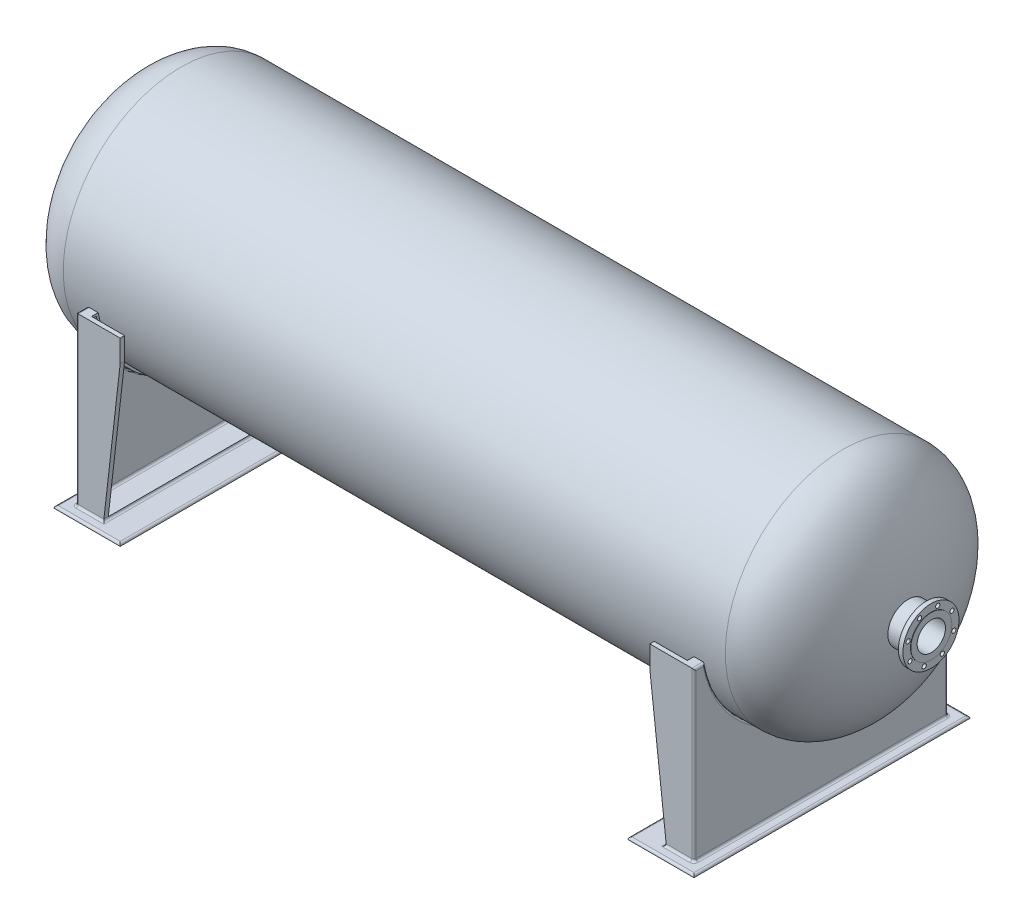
ISO-10303-21;
HEADER;
FILE_DESCRIPTION(('STEP AP214'),'2;1');
FILE_NAME('part.step','',(''),(''),'','','');
FILE_SCHEMA(('AUTOMOTIVE_DESIGN { 1 0 10303 214 1 1 1 1 }'));
ENDSEC;
DATA;
#1=APPLICATION_CONTEXT('core data for automotive mechanical design processes');
#2=APPLICATION_PROTOCOL_DEFINITION('international standard','automotive_design',2000,#1);
#3=PRODUCT_CONTEXT('',#1,'mechanical');
#4=PRODUCT('Part','Part','',(#3));
#5=PRODUCT_RELATED_PRODUCT_CATEGORY('part','',(#4));
#6=PRODUCT_DEFINITION_FORMATION('','',#4);
#7=PRODUCT_DEFINITION_CONTEXT('part definition',#1,'design');
#8=PRODUCT_DEFINITION('design','',#6,#7);
#9=PRODUCT_DEFINITION_SHAPE('','',#8);
#10=(LENGTH_UNIT() NAMED_UNIT(*) SI_UNIT(.MILLI.,.METRE.));
#11=(NAMED_UNIT(*) PLANE_ANGLE_UNIT() SI_UNIT($,.RADIAN.));
#12=(NAMED_UNIT(*) SI_UNIT($,.STERADIAN.) SOLID_ANGLE_UNIT());
#13=UNCERTAINTY_MEASURE_WITH_UNIT(LENGTH_MEASURE(1.E-05),#10,'distance_accuracy_value','');
#14=(GEOMETRIC_REPRESENTATION_CONTEXT(3) GLOBAL_UNCERTAINTY_ASSIGNED_CONTEXT((#13)) GLOBAL_UNIT_ASSIGNED_CONTEXT((#10,
#11,#12)) REPRESENTATION_CONTEXT('',''));
#15=CARTESIAN_POINT('',(0.,0.,0.));
#16=DIRECTION('',(0.,0.,1.));
#17=DIRECTION('',(1.,0.,0.));
#18=AXIS2_PLACEMENT_3D('',#15,#16,#17);
#19=CARTESIAN_POINT('',(1900.,0.,0.));
#20=DIRECTION('',(1.,0.,0.));
#21=DIRECTION('',(0.,-0.776568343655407,0.630033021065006));
#22=AXIS2_PLACEMENT_3D('',#19,#20,#21);
#23=CYLINDRICAL_SURFACE('',#22,64.0969);
#24=CARTESIAN_POINT('',(1900.,0.,0.));
#25=DIRECTION('',(1.,0.,0.));
#26=DIRECTION('',(0.,-0.776568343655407,0.630033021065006));
#27=AXIS2_PLACEMENT_3D('',#24,#25,#26);
#28=CIRCLE('',#27,64.0969);
#29=CARTESIAN_POINT('',(1900.,-49.7756234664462,40.3831635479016));
#30=VERTEX_POINT('',#29);
#31=EDGE_CURVE('E2321',#30,#30,#28,.T.);
#32=ORIENTED_EDGE('',*,*,#31,.T.);
#33=EDGE_LOOP('',(#32));
#34=FACE_BOUND('',#33,.T.);
#35=CARTESIAN_POINT('',(1797.63128214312,-8.49536126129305E-13,0.));
#36=DIRECTION('',(1.,0.,0.));
#37=DIRECTION('',(0.,1.,0.));
#38=AXIS2_PLACEMENT_3D('',#35,#36,#37);
#39=CIRCLE('',#38,64.0969000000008);
#40=CARTESIAN_POINT('',(1797.63128214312,64.0969,0.));
#41=VERTEX_POINT('',#40);
#42=EDGE_CURVE('E2273',#41,#41,#39,.F.);
#43=ORIENTED_EDGE('',*,*,#42,.T.);
#44=EDGE_LOOP('',(#43));
#45=FACE_BOUND('',#44,.T.);
#46=ADVANCED_FACE('F35',(#34,#45),#23,.F.);
#47=CARTESIAN_POINT('',(1900.,0.,0.));
#48=DIRECTION('',(1.,0.,0.));
#49=DIRECTION('',(0.,-0.776568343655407,0.630033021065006));
#50=AXIS2_PLACEMENT_3D('',#47,#48,#49);
#51=CYLINDRICAL_SURFACE('',#50,92.075);
#52=CARTESIAN_POINT('',(1871.425,0.,0.));
#53=DIRECTION('',(-1.,0.,0.));
#54=DIRECTION('',(0.,0.776568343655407,-0.630033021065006));
#55=AXIS2_PLACEMENT_3D('',#52,#53,#54);
#56=CIRCLE('',#55,92.075);
#57=CARTESIAN_POINT('',(1871.425,71.5025302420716,-58.0102904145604));
#58=VERTEX_POINT('',#57);
#59=EDGE_CURVE('E11',#58,#58,#56,.T.);
#60=ORIENTED_EDGE('',*,*,#59,.T.);
#61=EDGE_LOOP('',(#60));
#62=FACE_BOUND('',#61,.T.);
#63=CARTESIAN_POINT('',(1795.13086704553,-8.48523463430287E-13,0.));
#64=DIRECTION('',(1.,0.,0.));
#65=DIRECTION('',(0.,1.,0.));
#66=AXIS2_PLACEMENT_3D('',#63,#64,#65);
#67=CIRCLE('',#66,92.0750000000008);
#68=CARTESIAN_POINT('',(1795.13086704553,92.075,0.));
#69=VERTEX_POINT('',#68);
#70=EDGE_CURVE('E39',#69,#69,#67,.T.);
#71=ORIENTED_EDGE('',*,*,#70,.T.);
#72=EDGE_LOOP('',(#71));
#73=FACE_BOUND('',#72,.T.);
#74=ADVANCED_FACE('F483',(#62,#73),#51,.T.);
#75=CARTESIAN_POINT('',(1877.775,-80.0141936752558,-98.6241796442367));
#76=DIRECTION('',(-1.,0.,0.));
#77=DIRECTION('',(0.,0.776568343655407,-0.630033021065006));
#78=AXIS2_PLACEMENT_3D('',#75,#76,#77);
#79=PLANE('',#78);
#80=CARTESIAN_POINT('',(1877.775,-103.476422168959,30.7543908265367));
#81=DIRECTION('',(-1.,0.,0.));
#82=DIRECTION('',(0.,0.103616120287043,-0.994617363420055));
#83=AXIS2_PLACEMENT_3D('',#80,#81,#82);
#84=CIRCLE('',#83,9.525);
#85=CARTESIAN_POINT('',(1877.775,-94.3461496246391,28.0407681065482));
#86=VERTEX_POINT('',#85);
#87=EDGE_CURVE('E1096',#86,#86,#84,.F.);
#88=ORIENTED_EDGE('',*,*,#87,.T.);
#89=CARTESIAN_POINT('',(1877.775,0.,0.));
#90=DIRECTION('',(-1.,0.,0.));
#91=DIRECTION('',(0.,0.776568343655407,-0.630033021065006));
#92=AXIS2_PLACEMENT_3D('',#89,#90,#91);
#93=CIRCLE('',#92,98.425);
#94=CARTESIAN_POINT('',(1877.775,-86.5406194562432,-46.8849849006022));
#95=VERTEX_POINT('',#94);
#96=EDGE_CURVE('E45',#86,#95,#93,.F.);
#97=ORIENTED_EDGE('',*,*,#96,.T.);
#98=CARTESIAN_POINT('',(1877.775,-94.915518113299,-51.4222415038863));
#99=DIRECTION('',(-1.,0.,0.));
#100=DIRECTION('',(0.,0.776568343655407,-0.630033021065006));
#101=AXIS2_PLACEMENT_3D('',#98,#99,#100);
#102=CIRCLE('',#101,9.525);
#103=EDGE_CURVE('E2317',#95,#95,#102,.F.);
#104=ORIENTED_EDGE('',*,*,#103,.T.);
#105=CARTESIAN_POINT('',(1877.775,0.,0.));
#106=DIRECTION('',(-1.,0.,0.));
#107=DIRECTION('',(0.,0.776568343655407,-0.630033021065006));
#108=AXIS2_PLACEMENT_3D('',#105,#106,#107);
#109=CIRCLE('',#108,98.425);
#110=CARTESIAN_POINT('',(1877.775,-28.0407681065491,-94.3461496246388));
#111=VERTEX_POINT('',#110);
#112=EDGE_CURVE('E53',#95,#111,#109,.F.);
#113=ORIENTED_EDGE('',*,*,#112,.T.);
#114=CARTESIAN_POINT('',(1877.775,-30.7543908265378,-103.476422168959));
#115=DIRECTION('',(-1.,0.,0.));
#116=DIRECTION('',(0.,0.994617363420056,0.103616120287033));
#117=AXIS2_PLACEMENT_3D('',#114,#115,#116);
#118=CIRCLE('',#117,9.525);
#119=EDGE_CURVE('E2312',#111,#111,#118,.F.);
#120=ORIENTED_EDGE('',*,*,#119,.T.);
#121=CARTESIAN_POINT('',(1877.775,0.,0.));
#122=DIRECTION('',(-1.,0.,0.));
#123=DIRECTION('',(0.,0.776568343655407,-0.630033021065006));
#124=AXIS2_PLACEMENT_3D('',#121,#122,#123);
#125=CIRCLE('',#124,98.425);
#126=CARTESIAN_POINT('',(1877.775,46.8849849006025,-86.540619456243));
#127=VERTEX_POINT('',#126);
#128=EDGE_CURVE('E1123',#111,#127,#125,.F.);
#129=ORIENTED_EDGE('',*,*,#128,.T.);
#130=CARTESIAN_POINT('',(1877.775,51.4222415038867,-94.9155181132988));
#131=DIRECTION('',(-1.,0.,0.));
#132=DIRECTION('',(0.,0.630033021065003,0.776568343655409));
#133=AXIS2_PLACEMENT_3D('',#130,#131,#132);
#134=CIRCLE('',#133,9.525);
#135=EDGE_CURVE('E2306',#127,#127,#134,.F.);
#136=ORIENTED_EDGE('',*,*,#135,.T.);
#137=CARTESIAN_POINT('',(1877.775,0.,0.));
#138=DIRECTION('',(-1.,0.,0.));
#139=DIRECTION('',(0.,0.776568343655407,-0.630033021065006));
#140=AXIS2_PLACEMENT_3D('',#137,#138,#139);
#141=CIRCLE('',#140,98.425);
#142=CARTESIAN_POINT('',(1877.775,94.3461496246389,-28.0407681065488));
#143=VERTEX_POINT('',#142);
#144=EDGE_CURVE('E1121',#127,#143,#141,.F.);
#145=ORIENTED_EDGE('',*,*,#144,.T.);
#146=CARTESIAN_POINT('',(1877.775,103.476422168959,-30.7543908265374));
#147=DIRECTION('',(-1.,0.,0.));
#148=DIRECTION('',(0.,-0.103616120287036,0.994617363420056));
#149=AXIS2_PLACEMENT_3D('',#146,#147,#148);
#150=CIRCLE('',#149,9.525);
#151=EDGE_CURVE('E2300',#143,#143,#150,.F.);
#152=ORIENTED_EDGE('',*,*,#151,.T.);
#153=CARTESIAN_POINT('',(1877.775,0.,0.));
#154=DIRECTION('',(-1.,0.,0.));
#155=DIRECTION('',(0.,0.776568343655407,-0.630033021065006));
#156=AXIS2_PLACEMENT_3D('',#153,#154,#155);
#157=CIRCLE('',#156,98.425);
#158=CARTESIAN_POINT('',(1877.775,86.5406194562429,46.8849849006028));
#159=VERTEX_POINT('',#158);
#160=EDGE_CURVE('E1119',#143,#159,#157,.F.);
#161=ORIENTED_EDGE('',*,*,#160,.T.);
#162=CARTESIAN_POINT('',(1877.775,94.9155181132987,51.422241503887));
#163=DIRECTION('',(-1.,0.,0.));
#164=DIRECTION('',(0.,-0.776568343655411,0.630033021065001));
#165=AXIS2_PLACEMENT_3D('',#162,#163,#164);
#166=CIRCLE('',#165,9.525);
#167=EDGE_CURVE('E2294',#159,#159,#166,.F.);
#168=ORIENTED_EDGE('',*,*,#167,.T.);
#169=CARTESIAN_POINT('',(1877.775,0.,0.));
#170=DIRECTION('',(-1.,0.,0.));
#171=DIRECTION('',(0.,0.776568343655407,-0.630033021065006));
#172=AXIS2_PLACEMENT_3D('',#169,#170,#171);
#173=CIRCLE('',#172,98.425);
#174=CARTESIAN_POINT('',(1877.775,28.0407681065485,94.346149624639));
#175=VERTEX_POINT('',#174);
#176=EDGE_CURVE('E1117',#159,#175,#173,.F.);
#177=ORIENTED_EDGE('',*,*,#176,.T.);
#178=CARTESIAN_POINT('',(1877.775,30.7543908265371,103.476422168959));
#179=DIRECTION('',(-1.,0.,0.));
#180=DIRECTION('',(0.,-0.994617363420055,-0.103616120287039));
#181=AXIS2_PLACEMENT_3D('',#178,#179,#180);
#182=CIRCLE('',#181,9.525);
#183=EDGE_CURVE('E2288',#175,#175,#182,.F.);
#184=ORIENTED_EDGE('',*,*,#183,.T.);
#185=CARTESIAN_POINT('',(1877.775,0.,0.));
#186=DIRECTION('',(-1.,0.,0.));
#187=DIRECTION('',(0.,0.776568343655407,-0.630033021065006));
#188=AXIS2_PLACEMENT_3D('',#185,#186,#187);
#189=CIRCLE('',#188,98.425);
#190=CARTESIAN_POINT('',(1877.775,-46.8849849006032,86.5406194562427));
#191=VERTEX_POINT('',#190);
#192=EDGE_CURVE('E1115',#175,#191,#189,.F.);
#193=ORIENTED_EDGE('',*,*,#192,.T.);
#194=CARTESIAN_POINT('',(1877.775,-51.4222415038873,94.9155181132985));
#195=DIRECTION('',(-1.,0.,0.));
#196=DIRECTION('',(0.,-0.630033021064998,-0.776568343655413));
#197=AXIS2_PLACEMENT_3D('',#194,#195,#196);
#198=CIRCLE('',#197,9.525);
#199=EDGE_CURVE('E2282',#191,#191,#198,.F.);
#200=ORIENTED_EDGE('',*,*,#199,.T.);
#201=CARTESIAN_POINT('',(1877.775,0.,0.));
#202=DIRECTION('',(-1.,0.,0.));
#203=DIRECTION('',(0.,0.776568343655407,-0.630033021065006));
#204=AXIS2_PLACEMENT_3D('',#201,#202,#203);
#205=CIRCLE('',#204,98.425);
#206=EDGE_CURVE('E1113',#191,#86,#205,.F.);
#207=ORIENTED_EDGE('',*,*,#206,.T.);
#208=EDGE_LOOP('',(#88,#97,#104,#113,#120,#129,#136,#145,#152,#161,#168,#177,#184,#193,#200,#207));
#209=FACE_BOUND('',#208,.T.);
#210=CARTESIAN_POINT('',(1877.775,0.,0.));
#211=DIRECTION('',(1.,0.,0.));
#212=DIRECTION('',(0.,-0.776568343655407,0.630033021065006));
#213=AXIS2_PLACEMENT_3D('',#210,#211,#212);
#214=CIRCLE('',#213,127.);
#215=CARTESIAN_POINT('',(1877.775,-98.6241796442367,80.0141936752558));
#216=VERTEX_POINT('',#215);
#217=EDGE_CURVE('E1099',#216,#216,#214,.T.);
#218=ORIENTED_EDGE('',*,*,#217,.F.);
#219=EDGE_LOOP('',(#218));
#220=FACE_BOUND('',#219,.T.);
#221=ADVANCED_FACE('F489',(#209,#220),#79,.T.);
#222=CARTESIAN_POINT('',(1900.,0.,0.));
#223=DIRECTION('',(1.,0.,0.));
#224=DIRECTION('',(0.,-0.776568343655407,0.630033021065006));
#225=AXIS2_PLACEMENT_3D('',#222,#223,#224);
#226=CYLINDRICAL_SURFACE('',#225,127.);
#227=ORIENTED_EDGE('',*,*,#217,.T.);
#228=EDGE_LOOP('',(#227));
#229=FACE_BOUND('',#228,.T.);
#230=CARTESIAN_POINT('',(1898.4125,0.,0.));
#231=DIRECTION('',(1.,0.,0.));
#232=DIRECTION('',(0.,-0.776568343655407,0.630033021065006));
#233=AXIS2_PLACEMENT_3D('',#230,#231,#232);
#234=CIRCLE('',#233,127.);
#235=CARTESIAN_POINT('',(1898.4125,-98.6241796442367,80.0141936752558));
#236=VERTEX_POINT('',#235);
#237=EDGE_CURVE('E1101',#236,#236,#234,.T.);
#238=ORIENTED_EDGE('',*,*,#237,.F.);
#239=EDGE_LOOP('',(#238));
#240=FACE_BOUND('',#239,.T.);
#241=ADVANCED_FACE('F1085',(#229,#240),#226,.T.);
#242=CARTESIAN_POINT('',(1898.4125,-58.5103791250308,-72.1189313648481));
#243=DIRECTION('',(1.,0.,0.));
#244=DIRECTION('',(0.,-0.776568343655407,0.630033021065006));
#245=AXIS2_PLACEMENT_3D('',#242,#243,#244);
#246=PLANE('',#245);
#247=CARTESIAN_POINT('',(1898.4125,-103.476422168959,30.7543908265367));
#248=DIRECTION('',(1.,0.,0.));
#249=DIRECTION('',(0.,-0.103616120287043,0.994617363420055));
#250=AXIS2_PLACEMENT_3D('',#247,#248,#249);
#251=CIRCLE('',#250,9.525);
#252=CARTESIAN_POINT('',(1898.4125,-104.463365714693,40.2281212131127));
#253=VERTEX_POINT('',#252);
#254=EDGE_CURVE('E2276',#253,#253,#251,.T.);
#255=ORIENTED_EDGE('',*,*,#254,.F.);
#256=EDGE_LOOP('',(#255));
#257=FACE_BOUND('',#256,.T.);
#258=CARTESIAN_POINT('',(1898.4125,-51.4222415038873,94.9155181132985));
#259=DIRECTION('',(1.,0.,0.));
#260=DIRECTION('',(0.,0.630033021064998,0.776568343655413));
#261=AXIS2_PLACEMENT_3D('',#258,#259,#260);
#262=CIRCLE('',#261,9.525);
#263=CARTESIAN_POINT('',(1898.4125,-45.4211769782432,102.312331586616));
#264=VERTEX_POINT('',#263);
#265=EDGE_CURVE('E2285',#264,#264,#262,.T.);
#266=ORIENTED_EDGE('',*,*,#265,.F.);
#267=EDGE_LOOP('',(#266));
#268=FACE_BOUND('',#267,.T.);
#269=CARTESIAN_POINT('',(1898.4125,30.7543908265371,103.476422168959));
#270=DIRECTION('',(1.,0.,0.));
#271=DIRECTION('',(0.,0.994617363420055,0.103616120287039));
#272=AXIS2_PLACEMENT_3D('',#269,#270,#271);
#273=CIRCLE('',#272,9.525);
#274=CARTESIAN_POINT('',(1898.4125,40.2281212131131,104.463365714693));
#275=VERTEX_POINT('',#274);
#276=EDGE_CURVE('E2291',#275,#275,#273,.T.);
#277=ORIENTED_EDGE('',*,*,#276,.F.);
#278=EDGE_LOOP('',(#277));
#279=FACE_BOUND('',#278,.T.);
#280=CARTESIAN_POINT('',(1898.4125,94.9155181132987,51.422241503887));
#281=DIRECTION('',(1.,0.,0.));
#282=DIRECTION('',(0.,0.776568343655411,-0.630033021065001));
#283=AXIS2_PLACEMENT_3D('',#280,#281,#282);
#284=CIRCLE('',#283,9.525);
#285=CARTESIAN_POINT('',(1898.4125,102.312331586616,45.4211769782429));
#286=VERTEX_POINT('',#285);
#287=EDGE_CURVE('E2297',#286,#286,#284,.T.);
#288=ORIENTED_EDGE('',*,*,#287,.F.);
#289=EDGE_LOOP('',(#288));
#290=FACE_BOUND('',#289,.T.);
#291=CARTESIAN_POINT('',(1898.4125,103.476422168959,-30.7543908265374));
#292=DIRECTION('',(1.,0.,0.));
#293=DIRECTION('',(0.,0.103616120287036,-0.994617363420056));
#294=AXIS2_PLACEMENT_3D('',#291,#292,#293);
#295=CIRCLE('',#294,9.525);
#296=CARTESIAN_POINT('',(1898.4125,104.463365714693,-40.2281212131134));
#297=VERTEX_POINT('',#296);
#298=EDGE_CURVE('E2303',#297,#297,#295,.T.);
#299=ORIENTED_EDGE('',*,*,#298,.F.);
#300=EDGE_LOOP('',(#299));
#301=FACE_BOUND('',#300,.T.);
#302=CARTESIAN_POINT('',(1898.4125,51.4222415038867,-94.9155181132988));
#303=DIRECTION('',(1.,0.,0.));
#304=DIRECTION('',(0.,-0.630033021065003,-0.776568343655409));
#305=AXIS2_PLACEMENT_3D('',#302,#303,#304);
#306=CIRCLE('',#305,9.525);
#307=CARTESIAN_POINT('',(1898.4125,45.4211769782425,-102.312331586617));
#308=VERTEX_POINT('',#307);
#309=EDGE_CURVE('E2309',#308,#308,#306,.T.);
#310=ORIENTED_EDGE('',*,*,#309,.F.);
#311=EDGE_LOOP('',(#310));
#312=FACE_BOUND('',#311,.T.);
#313=CARTESIAN_POINT('',(1898.4125,-30.7543908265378,-103.476422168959));
#314=DIRECTION('',(1.,0.,0.));
#315=DIRECTION('',(0.,-0.994617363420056,-0.103616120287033));
#316=AXIS2_PLACEMENT_3D('',#313,#314,#315);
#317=CIRCLE('',#316,9.525);
#318=CARTESIAN_POINT('',(1898.4125,-40.2281212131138,-104.463365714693));
#319=VERTEX_POINT('',#318);
#320=EDGE_CURVE('E2314',#319,#319,#317,.T.);
#321=ORIENTED_EDGE('',*,*,#320,.F.);
#322=EDGE_LOOP('',(#321));
#323=FACE_BOUND('',#322,.T.);
#324=CARTESIAN_POINT('',(1898.4125,-94.915518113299,-51.4222415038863));
#325=DIRECTION('',(1.,0.,0.));
#326=DIRECTION('',(0.,-0.776568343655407,0.630033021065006));
#327=AXIS2_PLACEMENT_3D('',#324,#325,#326);
#328=CIRCLE('',#327,9.525);
#329=CARTESIAN_POINT('',(1898.4125,-102.312331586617,-45.4211769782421));
#330=VERTEX_POINT('',#329);
#331=EDGE_CURVE('E2318',#330,#330,#328,.T.);
#332=ORIENTED_EDGE('',*,*,#331,.F.);
#333=EDGE_LOOP('',(#332));
#334=FACE_BOUND('',#333,.T.);
#335=ORIENTED_EDGE('',*,*,#237,.T.);
#336=EDGE_LOOP('',(#335));
#337=FACE_BOUND('',#336,.T.);
#338=CARTESIAN_POINT('',(1898.4125,0.,0.));
#339=DIRECTION('',(1.,0.,0.));
#340=DIRECTION('',(0.,-0.776568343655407,0.630033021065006));
#341=AXIS2_PLACEMENT_3D('',#338,#339,#340);
#342=CIRCLE('',#341,92.86875);
#343=CARTESIAN_POINT('',(1898.4125,-72.1189313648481,58.5103791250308));
#344=VERTEX_POINT('',#343);
#345=EDGE_CURVE('E1107',#344,#344,#342,.T.);
#346=ORIENTED_EDGE('',*,*,#345,.F.);
#347=EDGE_LOOP('',(#346));
#348=FACE_BOUND('',#347,.T.);
#349=ADVANCED_FACE('F1081',(#257,#268,#279,#290,#301,#312,#323,#334,#337,#348),#246,.T.);
#350=CARTESIAN_POINT('',(1900.,0.,0.));
#351=DIRECTION('',(1.,0.,0.));
#352=DIRECTION('',(0.,-0.776568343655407,0.630033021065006));
#353=AXIS2_PLACEMENT_3D('',#350,#351,#352);
#354=CYLINDRICAL_SURFACE('',#353,92.86875);
#355=ORIENTED_EDGE('',*,*,#345,.T.);
#356=EDGE_LOOP('',(#355));
#357=FACE_BOUND('',#356,.T.);
#358=CARTESIAN_POINT('',(1900.,0.,0.));
#359=DIRECTION('',(1.,0.,0.));
#360=DIRECTION('',(0.,-0.776568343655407,0.630033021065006));
#361=AXIS2_PLACEMENT_3D('',#358,#359,#360);
#362=CIRCLE('',#361,92.86875);
#363=CARTESIAN_POINT('',(1900.,-72.1189313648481,58.5103791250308));
#364=VERTEX_POINT('',#363);
#365=EDGE_CURVE('E2324',#364,#364,#362,.T.);
#366=ORIENTED_EDGE('',*,*,#365,.F.);
#367=EDGE_LOOP('',(#366));
#368=FACE_BOUND('',#367,.T.);
#369=ADVANCED_FACE('F1077',(#357,#368),#354,.T.);
#370=CARTESIAN_POINT('',(1900.,-40.3831635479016,-49.7756234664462));
#371=DIRECTION('',(1.,0.,0.));
#372=DIRECTION('',(0.,-0.776568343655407,0.630033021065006));
#373=AXIS2_PLACEMENT_3D('',#370,#371,#372);
#374=PLANE('',#373);
#375=ORIENTED_EDGE('',*,*,#365,.T.);
#376=EDGE_LOOP('',(#375));
#377=FACE_BOUND('',#376,.T.);
#378=ORIENTED_EDGE('',*,*,#31,.F.);
#379=EDGE_LOOP('',(#378));
#380=FACE_BOUND('',#379,.T.);
#381=ADVANCED_FACE('F1073',(#377,#380),#374,.T.);
#382=CARTESIAN_POINT('',(1671.399,-94.915518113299,-51.4222415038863));
#383=DIRECTION('',(1.,0.,0.));
#384=DIRECTION('',(0.,-0.776568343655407,0.630033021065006));
#385=AXIS2_PLACEMENT_3D('',#382,#383,#384);
#386=CYLINDRICAL_SURFACE('',#385,9.525);
#387=ORIENTED_EDGE('',*,*,#103,.F.);
#388=EDGE_LOOP('',(#387));
#389=FACE_BOUND('',#388,.T.);
#390=ORIENTED_EDGE('',*,*,#331,.T.);
#391=EDGE_LOOP('',(#390));
#392=FACE_BOUND('',#391,.T.);
#393=ADVANCED_FACE('F1069',(#389,#392),#386,.F.);
#394=CARTESIAN_POINT('',(1671.399,-30.7543908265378,-103.476422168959));
#395=DIRECTION('',(1.,0.,0.));
#396=DIRECTION('',(0.,-0.994617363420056,-0.103616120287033));
#397=AXIS2_PLACEMENT_3D('',#394,#395,#396);
#398=CYLINDRICAL_SURFACE('',#397,9.525);
#399=ORIENTED_EDGE('',*,*,#119,.F.);
#400=EDGE_LOOP('',(#399));
#401=FACE_BOUND('',#400,.T.);
#402=ORIENTED_EDGE('',*,*,#320,.T.);
#403=EDGE_LOOP('',(#402));
#404=FACE_BOUND('',#403,.T.);
#405=ADVANCED_FACE('F1065',(#401,#404),#398,.F.);
#406=CARTESIAN_POINT('',(1671.399,51.4222415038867,-94.9155181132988));
#407=DIRECTION('',(1.,0.,0.));
#408=DIRECTION('',(0.,-0.630033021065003,-0.776568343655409));
#409=AXIS2_PLACEMENT_3D('',#406,#407,#408);
#410=CYLINDRICAL_SURFACE('',#409,9.525);
#411=ORIENTED_EDGE('',*,*,#135,.F.);
#412=EDGE_LOOP('',(#411));
#413=FACE_BOUND('',#412,.T.);
#414=ORIENTED_EDGE('',*,*,#309,.T.);
#415=EDGE_LOOP('',(#414));
#416=FACE_BOUND('',#415,.T.);
#417=ADVANCED_FACE('F1061',(#413,#416),#410,.F.);
#418=CARTESIAN_POINT('',(1671.399,103.476422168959,-30.7543908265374));
#419=DIRECTION('',(1.,0.,0.));
#420=DIRECTION('',(0.,0.103616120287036,-0.994617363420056));
#421=AXIS2_PLACEMENT_3D('',#418,#419,#420);
#422=CYLINDRICAL_SURFACE('',#421,9.525);
#423=ORIENTED_EDGE('',*,*,#151,.F.);
#424=EDGE_LOOP('',(#423));
#425=FACE_BOUND('',#424,.T.);
#426=ORIENTED_EDGE('',*,*,#298,.T.);
#427=EDGE_LOOP('',(#426));
#428=FACE_BOUND('',#427,.T.);
#429=ADVANCED_FACE('F1057',(#425,#428),#422,.F.);
#430=CARTESIAN_POINT('',(1671.399,94.9155181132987,51.422241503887));
#431=DIRECTION('',(1.,0.,0.));
#432=DIRECTION('',(0.,0.776568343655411,-0.630033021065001));
#433=AXIS2_PLACEMENT_3D('',#430,#431,#432);
#434=CYLINDRICAL_SURFACE('',#433,9.525);
#435=ORIENTED_EDGE('',*,*,#167,.F.);
#436=EDGE_LOOP('',(#435));
#437=FACE_BOUND('',#436,.T.);
#438=ORIENTED_EDGE('',*,*,#287,.T.);
#439=EDGE_LOOP('',(#438));
#440=FACE_BOUND('',#439,.T.);
#441=ADVANCED_FACE('F1053',(#437,#440),#434,.F.);
#442=CARTESIAN_POINT('',(1671.399,30.7543908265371,103.476422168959));
#443=DIRECTION('',(1.,0.,0.));
#444=DIRECTION('',(0.,0.994617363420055,0.103616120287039));
#445=AXIS2_PLACEMENT_3D('',#442,#443,#444);
#446=CYLINDRICAL_SURFACE('',#445,9.525);
#447=ORIENTED_EDGE('',*,*,#183,.F.);
#448=EDGE_LOOP('',(#447));
#449=FACE_BOUND('',#448,.T.);
#450=ORIENTED_EDGE('',*,*,#276,.T.);
#451=EDGE_LOOP('',(#450));
#452=FACE_BOUND('',#451,.T.);
#453=ADVANCED_FACE('F1049',(#449,#452),#446,.F.);
#454=CARTESIAN_POINT('',(1671.399,-51.4222415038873,94.9155181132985));
#455=DIRECTION('',(1.,0.,0.));
#456=DIRECTION('',(0.,0.630033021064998,0.776568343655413));
#457=AXIS2_PLACEMENT_3D('',#454,#455,#456);
#458=CYLINDRICAL_SURFACE('',#457,9.525);
#459=ORIENTED_EDGE('',*,*,#199,.F.);
#460=EDGE_LOOP('',(#459));
#461=FACE_BOUND('',#460,.T.);
#462=ORIENTED_EDGE('',*,*,#265,.T.);
#463=EDGE_LOOP('',(#462));
#464=FACE_BOUND('',#463,.T.);
#465=ADVANCED_FACE('F1045',(#461,#464),#458,.F.);
#466=CARTESIAN_POINT('',(1671.399,-103.476422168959,30.7543908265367));
#467=DIRECTION('',(1.,0.,0.));
#468=DIRECTION('',(0.,-0.103616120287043,0.994617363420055));
#469=AXIS2_PLACEMENT_3D('',#466,#467,#468);
#470=CYLINDRICAL_SURFACE('',#469,9.525);
#471=ORIENTED_EDGE('',*,*,#87,.F.);
#472=EDGE_LOOP('',(#471));
#473=FACE_BOUND('',#472,.T.);
#474=ORIENTED_EDGE('',*,*,#254,.T.);
#475=EDGE_LOOP('',(#474));
#476=FACE_BOUND('',#475,.T.);
#477=ADVANCED_FACE('F1042',(#473,#476),#470,.F.);
#478=CARTESIAN_POINT('',(1871.425,0.,0.));
#479=DIRECTION('',(-1.,0.,0.));
#480=DIRECTION('',(0.,0.776568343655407,-0.630033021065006));
#481=AXIS2_PLACEMENT_3D('',#478,#479,#480);
#482=TOROIDAL_SURFACE('',#481,98.425,6.35);
#483=ORIENTED_EDGE('',*,*,#59,.F.);
#484=EDGE_LOOP('',(#483));
#485=FACE_BOUND('',#484,.T.);
#486=ORIENTED_EDGE('',*,*,#112,.F.);
#487=ORIENTED_EDGE('',*,*,#96,.F.);
#488=ORIENTED_EDGE('',*,*,#206,.F.);
#489=ORIENTED_EDGE('',*,*,#192,.F.);
#490=ORIENTED_EDGE('',*,*,#176,.F.);
#491=ORIENTED_EDGE('',*,*,#160,.F.);
#492=ORIENTED_EDGE('',*,*,#144,.F.);
#493=ORIENTED_EDGE('',*,*,#128,.F.);
#494=EDGE_LOOP('',(#486,#487,#488,#489,#490,#491,#492,#493));
#495=FACE_BOUND('',#494,.T.);
#496=ADVANCED_FACE('F37',(#485,#495),#482,.F.);
#497=CARTESIAN_POINT('',(1500.,533.4,0.));
#498=CARTESIAN_POINT('',(1679.98017704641,533.4,0.));
#499=CARTESIAN_POINT('',(1800.,261.377129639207,0.));
#500=CARTESIAN_POINT('',(1800.,-8.50495451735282E-13,0.));
#501=B_SPLINE_CURVE_WITH_KNOTS('',3,(#497,#498,#499,#500),.UNSPECIFIED.,.F.,.F.,(4,4),(0.,1.),.UNSPECIFIED.);
#502=CARTESIAN_POINT('',(1800.,-8.50495451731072E-13,0.));
#503=DIRECTION('',(1.,0.,0.));
#504=AXIS1_PLACEMENT('',#502,#503);
#505=SURFACE_OF_REVOLUTION('',#501,#504);
#506=ORIENTED_EDGE('',*,*,#70,.F.);
#507=EDGE_LOOP('',(#506));
#508=FACE_BOUND('',#507,.T.);
#509=CARTESIAN_POINT('',(1500.,0.,0.));
#510=DIRECTION('',(1.,0.,0.));
#511=DIRECTION('',(0.,0.,-1.));
#512=AXIS2_PLACEMENT_3D('',#509,#510,#511);
#513=CIRCLE('',#512,533.4);
#514=CARTESIAN_POINT('',(1500.,0.,-533.4));
#515=VERTEX_POINT('',#514);
#516=EDGE_CURVE('E540',#515,#515,#513,.T.);
#517=ORIENTED_EDGE('',*,*,#516,.T.);
#518=EDGE_LOOP('',(#517));
#519=FACE_BOUND('',#518,.T.);
#520=ADVANCED_FACE('F466',(#508,#519),#505,.T.);
#521=CARTESIAN_POINT('',(-1500.,533.4,0.));
#522=CARTESIAN_POINT('',(-1679.98017704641,533.4,0.));
#523=CARTESIAN_POINT('',(-1800.,261.377129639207,0.));
#524=CARTESIAN_POINT('',(-1800.,-8.50495451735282E-13,0.));
#525=B_SPLINE_CURVE_WITH_KNOTS('',3,(#521,#522,#523,#524),.UNSPECIFIED.,.F.,.F.,(4,4),(0.,1.),.UNSPECIFIED.);
#526=CARTESIAN_POINT('',(-1800.,-8.50495451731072E-13,0.));
#527=DIRECTION('',(-1.,0.,0.));
#528=AXIS1_PLACEMENT('',#526,#527);
#529=SURFACE_OF_REVOLUTION('',#525,#528);
#530=CARTESIAN_POINT('',(-1800.,-8.50495451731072E-13,0.));
#531=VERTEX_POINT('',#530);
#532=VERTEX_LOOP('',#531);
#533=FACE_BOUND('',#532,.T.);
#534=CARTESIAN_POINT('',(-1500.,-7.28996101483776E-13,0.));
#535=DIRECTION('',(-1.,0.,0.));
#536=DIRECTION('',(0.,-1.,0.));
#537=AXIS2_PLACEMENT_3D('',#534,#535,#536);
#538=CIRCLE('',#537,533.400000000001);
#539=CARTESIAN_POINT('',(-1500.,-533.400000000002,0.));
#540=VERTEX_POINT('',#539);
#541=EDGE_CURVE('E531',#540,#540,#538,.T.);
#542=ORIENTED_EDGE('',*,*,#541,.T.);
#543=EDGE_LOOP('',(#542));
#544=FACE_BOUND('',#543,.T.);
#545=ADVANCED_FACE('F480',(#533,#544),#529,.T.);
#546=CARTESIAN_POINT('',(1500.,0.,0.));
#547=DIRECTION('',(-1.,0.,0.));
#548=DIRECTION('',(0.,0.,1.));
#549=AXIS2_PLACEMENT_3D('',#546,#547,#548);
#550=CYLINDRICAL_SURFACE('',#549,533.4);
#551=CARTESIAN_POINT('',(-1350.,0.,0.));
#552=DIRECTION('',(1.,0.,0.));
#553=DIRECTION('',(0.,0.,-1.));
#554=AXIS2_PLACEMENT_3D('',#551,#552,#553);
#555=CIRCLE('',#554,533.4);
#556=CARTESIAN_POINT('',(-1350.,-92.6239379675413,-525.296455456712));
#557=VERTEX_POINT('',#556);
#558=CARTESIAN_POINT('',(-1350.,-92.6239379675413,525.296455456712));
#559=VERTEX_POINT('',#558);
#560=EDGE_CURVE('E1309',#557,#559,#555,.F.);
#561=ORIENTED_EDGE('',*,*,#560,.F.);
#562=DIRECTION('',(-1.,0.,0.));
#563=VECTOR('',#562,1.);
#564=CARTESIAN_POINT('',(-1200.,-92.6239379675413,-525.296455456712));
#565=LINE('',#564,#563);
#566=CARTESIAN_POINT('',(-1390.,-92.6239379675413,-525.296455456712));
#567=VERTEX_POINT('',#566);
#568=EDGE_CURVE('E1241',#557,#567,#565,.T.);
#569=ORIENTED_EDGE('',*,*,#568,.T.);
#570=CARTESIAN_POINT('',(-1390.,0.,0.));
#571=DIRECTION('',(1.,0.,0.));
#572=DIRECTION('',(0.,0.,-1.));
#573=AXIS2_PLACEMENT_3D('',#570,#571,#572);
#574=CIRCLE('',#573,533.4);
#575=CARTESIAN_POINT('',(-1390.,-92.6239379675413,525.296455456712));
#576=VERTEX_POINT('',#575);
#577=EDGE_CURVE('E1203',#567,#576,#574,.F.);
#578=ORIENTED_EDGE('',*,*,#577,.T.);
#579=DIRECTION('',(-1.,0.,0.));
#580=VECTOR('',#579,1.);
#581=CARTESIAN_POINT('',(-1200.,-92.6239379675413,525.296455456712));
#582=LINE('',#581,#580);
#583=EDGE_CURVE('E1232',#559,#576,#582,.T.);
#584=ORIENTED_EDGE('',*,*,#583,.F.);
#585=EDGE_LOOP('',(#561,#569,#578,#584));
#586=FACE_BOUND('',#585,.T.);
#587=CARTESIAN_POINT('',(1350.,0.,0.));
#588=DIRECTION('',(-1.,0.,0.));
#589=DIRECTION('',(0.,0.,1.));
#590=AXIS2_PLACEMENT_3D('',#587,#588,#589);
#591=CIRCLE('',#590,533.4);
#592=CARTESIAN_POINT('',(1350.,-92.6239379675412,525.296455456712));
#593=VERTEX_POINT('',#592);
#594=CARTESIAN_POINT('',(1350.,-92.6239379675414,-525.296455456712));
#595=VERTEX_POINT('',#594);
#596=EDGE_CURVE('E559',#593,#595,#591,.F.);
#597=ORIENTED_EDGE('',*,*,#596,.F.);
#598=DIRECTION('',(1.,0.,0.));
#599=VECTOR('',#598,1.);
#600=CARTESIAN_POINT('',(1200.,-92.6239379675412,525.296455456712));
#601=LINE('',#600,#599);
#602=CARTESIAN_POINT('',(1390.,-92.6239379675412,525.296455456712));
#603=VERTEX_POINT('',#602);
#604=EDGE_CURVE('E627',#593,#603,#601,.T.);
#605=ORIENTED_EDGE('',*,*,#604,.T.);
#606=CARTESIAN_POINT('',(1390.,0.,0.));
#607=DIRECTION('',(-1.,0.,0.));
#608=DIRECTION('',(0.,0.,1.));
#609=AXIS2_PLACEMENT_3D('',#606,#607,#608);
#610=CIRCLE('',#609,533.4);
#611=CARTESIAN_POINT('',(1390.,-92.6239379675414,-525.296455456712));
#612=VERTEX_POINT('',#611);
#613=EDGE_CURVE('E665',#603,#612,#610,.F.);
#614=ORIENTED_EDGE('',*,*,#613,.T.);
#615=DIRECTION('',(1.,0.,0.));
#616=VECTOR('',#615,1.);
#617=CARTESIAN_POINT('',(1200.,-92.6239379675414,-525.296455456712));
#618=LINE('',#617,#616);
#619=EDGE_CURVE('E636',#595,#612,#618,.T.);
#620=ORIENTED_EDGE('',*,*,#619,.F.);
#621=EDGE_LOOP('',(#597,#605,#614,#620));
#622=FACE_BOUND('',#621,.T.);
#623=ORIENTED_EDGE('',*,*,#516,.F.);
#624=EDGE_LOOP('',(#623));
#625=FACE_BOUND('',#624,.T.);
#626=ORIENTED_EDGE('',*,*,#541,.F.);
#627=EDGE_LOOP('',(#626));
#628=FACE_BOUND('',#627,.T.);
#629=ADVANCED_FACE('F823',(#586,#622,#625,#628),#550,.T.);
#630=CARTESIAN_POINT('',(1370.,0.,0.));
#631=DIRECTION('',(-1.,0.,0.));
#632=DIRECTION('',(0.,0.,1.));
#633=AXIS2_PLACEMENT_3D('',#630,#631,#632);
#634=TOROIDAL_SURFACE('',#633,553.4,10.);
#635=CARTESIAN_POINT('',(1370.,-102.623937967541,-533.621483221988));
#636=CARTESIAN_POINT('',(1370.11810734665,-102.62393662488,-533.621482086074));
#637=CARTESIAN_POINT('',(1370.23619756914,-102.626030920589,-533.623212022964));
#638=CARTESIAN_POINT('',(1370.47212366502,-102.634391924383,-533.630118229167));
#639=CARTESIAN_POINT('',(1370.58995955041,-102.640658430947,-533.63529433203));
#640=CARTESIAN_POINT('',(1370.94257900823,-102.665674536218,-533.65595707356));
#641=CARTESIAN_POINT('',(1371.17666960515,-102.690640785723,-533.676578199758));
#642=CARTESIAN_POINT('',(1371.6393541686,-102.756477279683,-533.730951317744));
#643=CARTESIAN_POINT('',(1371.86797474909,-102.797237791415,-533.764612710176));
#644=CARTESIAN_POINT('',(1372.3197535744,-102.893978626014,-533.844494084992));
#645=CARTESIAN_POINT('',(1372.54291126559,-102.949960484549,-533.890715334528));
#646=CARTESIAN_POINT('',(1372.98176715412,-103.076106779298,-533.994850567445));
#647=CARTESIAN_POINT('',(1373.19748154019,-103.146237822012,-534.052737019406));
#648=CARTESIAN_POINT('',(1373.62090648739,-103.299787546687,-534.179452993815));
#649=CARTESIAN_POINT('',(1373.82861350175,-103.383212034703,-534.248287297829));
#650=CARTESIAN_POINT('',(1374.23526019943,-103.562370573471,-534.396079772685));
#651=CARTESIAN_POINT('',(1374.43418792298,-103.658120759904,-534.475051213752));
#652=CARTESIAN_POINT('',(1374.82230724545,-103.860759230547,-534.642138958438));
#653=CARTESIAN_POINT('',(1375.01149690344,-103.967649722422,-534.730257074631));
#654=CARTESIAN_POINT('',(1375.43909921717,-104.2276641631,-534.944548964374));
#655=CARTESIAN_POINT('',(1375.67367259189,-104.384569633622,-535.073821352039));
#656=CARTESIAN_POINT('',(1376.12415494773,-104.713654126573,-535.344841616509));
#657=CARTESIAN_POINT('',(1376.3400590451,-104.885837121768,-535.486592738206));
#658=CARTESIAN_POINT('',(1376.75311372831,-105.243545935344,-535.780953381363));
#659=CARTESIAN_POINT('',(1376.95024027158,-105.429088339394,-535.933576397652));
#660=CARTESIAN_POINT('',(1377.32536680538,-105.811395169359,-536.247910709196));
#661=CARTESIAN_POINT('',(1377.50336621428,-106.008159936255,-536.409622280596));
#662=CARTESIAN_POINT('',(1377.88668665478,-106.466639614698,-536.78624576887));
#663=CARTESIAN_POINT('',(1378.08607715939,-106.731346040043,-537.003567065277));
#664=CARTESIAN_POINT('',(1378.45445015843,-107.273267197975,-537.448195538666));
#665=CARTESIAN_POINT('',(1378.62342349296,-107.550485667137,-537.675505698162));
#666=CARTESIAN_POINT('',(1378.93153934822,-108.114943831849,-538.138038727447));
#667=CARTESIAN_POINT('',(1379.07066789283,-108.402188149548,-538.373265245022));
#668=CARTESIAN_POINT('',(1379.31948433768,-108.984243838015,-538.849594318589));
#669=CARTESIAN_POINT('',(1379.42917788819,-109.279053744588,-539.090695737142));
#670=CARTESIAN_POINT('',(1379.68285345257,-110.071931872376,-539.738682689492));
#671=CARTESIAN_POINT('',(1379.80132486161,-110.57512721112,-540.149466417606));
#672=CARTESIAN_POINT('',(1379.95941094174,-111.588381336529,-540.975675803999));
#673=CARTESIAN_POINT('',(1379.99918843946,-112.098423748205,-541.391090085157));
#674=CARTESIAN_POINT('',(1379.99999590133,-112.613485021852,-541.810108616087));
#675=CARTESIAN_POINT('',(1379.99999999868,-112.618711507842,-541.81436047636));
#676=CARTESIAN_POINT('',(1380.,-112.623937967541,-541.81861226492));
#677=B_SPLINE_CURVE_WITH_KNOTS('',3,(#635,#636,#637,#638,#639,#640,#641,#642,#643,#644,#645,
#646,#647,#648,#649,#650,#651,#652,#653,#654,#655,#656,#657,#658,#659,#660,#661,#662,#663,#664,
#665,#666,#667,#668,#669,#670,#671,#672,#673,#674,#675,#676),.UNSPECIFIED.,.F.,.F.,(4,2,2,2,2,2,
2,2,2,2,2,2,2,2,2,2,2,2,2,2,4),(0.,0.354256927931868,0.708496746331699,1.41639293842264,
2.11945664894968,2.82259131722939,3.52408553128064,4.22588697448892,4.92861667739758,
5.63148590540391,6.56138518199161,7.49152698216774,8.42284415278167,9.35418963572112,
10.5414275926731,11.7290224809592,12.9171723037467,14.1050938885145,16.0808849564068,
18.0525835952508,18.0727962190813),.UNSPECIFIED.);
#678=CARTESIAN_POINT('',(1370.,-102.623937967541,-533.621483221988));
#679=VERTEX_POINT('',#678);
#680=CARTESIAN_POINT('',(1380.,-112.623937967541,-541.81861226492));
#681=VERTEX_POINT('',#680);
#682=EDGE_CURVE('E834',#679,#681,#677,.T.);
#683=ORIENTED_EDGE('',*,*,#682,.T.);
#684=CARTESIAN_POINT('',(1380.,0.,0.));
#685=DIRECTION('',(-1.,0.,0.));
#686=DIRECTION('',(0.,0.,1.));
#687=AXIS2_PLACEMENT_3D('',#684,#685,#686);
#688=CIRCLE('',#687,553.4);
#689=CARTESIAN_POINT('',(1380.,-112.623937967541,541.81861226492));
#690=VERTEX_POINT('',#689);
#691=EDGE_CURVE('E709',#690,#681,#688,.F.);
#692=ORIENTED_EDGE('',*,*,#691,.F.);
#693=CARTESIAN_POINT('',(1370.,-102.623937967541,533.621483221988));
#694=CARTESIAN_POINT('',(1370.11810734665,-102.623936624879,533.621482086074));
#695=CARTESIAN_POINT('',(1370.23619756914,-102.626030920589,533.623212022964));
#696=CARTESIAN_POINT('',(1370.47212366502,-102.634391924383,533.630118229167));
#697=CARTESIAN_POINT('',(1370.58995955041,-102.640658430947,533.63529433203));
#698=CARTESIAN_POINT('',(1370.94257900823,-102.665674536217,533.65595707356));
#699=CARTESIAN_POINT('',(1371.17666960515,-102.690640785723,533.676578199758));
#700=CARTESIAN_POINT('',(1371.6393541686,-102.756477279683,533.730951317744));
#701=CARTESIAN_POINT('',(1371.86797474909,-102.797237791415,533.764612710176));
#702=CARTESIAN_POINT('',(1372.3197535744,-102.893978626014,533.844494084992));
#703=CARTESIAN_POINT('',(1372.54291126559,-102.949960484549,533.890715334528));
#704=CARTESIAN_POINT('',(1372.98176715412,-103.076106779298,533.994850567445));
#705=CARTESIAN_POINT('',(1373.19748154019,-103.146237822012,534.052737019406));
#706=CARTESIAN_POINT('',(1373.62090648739,-103.299787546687,534.179452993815));
#707=CARTESIAN_POINT('',(1373.82861350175,-103.383212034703,534.248287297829));
#708=CARTESIAN_POINT('',(1374.23526019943,-103.562370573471,534.396079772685));
#709=CARTESIAN_POINT('',(1374.43418792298,-103.658120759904,534.475051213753));
#710=CARTESIAN_POINT('',(1374.82230724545,-103.860759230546,534.642138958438));
#711=CARTESIAN_POINT('',(1375.01149690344,-103.967649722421,534.730257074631));
#712=CARTESIAN_POINT('',(1375.43909921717,-104.227664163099,534.944548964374));
#713=CARTESIAN_POINT('',(1375.67367259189,-104.384569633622,535.073821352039));
#714=CARTESIAN_POINT('',(1376.12415494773,-104.713654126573,535.344841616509));
#715=CARTESIAN_POINT('',(1376.3400590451,-104.885837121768,535.486592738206));
#716=CARTESIAN_POINT('',(1376.75311372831,-105.243545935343,535.780953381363));
#717=CARTESIAN_POINT('',(1376.95024027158,-105.429088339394,535.933576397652));
#718=CARTESIAN_POINT('',(1377.32536680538,-105.811395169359,536.247910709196));
#719=CARTESIAN_POINT('',(1377.50336621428,-106.008159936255,536.409622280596));
#720=CARTESIAN_POINT('',(1377.88668665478,-106.466639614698,536.78624576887));
#721=CARTESIAN_POINT('',(1378.08607715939,-106.731346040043,537.003567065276));
#722=CARTESIAN_POINT('',(1378.45445015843,-107.273267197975,537.448195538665));
#723=CARTESIAN_POINT('',(1378.62342349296,-107.550485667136,537.675505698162));
#724=CARTESIAN_POINT('',(1378.93153934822,-108.114943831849,538.138038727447));
#725=CARTESIAN_POINT('',(1379.07066789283,-108.402188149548,538.373265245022));
#726=CARTESIAN_POINT('',(1379.31948433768,-108.984243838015,538.849594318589));
#727=CARTESIAN_POINT('',(1379.42917788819,-109.279053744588,539.090695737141));
#728=CARTESIAN_POINT('',(1379.68285345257,-110.071931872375,539.738682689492));
#729=CARTESIAN_POINT('',(1379.80132486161,-110.57512721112,540.149466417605));
#730=CARTESIAN_POINT('',(1379.95941094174,-111.588381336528,540.975675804));
#731=CARTESIAN_POINT('',(1379.99918843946,-112.098423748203,541.391090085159));
#732=CARTESIAN_POINT('',(1379.99999590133,-112.613485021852,541.810108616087));
#733=CARTESIAN_POINT('',(1379.99999999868,-112.618711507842,541.814360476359));
#734=CARTESIAN_POINT('',(1380.,-112.623937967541,541.81861226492));
#735=B_SPLINE_CURVE_WITH_KNOTS('',3,(#693,#694,#695,#696,#697,#698,#699,#700,#701,#702,#703,
#704,#705,#706,#707,#708,#709,#710,#711,#712,#713,#714,#715,#716,#717,#718,#719,#720,#721,#722,
#723,#724,#725,#726,#727,#728,#729,#730,#731,#732,#733,#734),.UNSPECIFIED.,.F.,.F.,(4,2,2,2,2,2,
2,2,2,2,2,2,2,2,2,2,2,2,2,2,4),(0.,0.354256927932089,0.708496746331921,1.41639293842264,
2.11945664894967,2.82259131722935,3.52408553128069,4.22588697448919,4.92861667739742,
5.63148590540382,6.5613851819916,7.49152698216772,8.4228441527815,9.35418963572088,
10.5414275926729,11.7290224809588,12.9171723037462,14.1050938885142,16.0808849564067,
18.0525835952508,18.0727962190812),.UNSPECIFIED.);
#736=CARTESIAN_POINT('',(1370.,-102.623937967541,533.621483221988));
#737=VERTEX_POINT('',#736);
#738=EDGE_CURVE('E543',#690,#737,#735,.F.);
#739=ORIENTED_EDGE('',*,*,#738,.T.);
#740=CARTESIAN_POINT('',(1370.,0.,0.));
#741=DIRECTION('',(-1.,0.,0.));
#742=DIRECTION('',(0.,0.,1.));
#743=AXIS2_PLACEMENT_3D('',#740,#741,#742);
#744=CIRCLE('',#743,543.4);
#745=EDGE_CURVE('E696',#679,#737,#744,.T.);
#746=ORIENTED_EDGE('',*,*,#745,.F.);
#747=EDGE_LOOP('',(#683,#692,#739,#746));
#748=FACE_BOUND('',#747,.T.);
#749=ADVANCED_FACE('F818',(#748),#634,.F.);
#750=CARTESIAN_POINT('',(1370.,-112.623937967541,1399.70709041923));
#751=DIRECTION('',(0.,0.,1.));
#752=DIRECTION('',(1.,0.,0.));
#753=AXIS2_PLACEMENT_3D('',#750,#751,#752);
#754=CYLINDRICAL_SURFACE('',#753,10.);
#755=CARTESIAN_POINT('',(1370.,-112.623937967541,545.296455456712));
#756=DIRECTION('',(0.,-0.707106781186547,0.707106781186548));
#757=DIRECTION('',(0.,0.707106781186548,0.707106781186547));
#758=AXIS2_PLACEMENT_3D('',#755,#756,#757);
#759=ELLIPSE('',#758,14.142135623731,10.);
#760=CARTESIAN_POINT('',(1380.,-112.623937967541,545.296455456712));
#761=VERTEX_POINT('',#760);
#762=CARTESIAN_POINT('',(1370.,-102.623937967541,555.296455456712));
#763=VERTEX_POINT('',#762);
#764=EDGE_CURVE('E839',#761,#763,#759,.T.);
#765=ORIENTED_EDGE('',*,*,#764,.T.);
#766=DIRECTION('',(0.,0.,-1.));
#767=VECTOR('',#766,1.);
#768=CARTESIAN_POINT('',(1370.,-102.623937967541,555.296455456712));
#769=LINE('',#768,#767);
#770=EDGE_CURVE('E712',#737,#763,#769,.F.);
#771=ORIENTED_EDGE('',*,*,#770,.F.);
#772=ORIENTED_EDGE('',*,*,#738,.F.);
#773=DIRECTION('',(0.,0.,-1.));
#774=VECTOR('',#773,1.);
#775=CARTESIAN_POINT('',(1380.,-112.623937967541,533.621483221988));
#776=LINE('',#775,#774);
#777=EDGE_CURVE('E707',#761,#690,#776,.T.);
#778=ORIENTED_EDGE('',*,*,#777,.F.);
#779=EDGE_LOOP('',(#765,#771,#772,#778));
#780=FACE_BOUND('',#779,.T.);
#781=ADVANCED_FACE('F822',(#780),#754,.F.);
#782=CARTESIAN_POINT('',(1370.,-112.623937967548,1399.70709041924));
#783=DIRECTION('',(0.,0.,1.));
#784=DIRECTION('',(0.,1.,0.));
#785=AXIS2_PLACEMENT_3D('',#782,#783,#784);
#786=CYLINDRICAL_SURFACE('',#785,10.);
#787=CARTESIAN_POINT('',(1370.,-112.623937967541,-545.296455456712));
#788=DIRECTION('',(0.,0.707106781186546,0.707106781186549));
#789=DIRECTION('',(0.,0.707106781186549,-0.707106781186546));
#790=AXIS2_PLACEMENT_3D('',#787,#788,#789);
#791=ELLIPSE('',#790,14.142135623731,10.);
#792=CARTESIAN_POINT('',(1370.,-102.623937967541,-555.296455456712));
#793=VERTEX_POINT('',#792);
#794=CARTESIAN_POINT('',(1380.,-112.623937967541,-545.296455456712));
#795=VERTEX_POINT('',#794);
#796=EDGE_CURVE('E1332',#793,#795,#791,.F.);
#797=ORIENTED_EDGE('',*,*,#796,.T.);
#798=DIRECTION('',(0.,0.,-1.));
#799=VECTOR('',#798,1.);
#800=CARTESIAN_POINT('',(1380.,-112.623937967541,-555.296455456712));
#801=LINE('',#800,#799);
#802=EDGE_CURVE('E699',#681,#795,#801,.T.);
#803=ORIENTED_EDGE('',*,*,#802,.F.);
#804=ORIENTED_EDGE('',*,*,#682,.F.);
#805=DIRECTION('',(0.,0.,-1.));
#806=VECTOR('',#805,1.);
#807=CARTESIAN_POINT('',(1370.,-102.623937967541,-533.621483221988));
#808=LINE('',#807,#806);
#809=EDGE_CURVE('E720',#793,#679,#808,.F.);
#810=ORIENTED_EDGE('',*,*,#809,.F.);
#811=EDGE_LOOP('',(#797,#803,#804,#810));
#812=FACE_BOUND('',#811,.T.);
#813=ADVANCED_FACE('F841',(#812),#786,.F.);
#814=CARTESIAN_POINT('',(1370.,-158.3,545.296455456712));
#815=DIRECTION('',(0.,-1.,0.));
#816=DIRECTION('',(0.,0.,1.));
#817=AXIS2_PLACEMENT_3D('',#814,#815,#816);
#818=CYLINDRICAL_SURFACE('',#817,10.);
#819=CARTESIAN_POINT('',(1370.,-830.,545.296455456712));
#820=DIRECTION('',(0.,-0.707106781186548,-0.707106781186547));
#821=DIRECTION('',(0.,-0.707106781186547,0.707106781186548));
#822=AXIS2_PLACEMENT_3D('',#819,#820,#821);
#823=ELLIPSE('',#822,14.1421356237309,10.);
#824=CARTESIAN_POINT('',(1380.,-830.,545.296455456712));
#825=VERTEX_POINT('',#824);
#826=CARTESIAN_POINT('',(1370.,-840.,555.296455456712));
#827=VERTEX_POINT('',#826);
#828=EDGE_CURVE('E1330',#825,#827,#823,.T.);
#829=ORIENTED_EDGE('',*,*,#828,.T.);
#830=DIRECTION('',(0.,1.,0.));
#831=VECTOR('',#830,1.);
#832=CARTESIAN_POINT('',(1370.,-840.,555.296455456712));
#833=LINE('',#832,#831);
#834=EDGE_CURVE('E714',#763,#827,#833,.F.);
#835=ORIENTED_EDGE('',*,*,#834,.F.);
#836=ORIENTED_EDGE('',*,*,#764,.F.);
#837=DIRECTION('',(0.,1.,0.));
#838=VECTOR('',#837,1.);
#839=CARTESIAN_POINT('',(1380.,-102.623937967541,545.296455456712));
#840=LINE('',#839,#838);
#841=EDGE_CURVE('E705',#825,#761,#840,.T.);
#842=ORIENTED_EDGE('',*,*,#841,.F.);
#843=EDGE_LOOP('',(#829,#835,#836,#842));
#844=FACE_BOUND('',#843,.T.);
#845=ADVANCED_FACE('F845',(#844),#818,.F.);
#846=CARTESIAN_POINT('',(1370.,-158.3,-545.296455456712));
#847=DIRECTION('',(0.,1.,0.));
#848=DIRECTION('',(0.,0.,-1.));
#849=AXIS2_PLACEMENT_3D('',#846,#847,#848);
#850=CYLINDRICAL_SURFACE('',#849,10.);
#851=CARTESIAN_POINT('',(1370.,-830.,-545.296455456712));
#852=DIRECTION('',(0.,0.707106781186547,-0.707106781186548));
#853=DIRECTION('',(0.,-0.707106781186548,-0.707106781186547));
#854=AXIS2_PLACEMENT_3D('',#851,#852,#853);
#855=ELLIPSE('',#854,14.1421356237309,10.);
#856=CARTESIAN_POINT('',(1370.,-840.,-555.296455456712));
#857=VERTEX_POINT('',#856);
#858=CARTESIAN_POINT('',(1380.,-830.,-545.296455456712));
#859=VERTEX_POINT('',#858);
#860=EDGE_CURVE('E1326',#857,#859,#855,.F.);
#861=ORIENTED_EDGE('',*,*,#860,.T.);
#862=DIRECTION('',(0.,-1.,0.));
#863=VECTOR('',#862,1.);
#864=CARTESIAN_POINT('',(1380.,-840.,-545.296455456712));
#865=LINE('',#864,#863);
#866=EDGE_CURVE('E701',#795,#859,#865,.T.);
#867=ORIENTED_EDGE('',*,*,#866,.F.);
#868=ORIENTED_EDGE('',*,*,#796,.F.);
#869=DIRECTION('',(0.,-1.,0.));
#870=VECTOR('',#869,1.);
#871=CARTESIAN_POINT('',(1370.,-102.623937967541,-555.296455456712));
#872=LINE('',#871,#870);
#873=EDGE_CURVE('E718',#857,#793,#872,.F.);
#874=ORIENTED_EDGE('',*,*,#873,.F.);
#875=EDGE_LOOP('',(#861,#867,#868,#874));
#876=FACE_BOUND('',#875,.T.);
#877=ADVANCED_FACE('F849',(#876),#850,.F.);
#878=CARTESIAN_POINT('',(1370.,-830.,-625.296455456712));
#879=DIRECTION('',(0.,0.,-1.));
#880=DIRECTION('',(-1.,0.,0.));
#881=AXIS2_PLACEMENT_3D('',#878,#879,#880);
#882=CYLINDRICAL_SURFACE('',#881,10.);
#883=ORIENTED_EDGE('',*,*,#828,.F.);
#884=DIRECTION('',(0.,0.,-1.));
#885=VECTOR('',#884,1.);
#886=CARTESIAN_POINT('',(1380.,-830.,1399.70709041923));
#887=LINE('',#886,#885);
#888=EDGE_CURVE('E703',#859,#825,#887,.F.);
#889=ORIENTED_EDGE('',*,*,#888,.F.);
#890=ORIENTED_EDGE('',*,*,#860,.F.);
#891=DIRECTION('',(0.,0.,-1.));
#892=VECTOR('',#891,1.);
#893=CARTESIAN_POINT('',(1370.,-840.,-625.296455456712));
#894=LINE('',#893,#892);
#895=EDGE_CURVE('E716',#827,#857,#894,.T.);
#896=ORIENTED_EDGE('',*,*,#895,.F.);
#897=EDGE_LOOP('',(#883,#889,#890,#896));
#898=FACE_BOUND('',#897,.T.);
#899=ADVANCED_FACE('F805',(#898),#882,.F.);
#900=CARTESIAN_POINT('',(1450.,-860.,615.296455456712));
#901=DIRECTION('',(-1.,0.,0.));
#902=DIRECTION('',(0.,0.,1.));
#903=AXIS2_PLACEMENT_3D('',#900,#901,#902);
#904=CYLINDRICAL_SURFACE('',#903,10.);
#905=CARTESIAN_POINT('',(1440.,-860.,615.296455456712));
#906=DIRECTION('',(-0.707106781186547,0.,0.707106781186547));
#907=DIRECTION('',(0.707106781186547,0.,0.707106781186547));
#908=AXIS2_PLACEMENT_3D('',#905,#906,#907);
#909=ELLIPSE('',#908,14.1421356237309,10.);
#910=CARTESIAN_POINT('',(1450.,-860.,625.296455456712));
#911=VERTEX_POINT('',#910);
#912=CARTESIAN_POINT('',(1440.,-850.,615.296455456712));
#913=VERTEX_POINT('',#912);
#914=EDGE_CURVE('E1478',#911,#913,#909,.T.);
#915=ORIENTED_EDGE('',*,*,#914,.T.);
#916=DIRECTION('',(-1.,0.,0.));
#917=VECTOR('',#916,1.);
#918=CARTESIAN_POINT('',(1450.,-850.,615.296455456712));
#919=LINE('',#918,#917);
#920=CARTESIAN_POINT('',(1160.,-850.,615.296455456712));
#921=VERTEX_POINT('',#920);
#922=EDGE_CURVE('E689',#921,#913,#919,.F.);
#923=ORIENTED_EDGE('',*,*,#922,.F.);
#924=CARTESIAN_POINT('',(1160.,-860.,615.296455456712));
#925=DIRECTION('',(-0.707106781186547,0.,-0.707106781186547));
#926=DIRECTION('',(0.707106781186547,0.,-0.707106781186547));
#927=AXIS2_PLACEMENT_3D('',#924,#925,#926);
#928=ELLIPSE('',#927,14.1421356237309,10.);
#929=CARTESIAN_POINT('',(1150.,-860.,625.296455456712));
#930=VERTEX_POINT('',#929);
#931=EDGE_CURVE('E1329',#921,#930,#928,.F.);
#932=ORIENTED_EDGE('',*,*,#931,.T.);
#933=DIRECTION('',(-1.,0.,0.));
#934=VECTOR('',#933,1.);
#935=CARTESIAN_POINT('',(1450.,-860.,625.296455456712));
#936=LINE('',#935,#934);
#937=EDGE_CURVE('E612',#911,#930,#936,.T.);
#938=ORIENTED_EDGE('',*,*,#937,.F.);
#939=EDGE_LOOP('',(#915,#923,#932,#938));
#940=FACE_BOUND('',#939,.T.);
#941=ADVANCED_FACE('F801',(#940),#904,.T.);
#942=CARTESIAN_POINT('',(1160.,-860.,625.296455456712));
#943=DIRECTION('',(0.,0.,-1.));
#944=DIRECTION('',(-1.,0.,0.));
#945=AXIS2_PLACEMENT_3D('',#942,#943,#944);
#946=CYLINDRICAL_SURFACE('',#945,10.);
#947=CARTESIAN_POINT('',(1160.,-860.,-615.296455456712));
#948=DIRECTION('',(0.707106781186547,0.,-0.707106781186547));
#949=DIRECTION('',(0.707106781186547,0.,0.707106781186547));
#950=AXIS2_PLACEMENT_3D('',#947,#948,#949);
#951=ELLIPSE('',#950,14.1421356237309,10.);
#952=CARTESIAN_POINT('',(1160.,-850.,-615.296455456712));
#953=VERTEX_POINT('',#952);
#954=CARTESIAN_POINT('',(1150.,-860.,-625.296455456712));
#955=VERTEX_POINT('',#954);
#956=EDGE_CURVE('E1480',#953,#955,#951,.F.);
#957=ORIENTED_EDGE('',*,*,#956,.T.);
#958=DIRECTION('',(0.,0.,-1.));
#959=VECTOR('',#958,1.);
#960=CARTESIAN_POINT('',(1150.,-860.,625.296455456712));
#961=LINE('',#960,#959);
#962=EDGE_CURVE('E615',#930,#955,#961,.T.);
#963=ORIENTED_EDGE('',*,*,#962,.F.);
#964=ORIENTED_EDGE('',*,*,#931,.F.);
#965=DIRECTION('',(0.,0.,-1.));
#966=VECTOR('',#965,1.);
#967=CARTESIAN_POINT('',(1160.,-850.,-625.296455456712));
#968=LINE('',#967,#966);
#969=EDGE_CURVE('E687',#953,#921,#968,.F.);
#970=ORIENTED_EDGE('',*,*,#969,.F.);
#971=EDGE_LOOP('',(#957,#963,#964,#970));
#972=FACE_BOUND('',#971,.T.);
#973=ADVANCED_FACE('F804',(#972),#946,.T.);
#974=CARTESIAN_POINT('',(1440.,-860.,-625.296455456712));
#975=DIRECTION('',(0.,0.,1.));
#976=DIRECTION('',(1.,0.,0.));
#977=AXIS2_PLACEMENT_3D('',#974,#975,#976);
#978=CYLINDRICAL_SURFACE('',#977,10.);
#979=CARTESIAN_POINT('',(1440.,-860.,-615.296455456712));
#980=DIRECTION('',(0.707106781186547,0.,0.707106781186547));
#981=DIRECTION('',(-0.707106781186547,0.,0.707106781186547));
#982=AXIS2_PLACEMENT_3D('',#979,#980,#981);
#983=ELLIPSE('',#982,14.1421356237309,10.);
#984=CARTESIAN_POINT('',(1450.,-860.,-625.296455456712));
#985=VERTEX_POINT('',#984);
#986=CARTESIAN_POINT('',(1440.,-850.,-615.296455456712));
#987=VERTEX_POINT('',#986);
#988=EDGE_CURVE('E739',#985,#987,#983,.T.);
#989=ORIENTED_EDGE('',*,*,#988,.T.);
#990=DIRECTION('',(0.,0.,1.));
#991=VECTOR('',#990,1.);
#992=CARTESIAN_POINT('',(1440.,-850.,-625.296455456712));
#993=LINE('',#992,#991);
#994=EDGE_CURVE('E683',#913,#987,#993,.F.);
#995=ORIENTED_EDGE('',*,*,#994,.F.);
#996=ORIENTED_EDGE('',*,*,#914,.F.);
#997=DIRECTION('',(0.,0.,1.));
#998=VECTOR('',#997,1.);
#999=CARTESIAN_POINT('',(1450.,-860.,-625.296455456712));
#1000=LINE('',#999,#998);
#1001=EDGE_CURVE('E610',#985,#911,#1000,.T.);
#1002=ORIENTED_EDGE('',*,*,#1001,.F.);
#1003=EDGE_LOOP('',(#989,#995,#996,#1002));
#1004=FACE_BOUND('',#1003,.T.);
#1005=ADVANCED_FACE('F809',(#1004),#978,.T.);
#1006=CARTESIAN_POINT('',(1150.,-860.,-615.296455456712));
#1007=DIRECTION('',(1.,0.,0.));
#1008=DIRECTION('',(0.,0.,-1.));
#1009=AXIS2_PLACEMENT_3D('',#1006,#1007,#1008);
#1010=CYLINDRICAL_SURFACE('',#1009,10.);
#1011=ORIENTED_EDGE('',*,*,#956,.F.);
#1012=DIRECTION('',(1.,0.,0.));
#1013=VECTOR('',#1012,1.);
#1014=CARTESIAN_POINT('',(1450.,-850.,-615.296455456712));
#1015=LINE('',#1014,#1013);
#1016=EDGE_CURVE('E685',#987,#953,#1015,.F.);
#1017=ORIENTED_EDGE('',*,*,#1016,.F.);
#1018=ORIENTED_EDGE('',*,*,#988,.F.);
#1019=DIRECTION('',(1.,0.,0.));
#1020=VECTOR('',#1019,1.);
#1021=CARTESIAN_POINT('',(1150.,-860.,-625.296455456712));
#1022=LINE('',#1021,#1020);
#1023=EDGE_CURVE('E608',#955,#985,#1022,.T.);
#1024=ORIENTED_EDGE('',*,*,#1023,.F.);
#1025=EDGE_LOOP('',(#1011,#1017,#1018,#1024));
#1026=FACE_BOUND('',#1025,.T.);
#1027=ADVANCED_FACE('F813',(#1026),#1010,.T.);
#1028=CARTESIAN_POINT('',(1390.,-102.62393796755,1399.70709041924));
#1029=DIRECTION('',(0.,0.,-1.));
#1030=DIRECTION('',(0.,-1.,0.));
#1031=AXIS2_PLACEMENT_3D('',#1028,#1029,#1030);
#1032=CYLINDRICAL_SURFACE('',#1031,10.);
#1033=CARTESIAN_POINT('',(1390.,-92.6239379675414,-525.296455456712));
#1034=CARTESIAN_POINT('',(1390.11764494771,-92.6239366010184,-525.296454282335));
#1035=CARTESIAN_POINT('',(1390.23527275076,-92.6260145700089,-525.298197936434));
#1036=CARTESIAN_POINT('',(1390.47027365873,-92.634310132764,-525.305158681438));
#1037=CARTESIAN_POINT('',(1390.58764677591,-92.6405275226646,-525.310375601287));
#1038=CARTESIAN_POINT('',(1390.93887437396,-92.6653466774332,-525.331200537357));
#1039=CARTESIAN_POINT('',(1391.17203519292,-92.6901154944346,-525.351982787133));
#1040=CARTESIAN_POINT('',(1391.63283474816,-92.7554194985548,-525.406770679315));
#1041=CARTESIAN_POINT('',(1391.86050061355,-92.7958438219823,-525.440683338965));
#1042=CARTESIAN_POINT('',(1392.31037400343,-92.8917712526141,-525.521147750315));
#1043=CARTESIAN_POINT('',(1392.53258095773,-92.9472759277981,-525.567700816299));
#1044=CARTESIAN_POINT('',(1392.96953475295,-93.0723207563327,-525.672561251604));
#1045=CARTESIAN_POINT('',(1393.18429820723,-93.1418269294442,-525.730840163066));
#1046=CARTESIAN_POINT('',(1393.60584511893,-93.2939796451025,-525.858390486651));
#1047=CARTESIAN_POINT('',(1393.81262503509,-93.3766319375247,-525.927666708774));
#1048=CARTESIAN_POINT('',(1394.2174618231,-93.5541016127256,-526.076381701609));
#1049=CARTESIAN_POINT('',(1394.41550647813,-93.6489353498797,-526.155834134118));
#1050=CARTESIAN_POINT('',(1394.80191386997,-93.8495980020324,-526.323908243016));
#1051=CARTESIAN_POINT('',(1394.9902746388,-93.9554291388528,-526.412531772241));
#1052=CARTESIAN_POINT('',(1395.4172830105,-94.2135791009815,-526.628647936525));
#1053=CARTESIAN_POINT('',(1395.65202597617,-94.3697180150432,-526.759319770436));
#1054=CARTESIAN_POINT('',(1396.10281008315,-94.6971867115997,-527.033264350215));
#1055=CARTESIAN_POINT('',(1396.31884620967,-94.8685205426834,-527.17654045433));
#1056=CARTESIAN_POINT('',(1396.73217436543,-95.2244597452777,-527.474059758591));
#1057=CARTESIAN_POINT('',(1396.9294420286,-95.4090818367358,-527.628316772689));
#1058=CARTESIAN_POINT('',(1397.30483657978,-95.7894057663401,-527.945940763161));
#1059=CARTESIAN_POINT('',(1397.48296289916,-95.9851079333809,-528.109308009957));
#1060=CARTESIAN_POINT('',(1398.08415667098,-96.6996376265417,-528.705485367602));
#1061=CARTESIAN_POINT('',(1398.45494126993,-97.2454446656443,-529.160357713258));
#1062=CARTESIAN_POINT('',(1398.92028583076,-98.0926236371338,-529.865411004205));
#1063=CARTESIAN_POINT('',(1399.06033711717,-98.3800012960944,-530.104418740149));
#1064=CARTESIAN_POINT('',(1399.31095660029,-98.9624608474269,-530.58850609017));
#1065=CARTESIAN_POINT('',(1399.4215304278,-99.2575412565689,-530.833584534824));
#1066=CARTESIAN_POINT('',(1399.67836933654,-100.054133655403,-531.49472429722));
#1067=CARTESIAN_POINT('',(1399.79852693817,-100.560846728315,-531.914789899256));
#1068=CARTESIAN_POINT('',(1399.95885400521,-101.581244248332,-532.759679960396));
#1069=CARTESIAN_POINT('',(1399.9991890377,-102.09491203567,-533.184492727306));
#1070=CARTESIAN_POINT('',(1399.99999596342,-102.613564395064,-533.61291450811));
#1071=CARTESIAN_POINT('',(1399.99999999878,-102.618751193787,-533.617198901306));
#1072=CARTESIAN_POINT('',(1400.,-102.623937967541,-533.621483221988));
#1073=B_SPLINE_CURVE_WITH_KNOTS('',3,(#1033,#1034,#1035,#1036,#1037,#1038,#1039,#1040,#1041,
#1042,#1043,#1044,#1045,#1046,#1047,#1048,#1049,#1050,#1051,#1052,#1053,#1054,#1055,#1056,#1057,
#1058,#1059,#1060,#1061,#1062,#1063,#1064,#1065,#1066,#1067,#1068,#1069,#1070,#1071,#1072),
.UNSPECIFIED.,.F.,.F.,(4,2,2,2,2,2,2,2,2,2,2,2,2,2,2,2,2,2,2,4),(0.,0.352869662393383,
0.70572194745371,1.41083451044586,2.11104255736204,2.81132343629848,3.5099248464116,
4.20883265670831,4.90868879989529,5.60868661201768,6.53955887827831,7.47067991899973,
8.40299374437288,9.33533525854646,11.7248331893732,12.9214872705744,14.117912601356,
16.120014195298,18.1179586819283,18.1381411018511),.UNSPECIFIED.);
#1074=CARTESIAN_POINT('',(1400.,-102.623937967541,-533.621483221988));
#1075=VERTEX_POINT('',#1074);
#1076=EDGE_CURVE('E738',#612,#1075,#1073,.T.);
#1077=ORIENTED_EDGE('',*,*,#1076,.T.);
#1078=DIRECTION('',(0.,0.,-1.));
#1079=VECTOR('',#1078,1.);
#1080=CARTESIAN_POINT('',(1400.,-102.62393796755,1399.70709041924));
#1081=LINE('',#1080,#1079);
#1082=CARTESIAN_POINT('',(1400.,-102.623937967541,-565.296455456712));
#1083=VERTEX_POINT('',#1082);
#1084=EDGE_CURVE('E648',#1083,#1075,#1081,.F.);
#1085=ORIENTED_EDGE('',*,*,#1084,.F.);
#1086=CARTESIAN_POINT('',(1390.,-102.623937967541,-565.296455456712));
#1087=DIRECTION('',(0.,-0.707106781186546,-0.707106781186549));
#1088=DIRECTION('',(0.,-0.707106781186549,0.707106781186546));
#1089=AXIS2_PLACEMENT_3D('',#1086,#1087,#1088);
#1090=ELLIPSE('',#1089,14.142135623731,10.);
#1091=CARTESIAN_POINT('',(1390.,-92.6239379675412,-575.296455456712));
#1092=VERTEX_POINT('',#1091);
#1093=EDGE_CURVE('E736',#1083,#1092,#1090,.F.);
#1094=ORIENTED_EDGE('',*,*,#1093,.T.);
#1095=DIRECTION('',(0.,0.,-1.));
#1096=VECTOR('',#1095,1.);
#1097=CARTESIAN_POINT('',(1390.,-92.6239379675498,1399.70709041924));
#1098=LINE('',#1097,#1096);
#1099=EDGE_CURVE('E639',#612,#1092,#1098,.T.);
#1100=ORIENTED_EDGE('',*,*,#1099,.F.);
#1101=EDGE_LOOP('',(#1077,#1085,#1094,#1100));
#1102=FACE_BOUND('',#1101,.T.);
#1103=ADVANCED_FACE('F748',(#1102),#1032,.T.);
#1104=CARTESIAN_POINT('',(1390.,-158.3,-565.296455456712));
#1105=DIRECTION('',(0.,-1.,0.));
#1106=DIRECTION('',(0.,0.,1.));
#1107=AXIS2_PLACEMENT_3D('',#1104,#1105,#1106);
#1108=CYLINDRICAL_SURFACE('',#1107,10.);
#1109=CARTESIAN_POINT('',(1390.,-840.,-565.296455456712));
#1110=DIRECTION('',(0.,-1.,0.));
#1111=DIRECTION('',(0.,0.,1.));
#1112=AXIS2_PLACEMENT_3D('',#1109,#1110,#1111);
#1113=CIRCLE('',#1112,10.);
#1114=CARTESIAN_POINT('',(1400.,-840.,-565.296455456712));
#1115=VERTEX_POINT('',#1114);
#1116=CARTESIAN_POINT('',(1390.,-840.,-575.296455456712));
#1117=VERTEX_POINT('',#1116);
#1118=EDGE_CURVE('E746',#1115,#1117,#1113,.F.);
#1119=ORIENTED_EDGE('',*,*,#1118,.T.);
#1120=DIRECTION('',(0.,-1.,0.));
#1121=VECTOR('',#1120,1.);
#1122=CARTESIAN_POINT('',(1390.,-158.3,-575.296455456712));
#1123=LINE('',#1122,#1121);
#1124=EDGE_CURVE('E657',#1092,#1117,#1123,.T.);
#1125=ORIENTED_EDGE('',*,*,#1124,.F.);
#1126=ORIENTED_EDGE('',*,*,#1093,.F.);
#1127=DIRECTION('',(0.,-1.,0.));
#1128=VECTOR('',#1127,1.);
#1129=CARTESIAN_POINT('',(1400.,-158.3,-565.296455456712));
#1130=LINE('',#1129,#1128);
#1131=EDGE_CURVE('E646',#1115,#1083,#1130,.F.);
#1132=ORIENTED_EDGE('',*,*,#1131,.F.);
#1133=EDGE_LOOP('',(#1119,#1125,#1126,#1132));
#1134=FACE_BOUND('',#1133,.T.);
#1135=ADVANCED_FACE('F756',(#1134),#1108,.T.);
#1136=CARTESIAN_POINT('',(1390.,0.,0.));
#1137=DIRECTION('',(-1.,0.,0.));
#1138=DIRECTION('',(0.,0.,1.));
#1139=AXIS2_PLACEMENT_3D('',#1136,#1137,#1138);
#1140=TOROIDAL_SURFACE('',#1139,543.4,10.);
#1141=CARTESIAN_POINT('',(1390.,-92.6239379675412,525.296455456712));
#1142=CARTESIAN_POINT('',(1390.11764494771,-92.6239366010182,525.296454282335));
#1143=CARTESIAN_POINT('',(1390.23527275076,-92.6260145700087,525.298197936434));
#1144=CARTESIAN_POINT('',(1390.47027365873,-92.6343101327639,525.305158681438));
#1145=CARTESIAN_POINT('',(1390.58764677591,-92.6405275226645,525.310375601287));
#1146=CARTESIAN_POINT('',(1390.93887437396,-92.6653466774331,525.331200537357));
#1147=CARTESIAN_POINT('',(1391.17203519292,-92.6901154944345,525.351982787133));
#1148=CARTESIAN_POINT('',(1391.63283474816,-92.7554194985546,525.406770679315));
#1149=CARTESIAN_POINT('',(1391.86050061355,-92.7958438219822,525.440683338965));
#1150=CARTESIAN_POINT('',(1392.31037400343,-92.8917712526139,525.521147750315));
#1151=CARTESIAN_POINT('',(1392.53258095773,-92.9472759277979,525.567700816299));
#1152=CARTESIAN_POINT('',(1392.96953475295,-93.0723207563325,525.672561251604));
#1153=CARTESIAN_POINT('',(1393.18429820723,-93.141826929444,525.730840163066));
#1154=CARTESIAN_POINT('',(1393.60584511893,-93.2939796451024,525.858390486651));
#1155=CARTESIAN_POINT('',(1393.81262503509,-93.3766319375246,525.927666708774));
#1156=CARTESIAN_POINT('',(1394.2174618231,-93.5541016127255,526.076381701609));
#1157=CARTESIAN_POINT('',(1394.41550647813,-93.6489353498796,526.155834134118));
#1158=CARTESIAN_POINT('',(1394.80191386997,-93.8495980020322,526.323908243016));
#1159=CARTESIAN_POINT('',(1394.9902746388,-93.9554291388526,526.412531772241));
#1160=CARTESIAN_POINT('',(1395.4172830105,-94.2135791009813,526.628647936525));
#1161=CARTESIAN_POINT('',(1395.65202597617,-94.369718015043,526.759319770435));
#1162=CARTESIAN_POINT('',(1396.10281008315,-94.6971867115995,527.033264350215));
#1163=CARTESIAN_POINT('',(1396.31884620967,-94.8685205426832,527.17654045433));
#1164=CARTESIAN_POINT('',(1396.73217436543,-95.2244597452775,527.474059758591));
#1165=CARTESIAN_POINT('',(1396.9294420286,-95.4090818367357,527.628316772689));
#1166=CARTESIAN_POINT('',(1397.30483657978,-95.7894057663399,527.945940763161));
#1167=CARTESIAN_POINT('',(1397.48296289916,-95.9851079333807,528.109308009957));
#1168=CARTESIAN_POINT('',(1398.08415667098,-96.6996376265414,528.705485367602));
#1169=CARTESIAN_POINT('',(1398.45494126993,-97.2454446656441,529.160357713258));
#1170=CARTESIAN_POINT('',(1398.92028583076,-98.0926236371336,529.865411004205));
#1171=CARTESIAN_POINT('',(1399.06033711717,-98.3800012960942,530.104418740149));
#1172=CARTESIAN_POINT('',(1399.31095660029,-98.9624608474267,530.58850609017));
#1173=CARTESIAN_POINT('',(1399.4215304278,-99.2575412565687,530.833584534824));
#1174=CARTESIAN_POINT('',(1399.67836933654,-100.054133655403,531.49472429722));
#1175=CARTESIAN_POINT('',(1399.79852693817,-100.560846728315,531.914789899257));
#1176=CARTESIAN_POINT('',(1399.95885400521,-101.581244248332,532.759679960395));
#1177=CARTESIAN_POINT('',(1399.9991890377,-102.094912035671,533.184492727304));
#1178=CARTESIAN_POINT('',(1399.99999596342,-102.613564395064,533.61291450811));
#1179=CARTESIAN_POINT('',(1399.99999999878,-102.618751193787,533.617198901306));
#1180=CARTESIAN_POINT('',(1400.,-102.623937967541,533.621483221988));
#1181=B_SPLINE_CURVE_WITH_KNOTS('',3,(#1141,#1142,#1143,#1144,#1145,#1146,#1147,#1148,#1149,
#1150,#1151,#1152,#1153,#1154,#1155,#1156,#1157,#1158,#1159,#1160,#1161,#1162,#1163,#1164,#1165,
#1166,#1167,#1168,#1169,#1170,#1171,#1172,#1173,#1174,#1175,#1176,#1177,#1178,#1179,#1180),
.UNSPECIFIED.,.F.,.F.,(4,2,2,2,2,2,2,2,2,2,2,2,2,2,2,2,2,2,2,4),(0.,0.352869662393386,
0.705721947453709,1.41083451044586,2.11104255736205,2.81132343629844,3.50992484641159,
4.2088326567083,4.90868879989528,5.60868661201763,6.53955887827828,7.47067991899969,
8.40299374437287,9.3353352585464,11.7248331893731,12.9214872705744,14.1179126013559,
16.120014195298,18.1179586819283,18.138141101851),.UNSPECIFIED.);
#1182=CARTESIAN_POINT('',(1400.,-102.623937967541,533.621483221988));
#1183=VERTEX_POINT('',#1182);
#1184=EDGE_CURVE('E760',#603,#1183,#1181,.T.);
#1185=ORIENTED_EDGE('',*,*,#1184,.T.);
#1186=CARTESIAN_POINT('',(1400.,0.,0.));
#1187=DIRECTION('',(-1.,0.,0.));
#1188=DIRECTION('',(0.,0.,1.));
#1189=AXIS2_PLACEMENT_3D('',#1186,#1187,#1188);
#1190=CIRCLE('',#1189,543.4);
#1191=EDGE_CURVE('E651',#1075,#1183,#1190,.T.);
#1192=ORIENTED_EDGE('',*,*,#1191,.F.);
#1193=ORIENTED_EDGE('',*,*,#1076,.F.);
#1194=ORIENTED_EDGE('',*,*,#613,.F.);
#1195=EDGE_LOOP('',(#1185,#1192,#1193,#1194));
#1196=FACE_BOUND('',#1195,.T.);
#1197=ADVANCED_FACE('F751',(#1196),#1140,.T.);
#1198=CARTESIAN_POINT('',(1390.,-840.,-565.296455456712));
#1199=DIRECTION('',(0.,-1.,0.));
#1200=DIRECTION('',(0.,0.,1.));
#1201=AXIS2_PLACEMENT_3D('',#1198,#1199,#1200);
#1202=TOROIDAL_SURFACE('',#1201,20.,10.);
#1203=CARTESIAN_POINT('',(1390.,-850.,-565.296455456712));
#1204=DIRECTION('',(0.,-1.,0.));
#1205=DIRECTION('',(0.,0.,1.));
#1206=AXIS2_PLACEMENT_3D('',#1203,#1204,#1205);
#1207=CIRCLE('',#1206,20.);
#1208=CARTESIAN_POINT('',(1410.,-850.,-565.296455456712));
#1209=VERTEX_POINT('',#1208);
#1210=CARTESIAN_POINT('',(1390.,-850.,-585.296455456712));
#1211=VERTEX_POINT('',#1210);
#1212=EDGE_CURVE('E675',#1209,#1211,#1207,.F.);
#1213=ORIENTED_EDGE('',*,*,#1212,.T.);
#1214=CARTESIAN_POINT('',(1390.,-840.,-585.296455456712));
#1215=DIRECTION('',(-1.,0.,0.));
#1216=DIRECTION('',(0.,0.,1.));
#1217=AXIS2_PLACEMENT_3D('',#1214,#1215,#1216);
#1218=CIRCLE('',#1217,10.);
#1219=EDGE_CURVE('E1504',#1211,#1117,#1218,.T.);
#1220=ORIENTED_EDGE('',*,*,#1219,.T.);
#1221=ORIENTED_EDGE('',*,*,#1118,.F.);
#1222=CARTESIAN_POINT('',(1410.,-840.,-565.296455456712));
#1223=DIRECTION('',(0.,0.,1.));
#1224=DIRECTION('',(1.,0.,0.));
#1225=AXIS2_PLACEMENT_3D('',#1222,#1223,#1224);
#1226=CIRCLE('',#1225,10.);
#1227=EDGE_CURVE('E766',#1115,#1209,#1226,.T.);
#1228=ORIENTED_EDGE('',*,*,#1227,.T.);
#1229=EDGE_LOOP('',(#1213,#1220,#1221,#1228));
#1230=FACE_BOUND('',#1229,.T.);
#1231=ADVANCED_FACE('F755',(#1230),#1202,.F.);
#1232=CARTESIAN_POINT('',(1390.,-102.623937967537,1399.70709041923));
#1233=DIRECTION('',(0.,0.,-1.));
#1234=DIRECTION('',(0.,-1.,0.));
#1235=AXIS2_PLACEMENT_3D('',#1232,#1233,#1234);
#1236=CYLINDRICAL_SURFACE('',#1235,10.);
#1237=CARTESIAN_POINT('',(1390.,-102.623937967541,565.296455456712));
#1238=DIRECTION('',(0.,0.707106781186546,-0.707106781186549));
#1239=DIRECTION('',(0.,-0.707106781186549,-0.707106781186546));
#1240=AXIS2_PLACEMENT_3D('',#1237,#1238,#1239);
#1241=ELLIPSE('',#1240,14.142135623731,10.);
#1242=CARTESIAN_POINT('',(1390.,-92.623937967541,575.296455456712));
#1243=VERTEX_POINT('',#1242);
#1244=CARTESIAN_POINT('',(1400.,-102.623937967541,565.296455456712));
#1245=VERTEX_POINT('',#1244);
#1246=EDGE_CURVE('E1469',#1243,#1245,#1241,.T.);
#1247=ORIENTED_EDGE('',*,*,#1246,.T.);
#1248=DIRECTION('',(0.,0.,-1.));
#1249=VECTOR('',#1248,1.);
#1250=CARTESIAN_POINT('',(1400.,-102.623937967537,1399.70709041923));
#1251=LINE('',#1250,#1249);
#1252=EDGE_CURVE('E653',#1183,#1245,#1251,.F.);
#1253=ORIENTED_EDGE('',*,*,#1252,.F.);
#1254=ORIENTED_EDGE('',*,*,#1184,.F.);
#1255=DIRECTION('',(0.,0.,-1.));
#1256=VECTOR('',#1255,1.);
#1257=CARTESIAN_POINT('',(1390.,-92.6239379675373,1399.70709041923));
#1258=LINE('',#1257,#1256);
#1259=EDGE_CURVE('E663',#1243,#603,#1258,.T.);
#1260=ORIENTED_EDGE('',*,*,#1259,.F.);
#1261=EDGE_LOOP('',(#1247,#1253,#1254,#1260));
#1262=FACE_BOUND('',#1261,.T.);
#1263=ADVANCED_FACE('F768',(#1262),#1236,.T.);
#1264=CARTESIAN_POINT('',(1410.,-840.,-625.296455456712));
#1265=DIRECTION('',(0.,0.,-1.));
#1266=DIRECTION('',(-1.,0.,0.));
#1267=AXIS2_PLACEMENT_3D('',#1264,#1265,#1266);
#1268=CYLINDRICAL_SURFACE('',#1267,10.);
#1269=CARTESIAN_POINT('',(1410.,-840.,565.296455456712));
#1270=DIRECTION('',(0.,0.,-1.));
#1271=DIRECTION('',(-1.,0.,0.));
#1272=AXIS2_PLACEMENT_3D('',#1269,#1270,#1271);
#1273=CIRCLE('',#1272,10.);
#1274=CARTESIAN_POINT('',(1400.,-840.,565.296455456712));
#1275=VERTEX_POINT('',#1274);
#1276=CARTESIAN_POINT('',(1410.,-850.,565.296455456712));
#1277=VERTEX_POINT('',#1276);
#1278=EDGE_CURVE('E1463',#1275,#1277,#1273,.F.);
#1279=ORIENTED_EDGE('',*,*,#1278,.T.);
#1280=DIRECTION('',(0.,0.,1.));
#1281=VECTOR('',#1280,1.);
#1282=CARTESIAN_POINT('',(1410.,-850.,575.296455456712));
#1283=LINE('',#1282,#1281);
#1284=EDGE_CURVE('E681',#1209,#1277,#1283,.T.);
#1285=ORIENTED_EDGE('',*,*,#1284,.F.);
#1286=ORIENTED_EDGE('',*,*,#1227,.F.);
#1287=DIRECTION('',(0.,0.,1.));
#1288=VECTOR('',#1287,1.);
#1289=CARTESIAN_POINT('',(1400.,-840.,-575.296455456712));
#1290=LINE('',#1289,#1288);
#1291=EDGE_CURVE('E642',#1275,#1115,#1290,.F.);
#1292=ORIENTED_EDGE('',*,*,#1291,.F.);
#1293=EDGE_LOOP('',(#1279,#1285,#1286,#1292));
#1294=FACE_BOUND('',#1293,.T.);
#1295=ADVANCED_FACE('F772',(#1294),#1268,.F.);
#1296=CARTESIAN_POINT('',(1450.,-840.,-585.296455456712));
#1297=DIRECTION('',(-1.,0.,0.));
#1298=DIRECTION('',(0.,0.,1.));
#1299=AXIS2_PLACEMENT_3D('',#1296,#1297,#1298);
#1300=CYLINDRICAL_SURFACE('',#1299,10.);
#1301=CARTESIAN_POINT('',(1263.79422837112,-840.,-585.296455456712));
#1302=DIRECTION('',(-0.707106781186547,0.,0.707106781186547));
#1303=DIRECTION('',(0.707106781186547,0.,0.707106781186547));
#1304=AXIS2_PLACEMENT_3D('',#1301,#1302,#1303);
#1305=ELLIPSE('',#1304,14.1421356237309,10.);
#1306=CARTESIAN_POINT('',(1263.79422837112,-850.,-585.296455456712));
#1307=VERTEX_POINT('',#1306);
#1308=CARTESIAN_POINT('',(1273.79422837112,-840.,-575.296455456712));
#1309=VERTEX_POINT('',#1308);
#1310=EDGE_CURVE('E1458',#1307,#1309,#1305,.T.);
#1311=ORIENTED_EDGE('',*,*,#1310,.T.);
#1312=DIRECTION('',(1.,0.,0.));
#1313=VECTOR('',#1312,1.);
#1314=CARTESIAN_POINT('',(1275.,-840.,-575.296455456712));
#1315=LINE('',#1314,#1313);
#1316=EDGE_CURVE('E655',#1117,#1309,#1315,.F.);
#1317=ORIENTED_EDGE('',*,*,#1316,.F.);
#1318=ORIENTED_EDGE('',*,*,#1219,.F.);
#1319=DIRECTION('',(1.,0.,0.));
#1320=VECTOR('',#1319,1.);
#1321=CARTESIAN_POINT('',(1400.,-850.,-585.296455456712));
#1322=LINE('',#1321,#1320);
#1323=EDGE_CURVE('E670',#1307,#1211,#1322,.T.);
#1324=ORIENTED_EDGE('',*,*,#1323,.F.);
#1325=EDGE_LOOP('',(#1311,#1317,#1318,#1324));
#1326=FACE_BOUND('',#1325,.T.);
#1327=ADVANCED_FACE('F779',(#1326),#1300,.F.);
#1328=CARTESIAN_POINT('',(1390.,-158.3,565.296455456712));
#1329=DIRECTION('',(0.,1.,0.));
#1330=DIRECTION('',(0.,0.,-1.));
#1331=AXIS2_PLACEMENT_3D('',#1328,#1329,#1330);
#1332=CYLINDRICAL_SURFACE('',#1331,10.);
#1333=CARTESIAN_POINT('',(1390.,-840.,565.296455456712));
#1334=DIRECTION('',(0.,-1.,0.));
#1335=DIRECTION('',(0.,0.,1.));
#1336=AXIS2_PLACEMENT_3D('',#1333,#1334,#1335);
#1337=CIRCLE('',#1336,10.);
#1338=CARTESIAN_POINT('',(1390.,-840.,575.296455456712));
#1339=VERTEX_POINT('',#1338);
#1340=EDGE_CURVE('E1462',#1339,#1275,#1337,.F.);
#1341=ORIENTED_EDGE('',*,*,#1340,.T.);
#1342=DIRECTION('',(0.,1.,0.));
#1343=VECTOR('',#1342,1.);
#1344=CARTESIAN_POINT('',(1400.,-158.3,565.296455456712));
#1345=LINE('',#1344,#1343);
#1346=EDGE_CURVE('E644',#1245,#1275,#1345,.F.);
#1347=ORIENTED_EDGE('',*,*,#1346,.F.);
#1348=ORIENTED_EDGE('',*,*,#1246,.F.);
#1349=DIRECTION('',(0.,1.,0.));
#1350=VECTOR('',#1349,1.);
#1351=CARTESIAN_POINT('',(1390.,-158.3,575.296455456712));
#1352=LINE('',#1351,#1350);
#1353=EDGE_CURVE('E661',#1339,#1243,#1352,.T.);
#1354=ORIENTED_EDGE('',*,*,#1353,.F.);
#1355=EDGE_LOOP('',(#1341,#1347,#1348,#1354));
#1356=FACE_BOUND('',#1355,.T.);
#1357=ADVANCED_FACE('F783',(#1356),#1332,.T.);
#1358=CARTESIAN_POINT('',(1390.,-840.,565.296455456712));
#1359=DIRECTION('',(0.,-1.,0.));
#1360=DIRECTION('',(0.,0.,1.));
#1361=AXIS2_PLACEMENT_3D('',#1358,#1359,#1360);
#1362=TOROIDAL_SURFACE('',#1361,20.,10.);
#1363=ORIENTED_EDGE('',*,*,#1278,.F.);
#1364=ORIENTED_EDGE('',*,*,#1340,.F.);
#1365=CARTESIAN_POINT('',(1390.,-840.,585.296455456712));
#1366=DIRECTION('',(-1.,0.,0.));
#1367=DIRECTION('',(0.,0.,1.));
#1368=AXIS2_PLACEMENT_3D('',#1365,#1366,#1367);
#1369=CIRCLE('',#1368,10.);
#1370=CARTESIAN_POINT('',(1390.,-850.,585.296455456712));
#1371=VERTEX_POINT('',#1370);
#1372=EDGE_CURVE('E1466',#1339,#1371,#1369,.T.);
#1373=ORIENTED_EDGE('',*,*,#1372,.T.);
#1374=CARTESIAN_POINT('',(1390.,-850.,565.296455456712));
#1375=DIRECTION('',(0.,-1.,0.));
#1376=DIRECTION('',(0.,0.,1.));
#1377=AXIS2_PLACEMENT_3D('',#1374,#1375,#1376);
#1378=CIRCLE('',#1377,20.);
#1379=EDGE_CURVE('E678',#1371,#1277,#1378,.F.);
#1380=ORIENTED_EDGE('',*,*,#1379,.T.);
#1381=EDGE_LOOP('',(#1363,#1364,#1373,#1380));
#1382=FACE_BOUND('',#1381,.T.);
#1383=ADVANCED_FACE('F787',(#1382),#1362,.F.);
#1384=CARTESIAN_POINT('',(1263.79422837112,-840.,-625.296455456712));
#1385=DIRECTION('',(0.,0.,1.));
#1386=DIRECTION('',(1.,0.,0.));
#1387=AXIS2_PLACEMENT_3D('',#1384,#1385,#1386);
#1388=CYLINDRICAL_SURFACE('',#1387,10.);
#1389=DIRECTION('',(0.,0.,-1.));
#1390=VECTOR('',#1389,1.);
#1391=CARTESIAN_POINT('',(1273.72977433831,-838.866454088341,575.296455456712));
#1392=LINE('',#1391,#1390);
#1393=CARTESIAN_POINT('',(1273.72977433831,-838.866454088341,-575.296455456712));
#1394=VERTEX_POINT('',#1393);
#1395=CARTESIAN_POINT('',(1273.72977433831,-838.866454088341,-555.296455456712));
#1396=VERTEX_POINT('',#1395);
#1397=EDGE_CURVE('E694',#1394,#1396,#1392,.F.);
#1398=ORIENTED_EDGE('',*,*,#1397,.F.);
#1399=CARTESIAN_POINT('',(1263.79422837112,-840.,-575.296455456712));
#1400=DIRECTION('',(0.,0.,1.));
#1401=DIRECTION('',(0.,1.,0.));
#1402=AXIS2_PLACEMENT_3D('',#1399,#1400,#1401);
#1403=CIRCLE('',#1402,10.);
#1404=EDGE_CURVE('E722',#1309,#1394,#1403,.T.);
#1405=ORIENTED_EDGE('',*,*,#1404,.F.);
#1406=ORIENTED_EDGE('',*,*,#1310,.F.);
#1407=DIRECTION('',(0.,0.,-1.));
#1408=VECTOR('',#1407,1.);
#1409=CARTESIAN_POINT('',(1263.79422837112,-850.,-575.296455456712));
#1410=LINE('',#1409,#1408);
#1411=CARTESIAN_POINT('',(1263.79422837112,-850.,585.296455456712));
#1412=VERTEX_POINT('',#1411);
#1413=EDGE_CURVE('E668',#1412,#1307,#1410,.T.);
#1414=ORIENTED_EDGE('',*,*,#1413,.F.);
#1415=CARTESIAN_POINT('',(1263.79422837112,-840.,585.296455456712));
#1416=DIRECTION('',(0.707106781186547,0.,0.707106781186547));
#1417=DIRECTION('',(-0.707106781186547,0.,0.707106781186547));
#1418=AXIS2_PLACEMENT_3D('',#1415,#1416,#1417);
#1419=ELLIPSE('',#1418,14.1421356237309,10.);
#1420=CARTESIAN_POINT('',(1273.79422837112,-840.,575.296455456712));
#1421=VERTEX_POINT('',#1420);
#1422=EDGE_CURVE('E548',#1412,#1421,#1419,.T.);
#1423=ORIENTED_EDGE('',*,*,#1422,.T.);
#1424=CARTESIAN_POINT('',(1263.79422837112,-840.,575.296455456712));
#1425=DIRECTION('',(0.,0.,-1.));
#1426=DIRECTION('',(0.,-1.,0.));
#1427=AXIS2_PLACEMENT_3D('',#1424,#1425,#1426);
#1428=CIRCLE('',#1427,10.);
#1429=CARTESIAN_POINT('',(1273.72977433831,-838.866454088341,575.296455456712));
#1430=VERTEX_POINT('',#1429);
#1431=EDGE_CURVE('E732',#1430,#1421,#1428,.T.);
#1432=ORIENTED_EDGE('',*,*,#1431,.F.);
#1433=DIRECTION('',(0.,0.,-1.));
#1434=VECTOR('',#1433,1.);
#1435=CARTESIAN_POINT('',(1273.72977433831,-838.866454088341,575.296455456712));
#1436=LINE('',#1435,#1434);
#1437=CARTESIAN_POINT('',(1273.72977433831,-838.866454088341,555.296455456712));
#1438=VERTEX_POINT('',#1437);
#1439=EDGE_CURVE('E692',#1438,#1430,#1436,.F.);
#1440=ORIENTED_EDGE('',*,*,#1439,.F.);
#1441=CARTESIAN_POINT('',(1263.79422837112,-840.,555.296455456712));
#1442=DIRECTION('',(0.,0.,-1.));
#1443=DIRECTION('',(0.,-1.,0.));
#1444=AXIS2_PLACEMENT_3D('',#1441,#1442,#1443);
#1445=CIRCLE('',#1444,10.);
#1446=CARTESIAN_POINT('',(1273.79422837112,-840.,555.296455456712));
#1447=VERTEX_POINT('',#1446);
#1448=EDGE_CURVE('E730',#1447,#1438,#1445,.F.);
#1449=ORIENTED_EDGE('',*,*,#1448,.F.);
#1450=DIRECTION('',(0.,0.,1.));
#1451=VECTOR('',#1450,1.);
#1452=CARTESIAN_POINT('',(1273.79422837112,-840.,-555.296455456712));
#1453=LINE('',#1452,#1451);
#1454=CARTESIAN_POINT('',(1273.79422837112,-840.,-555.296455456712));
#1455=VERTEX_POINT('',#1454);
#1456=EDGE_CURVE('E727',#1455,#1447,#1453,.T.);
#1457=ORIENTED_EDGE('',*,*,#1456,.F.);
#1458=CARTESIAN_POINT('',(1263.79422837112,-840.,-555.296455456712));
#1459=DIRECTION('',(0.,0.,1.));
#1460=DIRECTION('',(0.,1.,0.));
#1461=AXIS2_PLACEMENT_3D('',#1458,#1459,#1460);
#1462=CIRCLE('',#1461,10.);
#1463=EDGE_CURVE('E724',#1396,#1455,#1462,.F.);
#1464=ORIENTED_EDGE('',*,*,#1463,.F.);
#1465=EDGE_LOOP('',(#1398,#1405,#1406,#1414,#1423,#1432,#1440,#1449,#1457,#1464));
#1466=FACE_BOUND('',#1465,.T.);
#1467=ADVANCED_FACE('F791',(#1466),#1388,.F.);
#1468=CARTESIAN_POINT('',(1200.,-840.,585.296455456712));
#1469=DIRECTION('',(-1.,0.,0.));
#1470=DIRECTION('',(0.,0.,1.));
#1471=AXIS2_PLACEMENT_3D('',#1468,#1469,#1470);
#1472=CYLINDRICAL_SURFACE('',#1471,10.);
#1473=DIRECTION('',(1.,0.,0.));
#1474=VECTOR('',#1473,1.);
#1475=CARTESIAN_POINT('',(1400.,-840.,575.296455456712));
#1476=LINE('',#1475,#1474);
#1477=EDGE_CURVE('E659',#1421,#1339,#1476,.T.);
#1478=ORIENTED_EDGE('',*,*,#1477,.F.);
#1479=ORIENTED_EDGE('',*,*,#1422,.F.);
#1480=DIRECTION('',(1.,0.,0.));
#1481=VECTOR('',#1480,1.);
#1482=CARTESIAN_POINT('',(1275.,-850.,585.296455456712));
#1483=LINE('',#1482,#1481);
#1484=EDGE_CURVE('E672',#1371,#1412,#1483,.F.);
#1485=ORIENTED_EDGE('',*,*,#1484,.F.);
#1486=ORIENTED_EDGE('',*,*,#1372,.F.);
#1487=EDGE_LOOP('',(#1478,#1479,#1485,#1486));
#1488=FACE_BOUND('',#1487,.T.);
#1489=ADVANCED_FACE('F795',(#1488),#1472,.F.);
#1490=CARTESIAN_POINT('',(1350.,-466.31196898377,1041.36785834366));
#1491=DIRECTION('',(-1.,0.,0.));
#1492=DIRECTION('',(0.,0.,1.));
#1493=AXIS2_PLACEMENT_3D('',#1490,#1491,#1492);
#1494=PLANE('',#1493);
#1495=DIRECTION('',(0.,0.,-1.));
#1496=VECTOR('',#1495,1.);
#1497=CARTESIAN_POINT('',(1350.,-102.623937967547,1041.36785834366));
#1498=LINE('',#1497,#1496);
#1499=CARTESIAN_POINT('',(1350.,-102.623937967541,-533.621483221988));
#1500=VERTEX_POINT('',#1499);
#1501=CARTESIAN_POINT('',(1350.,-102.623937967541,-555.296455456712));
#1502=VERTEX_POINT('',#1501);
#1503=EDGE_CURVE('E544',#1500,#1502,#1498,.T.);
#1504=ORIENTED_EDGE('',*,*,#1503,.F.);
#1505=CARTESIAN_POINT('',(1350.,0.,0.));
#1506=DIRECTION('',(-1.,0.,0.));
#1507=DIRECTION('',(0.,0.,1.));
#1508=AXIS2_PLACEMENT_3D('',#1505,#1506,#1507);
#1509=CIRCLE('',#1508,543.4);
#1510=CARTESIAN_POINT('',(1350.,-102.623937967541,533.621483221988));
#1511=VERTEX_POINT('',#1510);
#1512=EDGE_CURVE('E547',#1500,#1511,#1509,.T.);
#1513=ORIENTED_EDGE('',*,*,#1512,.T.);
#1514=DIRECTION('',(0.,0.,-1.));
#1515=VECTOR('',#1514,1.);
#1516=CARTESIAN_POINT('',(1350.,-102.623937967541,1041.36785834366));
#1517=LINE('',#1516,#1515);
#1518=CARTESIAN_POINT('',(1350.,-102.623937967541,555.296455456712));
#1519=VERTEX_POINT('',#1518);
#1520=EDGE_CURVE('E550',#1519,#1511,#1517,.T.);
#1521=ORIENTED_EDGE('',*,*,#1520,.F.);
#1522=DIRECTION('',(0.,1.,0.));
#1523=VECTOR('',#1522,1.);
#1524=CARTESIAN_POINT('',(1350.,-466.31196898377,555.296455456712));
#1525=LINE('',#1524,#1523);
#1526=CARTESIAN_POINT('',(1350.,-92.6239379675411,555.296455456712));
#1527=VERTEX_POINT('',#1526);
#1528=EDGE_CURVE('E553',#1519,#1527,#1525,.T.);
#1529=ORIENTED_EDGE('',*,*,#1528,.T.);
#1530=DIRECTION('',(0.,0.,-1.));
#1531=VECTOR('',#1530,1.);
#1532=CARTESIAN_POINT('',(1350.,-92.6239379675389,1041.36785834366));
#1533=LINE('',#1532,#1531);
#1534=EDGE_CURVE('E556',#1527,#593,#1533,.T.);
#1535=ORIENTED_EDGE('',*,*,#1534,.T.);
#1536=ORIENTED_EDGE('',*,*,#596,.T.);
#1537=DIRECTION('',(0.,0.,-1.));
#1538=VECTOR('',#1537,1.);
#1539=CARTESIAN_POINT('',(1350.,-92.6239379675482,1041.36785834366));
#1540=LINE('',#1539,#1538);
#1541=CARTESIAN_POINT('',(1350.,-92.6239379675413,-555.296455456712));
#1542=VERTEX_POINT('',#1541);
#1543=EDGE_CURVE('E561',#595,#1542,#1540,.T.);
#1544=ORIENTED_EDGE('',*,*,#1543,.T.);
#1545=DIRECTION('',(0.,-1.,0.));
#1546=VECTOR('',#1545,1.);
#1547=CARTESIAN_POINT('',(1350.,-466.311968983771,-555.296455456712));
#1548=LINE('',#1547,#1546);
#1549=EDGE_CURVE('E564',#1542,#1502,#1548,.T.);
#1550=ORIENTED_EDGE('',*,*,#1549,.T.);
#1551=EDGE_LOOP('',(#1504,#1513,#1521,#1529,#1535,#1536,#1544,#1550));
#1552=FACE_BOUND('',#1551,.T.);
#1553=ADVANCED_FACE('F799',(#1552),#1494,.T.);
#1554=CARTESIAN_POINT('',(1350.,-102.623937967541,1041.36785834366));
#1555=DIRECTION('',(0.,-1.,0.));
#1556=DIRECTION('',(0.,0.,1.));
#1557=AXIS2_PLACEMENT_3D('',#1554,#1555,#1556);
#1558=PLANE('',#1557);
#1559=DIRECTION('',(1.,0.,0.));
#1560=VECTOR('',#1559,1.);
#1561=CARTESIAN_POINT('',(1350.,-102.623937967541,533.621483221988));
#1562=LINE('',#1561,#1560);
#1563=EDGE_CURVE('E573',#1511,#737,#1562,.T.);
#1564=ORIENTED_EDGE('',*,*,#1563,.T.);
#1565=ORIENTED_EDGE('',*,*,#770,.T.);
#1566=DIRECTION('',(1.,0.,0.));
#1567=VECTOR('',#1566,1.);
#1568=CARTESIAN_POINT('',(1350.,-102.623937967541,555.296455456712));
#1569=LINE('',#1568,#1567);
#1570=EDGE_CURVE('E570',#1519,#763,#1569,.T.);
#1571=ORIENTED_EDGE('',*,*,#1570,.F.);
#1572=ORIENTED_EDGE('',*,*,#1520,.T.);
#1573=EDGE_LOOP('',(#1564,#1565,#1571,#1572));
#1574=FACE_BOUND('',#1573,.T.);
#1575=ADVANCED_FACE('F1406',(#1574),#1558,.T.);
#1576=CARTESIAN_POINT('',(1350.,0.,0.));
#1577=DIRECTION('',(1.,0.,0.));
#1578=DIRECTION('',(0.,0.,-1.));
#1579=AXIS2_PLACEMENT_3D('',#1576,#1577,#1578);
#1580=CYLINDRICAL_SURFACE('',#1579,543.4);
#1581=DIRECTION('',(1.,0.,0.));
#1582=VECTOR('',#1581,1.);
#1583=CARTESIAN_POINT('',(1350.,-102.623937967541,-533.621483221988));
#1584=LINE('',#1583,#1582);
#1585=EDGE_CURVE('E576',#1500,#679,#1584,.T.);
#1586=ORIENTED_EDGE('',*,*,#1585,.T.);
#1587=ORIENTED_EDGE('',*,*,#745,.T.);
#1588=ORIENTED_EDGE('',*,*,#1563,.F.);
#1589=ORIENTED_EDGE('',*,*,#1512,.F.);
#1590=EDGE_LOOP('',(#1586,#1587,#1588,#1589));
#1591=FACE_BOUND('',#1590,.T.);
#1592=ADVANCED_FACE('F1408',(#1591),#1580,.T.);
#1593=CARTESIAN_POINT('',(1350.,-102.623937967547,1041.36785834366));
#1594=DIRECTION('',(0.,-1.,0.));
#1595=DIRECTION('',(0.,0.,1.));
#1596=AXIS2_PLACEMENT_3D('',#1593,#1594,#1595);
#1597=PLANE('',#1596);
#1598=DIRECTION('',(1.,0.,0.));
#1599=VECTOR('',#1598,1.);
#1600=CARTESIAN_POINT('',(1350.,-102.623937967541,-555.296455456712));
#1601=LINE('',#1600,#1599);
#1602=EDGE_CURVE('E567',#1502,#793,#1601,.T.);
#1603=ORIENTED_EDGE('',*,*,#1602,.T.);
#1604=ORIENTED_EDGE('',*,*,#809,.T.);
#1605=ORIENTED_EDGE('',*,*,#1585,.F.);
#1606=ORIENTED_EDGE('',*,*,#1503,.T.);
#1607=EDGE_LOOP('',(#1603,#1604,#1605,#1606));
#1608=FACE_BOUND('',#1607,.T.);
#1609=ADVANCED_FACE('F1362',(#1608),#1597,.T.);
#1610=CARTESIAN_POINT('',(1450.,-840.,-625.296455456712));
#1611=DIRECTION('',(0.,-1.,0.));
#1612=DIRECTION('',(0.,0.,1.));
#1613=AXIS2_PLACEMENT_3D('',#1610,#1611,#1612);
#1614=PLANE('',#1613);
#1615=DIRECTION('',(1.,0.,0.));
#1616=VECTOR('',#1615,1.);
#1617=CARTESIAN_POINT('',(1450.,-840.,555.296455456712));
#1618=LINE('',#1617,#1616);
#1619=EDGE_CURVE('E596',#1447,#827,#1618,.T.);
#1620=ORIENTED_EDGE('',*,*,#1619,.T.);
#1621=ORIENTED_EDGE('',*,*,#895,.T.);
#1622=DIRECTION('',(-1.,0.,0.));
#1623=VECTOR('',#1622,1.);
#1624=CARTESIAN_POINT('',(1450.,-840.,-555.296455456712));
#1625=LINE('',#1624,#1623);
#1626=EDGE_CURVE('E592',#857,#1455,#1625,.T.);
#1627=ORIENTED_EDGE('',*,*,#1626,.T.);
#1628=ORIENTED_EDGE('',*,*,#1456,.T.);
#1629=EDGE_LOOP('',(#1620,#1621,#1627,#1628));
#1630=FACE_BOUND('',#1629,.T.);
#1631=ADVANCED_FACE('F1351',(#1630),#1614,.F.);
#1632=CARTESIAN_POINT('',(1200.,-158.3,-555.296455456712));
#1633=DIRECTION('',(0.,0.,1.));
#1634=DIRECTION('',(0.,1.,0.));
#1635=AXIS2_PLACEMENT_3D('',#1632,#1633,#1634);
#1636=PLANE('',#1635);
#1637=ORIENTED_EDGE('',*,*,#1626,.F.);
#1638=ORIENTED_EDGE('',*,*,#873,.T.);
#1639=ORIENTED_EDGE('',*,*,#1602,.F.);
#1640=ORIENTED_EDGE('',*,*,#1549,.F.);
#1641=DIRECTION('',(1.,0.,0.));
#1642=VECTOR('',#1641,1.);
#1643=CARTESIAN_POINT('',(1200.,-92.6239379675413,-555.296455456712));
#1644=LINE('',#1643,#1642);
#1645=CARTESIAN_POINT('',(1200.,-92.6239379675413,-555.296455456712));
#1646=VERTEX_POINT('',#1645);
#1647=EDGE_CURVE('E589',#1646,#1542,#1644,.T.);
#1648=ORIENTED_EDGE('',*,*,#1647,.F.);
#1649=DIRECTION('',(0.,-1.,0.));
#1650=VECTOR('',#1649,1.);
#1651=CARTESIAN_POINT('',(1200.,-158.3,-555.296455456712));
#1652=LINE('',#1651,#1650);
#1653=CARTESIAN_POINT('',(1200.,-192.623937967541,-555.296455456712));
#1654=VERTEX_POINT('',#1653);
#1655=EDGE_CURVE('E582',#1646,#1654,#1652,.T.);
#1656=ORIENTED_EDGE('',*,*,#1655,.T.);
#1657=DIRECTION('',(-0.113354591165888,0.99355459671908,0.));
#1658=VECTOR('',#1657,1.);
#1659=CARTESIAN_POINT('',(1196.1343016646,-158.741037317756,-555.296455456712));
#1660=LINE('',#1659,#1658);
#1661=EDGE_CURVE('E580',#1396,#1654,#1660,.T.);
#1662=ORIENTED_EDGE('',*,*,#1661,.F.);
#1663=ORIENTED_EDGE('',*,*,#1463,.T.);
#1664=EDGE_LOOP('',(#1637,#1638,#1639,#1640,#1648,#1656,#1662,#1663));
#1665=FACE_BOUND('',#1664,.T.);
#1666=ADVANCED_FACE('F1360',(#1665),#1636,.T.);
#1667=CARTESIAN_POINT('',(1380.,-158.3,1399.70709041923));
#1668=DIRECTION('',(-1.,0.,0.));
#1669=DIRECTION('',(0.,0.,1.));
#1670=AXIS2_PLACEMENT_3D('',#1667,#1668,#1669);
#1671=PLANE('',#1670);
#1672=ORIENTED_EDGE('',*,*,#777,.T.);
#1673=ORIENTED_EDGE('',*,*,#691,.T.);
#1674=ORIENTED_EDGE('',*,*,#802,.T.);
#1675=ORIENTED_EDGE('',*,*,#866,.T.);
#1676=ORIENTED_EDGE('',*,*,#888,.T.);
#1677=ORIENTED_EDGE('',*,*,#841,.T.);
#1678=EDGE_LOOP('',(#1672,#1673,#1674,#1675,#1676,#1677));
#1679=FACE_BOUND('',#1678,.T.);
#1680=ADVANCED_FACE('F1413',(#1679),#1671,.T.);
#1681=CARTESIAN_POINT('',(1200.,-158.3,555.296455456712));
#1682=DIRECTION('',(0.,0.,-1.));
#1683=DIRECTION('',(0.,-1.,0.));
#1684=AXIS2_PLACEMENT_3D('',#1681,#1682,#1683);
#1685=PLANE('',#1684);
#1686=ORIENTED_EDGE('',*,*,#1570,.T.);
#1687=ORIENTED_EDGE('',*,*,#834,.T.);
#1688=ORIENTED_EDGE('',*,*,#1619,.F.);
#1689=ORIENTED_EDGE('',*,*,#1448,.T.);
#1690=DIRECTION('',(0.113354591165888,-0.99355459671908,0.));
#1691=VECTOR('',#1690,1.);
#1692=CARTESIAN_POINT('',(1196.13430166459,-158.741037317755,555.296455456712));
#1693=LINE('',#1692,#1691);
#1694=CARTESIAN_POINT('',(1200.,-192.623937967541,555.296455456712));
#1695=VERTEX_POINT('',#1694);
#1696=EDGE_CURVE('E579',#1695,#1438,#1693,.T.);
#1697=ORIENTED_EDGE('',*,*,#1696,.F.);
#1698=DIRECTION('',(0.,1.,0.));
#1699=VECTOR('',#1698,1.);
#1700=CARTESIAN_POINT('',(1200.,-158.3,555.296455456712));
#1701=LINE('',#1700,#1699);
#1702=CARTESIAN_POINT('',(1200.,-92.6239379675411,555.296455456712));
#1703=VERTEX_POINT('',#1702);
#1704=EDGE_CURVE('E585',#1695,#1703,#1701,.T.);
#1705=ORIENTED_EDGE('',*,*,#1704,.T.);
#1706=DIRECTION('',(1.,0.,0.));
#1707=VECTOR('',#1706,1.);
#1708=CARTESIAN_POINT('',(1200.,-92.6239379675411,555.296455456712));
#1709=LINE('',#1708,#1707);
#1710=EDGE_CURVE('E587',#1703,#1527,#1709,.T.);
#1711=ORIENTED_EDGE('',*,*,#1710,.T.);
#1712=ORIENTED_EDGE('',*,*,#1528,.F.);
#1713=EDGE_LOOP('',(#1686,#1687,#1688,#1689,#1697,#1705,#1711,#1712));
#1714=FACE_BOUND('',#1713,.T.);
#1715=ADVANCED_FACE('F1347',(#1714),#1685,.T.);
#1716=CARTESIAN_POINT('',(1311.89336745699,-1173.37088818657,625.296455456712));
#1717=DIRECTION('',(0.99355459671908,0.113354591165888,0.));
#1718=DIRECTION('',(0.113354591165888,-0.99355459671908,0.));
#1719=AXIS2_PLACEMENT_3D('',#1716,#1717,#1718);
#1720=PLANE('',#1719);
#1721=ORIENTED_EDGE('',*,*,#1696,.T.);
#1722=ORIENTED_EDGE('',*,*,#1439,.T.);
#1723=DIRECTION('',(0.113354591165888,-0.99355459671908,0.));
#1724=VECTOR('',#1723,1.);
#1725=CARTESIAN_POINT('',(1196.13430166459,-158.741037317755,575.296455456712));
#1726=LINE('',#1725,#1724);
#1727=CARTESIAN_POINT('',(1200.,-192.623937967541,575.296455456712));
#1728=VERTEX_POINT('',#1727);
#1729=EDGE_CURVE('E603',#1728,#1430,#1726,.T.);
#1730=ORIENTED_EDGE('',*,*,#1729,.F.);
#1731=DIRECTION('',(0.,0.,-1.));
#1732=VECTOR('',#1731,1.);
#1733=CARTESIAN_POINT('',(1200.,-192.623937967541,625.296455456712));
#1734=LINE('',#1733,#1732);
#1735=EDGE_CURVE('E602',#1728,#1695,#1734,.T.);
#1736=ORIENTED_EDGE('',*,*,#1735,.T.);
#1737=EDGE_LOOP('',(#1721,#1722,#1730,#1736));
#1738=FACE_BOUND('',#1737,.T.);
#1739=ADVANCED_FACE('F1389',(#1738),#1720,.F.);
#1740=CARTESIAN_POINT('',(1450.,-850.,-625.296455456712));
#1741=DIRECTION('',(0.,-1.,0.));
#1742=DIRECTION('',(0.,0.,1.));
#1743=AXIS2_PLACEMENT_3D('',#1740,#1741,#1742);
#1744=PLANE('',#1743);
#1745=ORIENTED_EDGE('',*,*,#969,.T.);
#1746=ORIENTED_EDGE('',*,*,#922,.T.);
#1747=ORIENTED_EDGE('',*,*,#994,.T.);
#1748=ORIENTED_EDGE('',*,*,#1016,.T.);
#1749=EDGE_LOOP('',(#1745,#1746,#1747,#1748));
#1750=FACE_BOUND('',#1749,.T.);
#1751=ORIENTED_EDGE('',*,*,#1212,.F.);
#1752=ORIENTED_EDGE('',*,*,#1284,.T.);
#1753=ORIENTED_EDGE('',*,*,#1379,.F.);
#1754=ORIENTED_EDGE('',*,*,#1484,.T.);
#1755=ORIENTED_EDGE('',*,*,#1413,.T.);
#1756=ORIENTED_EDGE('',*,*,#1323,.T.);
#1757=EDGE_LOOP('',(#1751,#1752,#1753,#1754,#1755,#1756));
#1758=FACE_BOUND('',#1757,.T.);
#1759=ADVANCED_FACE('F1427',(#1750,#1758),#1744,.F.);
#1760=CARTESIAN_POINT('',(1450.,-860.,-625.296455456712));
#1761=DIRECTION('',(0.,-1.,0.));
#1762=DIRECTION('',(0.,0.,1.));
#1763=AXIS2_PLACEMENT_3D('',#1760,#1761,#1762);
#1764=PLANE('',#1763);
#1765=ORIENTED_EDGE('',*,*,#1023,.T.);
#1766=ORIENTED_EDGE('',*,*,#1001,.T.);
#1767=ORIENTED_EDGE('',*,*,#937,.T.);
#1768=ORIENTED_EDGE('',*,*,#962,.T.);
#1769=EDGE_LOOP('',(#1765,#1766,#1767,#1768));
#1770=FACE_BOUND('',#1769,.T.);
#1771=ADVANCED_FACE('F1428',(#1770),#1764,.T.);
#1772=CARTESIAN_POINT('',(1400.,-158.3,1399.70709041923));
#1773=DIRECTION('',(-1.,0.,0.));
#1774=DIRECTION('',(0.,0.,1.));
#1775=AXIS2_PLACEMENT_3D('',#1772,#1773,#1774);
#1776=PLANE('',#1775);
#1777=ORIENTED_EDGE('',*,*,#1191,.T.);
#1778=ORIENTED_EDGE('',*,*,#1252,.T.);
#1779=ORIENTED_EDGE('',*,*,#1346,.T.);
#1780=ORIENTED_EDGE('',*,*,#1291,.T.);
#1781=ORIENTED_EDGE('',*,*,#1131,.T.);
#1782=ORIENTED_EDGE('',*,*,#1084,.T.);
#1783=EDGE_LOOP('',(#1777,#1778,#1779,#1780,#1781,#1782));
#1784=FACE_BOUND('',#1783,.T.);
#1785=ADVANCED_FACE('F1431',(#1784),#1776,.F.);
#1786=CARTESIAN_POINT('',(1200.,-158.3,1399.70709041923));
#1787=DIRECTION('',(-1.,0.,0.));
#1788=DIRECTION('',(0.,0.,1.));
#1789=AXIS2_PLACEMENT_3D('',#1786,#1787,#1788);
#1790=PLANE('',#1789);
#1791=ORIENTED_EDGE('',*,*,#1655,.F.);
#1792=DIRECTION('',(0.,0.,-1.));
#1793=VECTOR('',#1792,1.);
#1794=CARTESIAN_POINT('',(1200.,-92.6239379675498,1399.70709041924));
#1795=LINE('',#1794,#1793);
#1796=CARTESIAN_POINT('',(1200.,-92.6239379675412,-575.296455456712));
#1797=VERTEX_POINT('',#1796);
#1798=EDGE_CURVE('E617',#1646,#1797,#1795,.T.);
#1799=ORIENTED_EDGE('',*,*,#1798,.T.);
#1800=DIRECTION('',(0.,-1.,0.));
#1801=VECTOR('',#1800,1.);
#1802=CARTESIAN_POINT('',(1200.,-158.3,-575.296455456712));
#1803=LINE('',#1802,#1801);
#1804=CARTESIAN_POINT('',(1200.,-192.623937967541,-575.296455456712));
#1805=VERTEX_POINT('',#1804);
#1806=EDGE_CURVE('E619',#1797,#1805,#1803,.T.);
#1807=ORIENTED_EDGE('',*,*,#1806,.T.);
#1808=EDGE_CURVE('E599',#1654,#1805,#1734,.T.);
#1809=ORIENTED_EDGE('',*,*,#1808,.F.);
#1810=EDGE_LOOP('',(#1791,#1799,#1807,#1809));
#1811=FACE_BOUND('',#1810,.T.);
#1812=ADVANCED_FACE('F1377',(#1811),#1790,.T.);
#1813=CARTESIAN_POINT('',(1200.,-158.3,575.296455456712));
#1814=DIRECTION('',(0.,0.,-1.));
#1815=DIRECTION('',(0.,-1.,0.));
#1816=AXIS2_PLACEMENT_3D('',#1813,#1814,#1815);
#1817=PLANE('',#1816);
#1818=ORIENTED_EDGE('',*,*,#1477,.T.);
#1819=ORIENTED_EDGE('',*,*,#1353,.T.);
#1820=DIRECTION('',(1.,0.,0.));
#1821=VECTOR('',#1820,1.);
#1822=CARTESIAN_POINT('',(1200.,-92.623937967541,575.296455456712));
#1823=LINE('',#1822,#1821);
#1824=CARTESIAN_POINT('',(1200.,-92.623937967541,575.296455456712));
#1825=VERTEX_POINT('',#1824);
#1826=EDGE_CURVE('E630',#1825,#1243,#1823,.T.);
#1827=ORIENTED_EDGE('',*,*,#1826,.F.);
#1828=DIRECTION('',(0.,1.,0.));
#1829=VECTOR('',#1828,1.);
#1830=CARTESIAN_POINT('',(1200.,-158.3,575.296455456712));
#1831=LINE('',#1830,#1829);
#1832=EDGE_CURVE('E622',#1728,#1825,#1831,.T.);
#1833=ORIENTED_EDGE('',*,*,#1832,.F.);
#1834=ORIENTED_EDGE('',*,*,#1729,.T.);
#1835=ORIENTED_EDGE('',*,*,#1431,.T.);
#1836=EDGE_LOOP('',(#1818,#1819,#1827,#1833,#1834,#1835));
#1837=FACE_BOUND('',#1836,.T.);
#1838=ADVANCED_FACE('F1396',(#1837),#1817,.F.);
#1839=CARTESIAN_POINT('',(1200.,-158.3,-575.296455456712));
#1840=DIRECTION('',(0.,0.,1.));
#1841=DIRECTION('',(0.,1.,0.));
#1842=AXIS2_PLACEMENT_3D('',#1839,#1840,#1841);
#1843=PLANE('',#1842);
#1844=DIRECTION('',(1.,0.,0.));
#1845=VECTOR('',#1844,1.);
#1846=CARTESIAN_POINT('',(1200.,-92.6239379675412,-575.296455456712));
#1847=LINE('',#1846,#1845);
#1848=EDGE_CURVE('E633',#1797,#1092,#1847,.T.);
#1849=ORIENTED_EDGE('',*,*,#1848,.T.);
#1850=ORIENTED_EDGE('',*,*,#1124,.T.);
#1851=ORIENTED_EDGE('',*,*,#1316,.T.);
#1852=ORIENTED_EDGE('',*,*,#1404,.T.);
#1853=DIRECTION('',(-0.113354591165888,0.99355459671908,0.));
#1854=VECTOR('',#1853,1.);
#1855=CARTESIAN_POINT('',(1196.1343016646,-158.741037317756,-575.296455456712));
#1856=LINE('',#1855,#1854);
#1857=EDGE_CURVE('E606',#1394,#1805,#1856,.T.);
#1858=ORIENTED_EDGE('',*,*,#1857,.T.);
#1859=ORIENTED_EDGE('',*,*,#1806,.F.);
#1860=EDGE_LOOP('',(#1849,#1850,#1851,#1852,#1858,#1859));
#1861=FACE_BOUND('',#1860,.T.);
#1862=ADVANCED_FACE('F1445',(#1861),#1843,.F.);
#1863=ORIENTED_EDGE('',*,*,#1704,.F.);
#1864=ORIENTED_EDGE('',*,*,#1735,.F.);
#1865=ORIENTED_EDGE('',*,*,#1832,.T.);
#1866=DIRECTION('',(0.,0.,-1.));
#1867=VECTOR('',#1866,1.);
#1868=CARTESIAN_POINT('',(1200.,-92.6239379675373,1399.70709041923));
#1869=LINE('',#1868,#1867);
#1870=EDGE_CURVE('E624',#1825,#1703,#1869,.T.);
#1871=ORIENTED_EDGE('',*,*,#1870,.T.);
#1872=EDGE_LOOP('',(#1863,#1864,#1865,#1871));
#1873=FACE_BOUND('',#1872,.T.);
#1874=ADVANCED_FACE('F1393',(#1873),#1790,.T.);
#1875=CARTESIAN_POINT('',(1200.,-92.6239379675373,1399.70709041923));
#1876=DIRECTION('',(0.,-1.,0.));
#1877=DIRECTION('',(0.,0.,1.));
#1878=AXIS2_PLACEMENT_3D('',#1875,#1876,#1877);
#1879=PLANE('',#1878);
#1880=ORIENTED_EDGE('',*,*,#1826,.T.);
#1881=ORIENTED_EDGE('',*,*,#1259,.T.);
#1882=ORIENTED_EDGE('',*,*,#604,.F.);
#1883=ORIENTED_EDGE('',*,*,#1534,.F.);
#1884=ORIENTED_EDGE('',*,*,#1710,.F.);
#1885=ORIENTED_EDGE('',*,*,#1870,.F.);
#1886=EDGE_LOOP('',(#1880,#1881,#1882,#1883,#1884,#1885));
#1887=FACE_BOUND('',#1886,.T.);
#1888=ADVANCED_FACE('F1402',(#1887),#1879,.F.);
#1889=CARTESIAN_POINT('',(1200.,-92.6239379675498,1399.70709041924));
#1890=DIRECTION('',(0.,-1.,0.));
#1891=DIRECTION('',(0.,0.,1.));
#1892=AXIS2_PLACEMENT_3D('',#1889,#1890,#1891);
#1893=PLANE('',#1892);
#1894=ORIENTED_EDGE('',*,*,#619,.T.);
#1895=ORIENTED_EDGE('',*,*,#1099,.T.);
#1896=ORIENTED_EDGE('',*,*,#1848,.F.);
#1897=ORIENTED_EDGE('',*,*,#1798,.F.);
#1898=ORIENTED_EDGE('',*,*,#1647,.T.);
#1899=ORIENTED_EDGE('',*,*,#1543,.F.);
#1900=EDGE_LOOP('',(#1894,#1895,#1896,#1897,#1898,#1899));
#1901=FACE_BOUND('',#1900,.T.);
#1902=ADVANCED_FACE('F1372',(#1901),#1893,.F.);
#1903=ORIENTED_EDGE('',*,*,#1857,.F.);
#1904=ORIENTED_EDGE('',*,*,#1397,.T.);
#1905=ORIENTED_EDGE('',*,*,#1661,.T.);
#1906=ORIENTED_EDGE('',*,*,#1808,.T.);
#1907=EDGE_LOOP('',(#1903,#1904,#1905,#1906));
#1908=FACE_BOUND('',#1907,.T.);
#1909=ADVANCED_FACE('F1008',(#1908),#1720,.F.);
#1910=CARTESIAN_POINT('',(-1370.,0.,0.));
#1911=DIRECTION('',(1.,0.,0.));
#1912=DIRECTION('',(0.,0.,-1.));
#1913=AXIS2_PLACEMENT_3D('',#1910,#1911,#1912);
#1914=TOROIDAL_SURFACE('',#1913,553.4,10.);
#1915=CARTESIAN_POINT('',(-1370.,-102.623937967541,533.621483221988));
#1916=CARTESIAN_POINT('',(-1370.11810734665,-102.623936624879,533.621482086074));
#1917=CARTESIAN_POINT('',(-1370.23619756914,-102.626030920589,533.623212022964));
#1918=CARTESIAN_POINT('',(-1370.47212366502,-102.634391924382,533.630118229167));
#1919=CARTESIAN_POINT('',(-1370.58995955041,-102.640658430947,533.63529433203));
#1920=CARTESIAN_POINT('',(-1370.94257900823,-102.665674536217,533.65595707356));
#1921=CARTESIAN_POINT('',(-1371.17666960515,-102.690640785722,533.676578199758));
#1922=CARTESIAN_POINT('',(-1371.6393541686,-102.756477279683,533.730951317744));
#1923=CARTESIAN_POINT('',(-1371.86797474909,-102.797237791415,533.764612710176));
#1924=CARTESIAN_POINT('',(-1372.3197535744,-102.893978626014,533.844494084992));
#1925=CARTESIAN_POINT('',(-1372.54291126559,-102.949960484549,533.890715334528));
#1926=CARTESIAN_POINT('',(-1372.98176715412,-103.076106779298,533.994850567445));
#1927=CARTESIAN_POINT('',(-1373.19748154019,-103.146237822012,534.052737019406));
#1928=CARTESIAN_POINT('',(-1373.62090648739,-103.299787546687,534.179452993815));
#1929=CARTESIAN_POINT('',(-1373.82861350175,-103.383212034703,534.248287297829));
#1930=CARTESIAN_POINT('',(-1374.23526019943,-103.562370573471,534.396079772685));
#1931=CARTESIAN_POINT('',(-1374.43418792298,-103.658120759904,534.475051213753));
#1932=CARTESIAN_POINT('',(-1374.82230724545,-103.860759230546,534.642138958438));
#1933=CARTESIAN_POINT('',(-1375.01149690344,-103.967649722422,534.730257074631));
#1934=CARTESIAN_POINT('',(-1375.43909921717,-104.227664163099,534.944548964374));
#1935=CARTESIAN_POINT('',(-1375.67367259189,-104.384569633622,535.073821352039));
#1936=CARTESIAN_POINT('',(-1376.12415494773,-104.713654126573,535.344841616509));
#1937=CARTESIAN_POINT('',(-1376.3400590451,-104.885837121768,535.486592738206));
#1938=CARTESIAN_POINT('',(-1376.75311372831,-105.243545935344,535.780953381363));
#1939=CARTESIAN_POINT('',(-1376.95024027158,-105.429088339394,535.933576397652));
#1940=CARTESIAN_POINT('',(-1377.32536680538,-105.811395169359,536.247910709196));
#1941=CARTESIAN_POINT('',(-1377.50336621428,-106.008159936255,536.409622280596));
#1942=CARTESIAN_POINT('',(-1377.88668665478,-106.466639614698,536.78624576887));
#1943=CARTESIAN_POINT('',(-1378.08607715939,-106.731346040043,537.003567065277));
#1944=CARTESIAN_POINT('',(-1378.45445015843,-107.273267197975,537.448195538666));
#1945=CARTESIAN_POINT('',(-1378.62342349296,-107.550485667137,537.675505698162));
#1946=CARTESIAN_POINT('',(-1378.93153934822,-108.114943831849,538.138038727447));
#1947=CARTESIAN_POINT('',(-1379.07066789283,-108.402188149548,538.373265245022));
#1948=CARTESIAN_POINT('',(-1379.31948433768,-108.984243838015,538.849594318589));
#1949=CARTESIAN_POINT('',(-1379.42917788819,-109.279053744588,539.090695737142));
#1950=CARTESIAN_POINT('',(-1379.68285345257,-110.071931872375,539.738682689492));
#1951=CARTESIAN_POINT('',(-1379.80132486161,-110.57512721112,540.149466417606));
#1952=CARTESIAN_POINT('',(-1379.95941094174,-111.588381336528,540.975675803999));
#1953=CARTESIAN_POINT('',(-1379.99918843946,-112.098423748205,541.391090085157));
#1954=CARTESIAN_POINT('',(-1379.99999590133,-112.613485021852,541.810108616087));
#1955=CARTESIAN_POINT('',(-1379.99999999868,-112.618711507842,541.81436047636));
#1956=CARTESIAN_POINT('',(-1380.,-112.623937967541,541.81861226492));
#1957=B_SPLINE_CURVE_WITH_KNOTS('',3,(#1915,#1916,#1917,#1918,#1919,#1920,#1921,#1922,#1923,
#1924,#1925,#1926,#1927,#1928,#1929,#1930,#1931,#1932,#1933,#1934,#1935,#1936,#1937,#1938,#1939,
#1940,#1941,#1942,#1943,#1944,#1945,#1946,#1947,#1948,#1949,#1950,#1951,#1952,#1953,#1954,#1955,
#1956),.UNSPECIFIED.,.F.,.F.,(4,2,2,2,2,2,2,2,2,2,2,2,2,2,2,2,2,2,2,2,4),(0.,0.354256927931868,
0.708496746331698,1.41639293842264,2.11945664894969,2.82259131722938,3.52408553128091,
4.22588697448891,4.9286166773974,5.63148590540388,6.56138518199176,7.49152698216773,
8.42284415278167,9.35418963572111,10.5414275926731,11.7290224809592,12.9171723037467,
14.1050938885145,16.0808849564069,18.0525835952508,18.0727962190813),.UNSPECIFIED.);
#1958=CARTESIAN_POINT('',(-1370.,-102.623937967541,533.621483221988));
#1959=VERTEX_POINT('',#1958);
#1960=CARTESIAN_POINT('',(-1380.,-112.623937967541,541.81861226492));
#1961=VERTEX_POINT('',#1960);
#1962=EDGE_CURVE('E1019',#1959,#1961,#1957,.T.);
#1963=ORIENTED_EDGE('',*,*,#1962,.T.);
#1964=CARTESIAN_POINT('',(-1380.,0.,0.));
#1965=DIRECTION('',(1.,0.,0.));
#1966=DIRECTION('',(0.,0.,-1.));
#1967=AXIS2_PLACEMENT_3D('',#1964,#1965,#1966);
#1968=CIRCLE('',#1967,553.4);
#1969=CARTESIAN_POINT('',(-1380.,-112.623937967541,-541.81861226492));
#1970=VERTEX_POINT('',#1969);
#1971=EDGE_CURVE('E1159',#1970,#1961,#1968,.F.);
#1972=ORIENTED_EDGE('',*,*,#1971,.F.);
#1973=CARTESIAN_POINT('',(-1370.,-102.623937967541,-533.621483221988));
#1974=CARTESIAN_POINT('',(-1370.11810734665,-102.623936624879,-533.621482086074));
#1975=CARTESIAN_POINT('',(-1370.23619756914,-102.626030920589,-533.623212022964));
#1976=CARTESIAN_POINT('',(-1370.47212366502,-102.634391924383,-533.630118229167));
#1977=CARTESIAN_POINT('',(-1370.58995955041,-102.640658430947,-533.63529433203));
#1978=CARTESIAN_POINT('',(-1370.94257900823,-102.665674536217,-533.65595707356));
#1979=CARTESIAN_POINT('',(-1371.17666960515,-102.690640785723,-533.676578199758));
#1980=CARTESIAN_POINT('',(-1371.6393541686,-102.756477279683,-533.730951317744));
#1981=CARTESIAN_POINT('',(-1371.86797474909,-102.797237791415,-533.764612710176));
#1982=CARTESIAN_POINT('',(-1372.3197535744,-102.893978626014,-533.844494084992));
#1983=CARTESIAN_POINT('',(-1372.54291126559,-102.949960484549,-533.890715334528));
#1984=CARTESIAN_POINT('',(-1372.98176715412,-103.076106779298,-533.994850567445));
#1985=CARTESIAN_POINT('',(-1373.19748154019,-103.146237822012,-534.052737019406));
#1986=CARTESIAN_POINT('',(-1373.62090648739,-103.299787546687,-534.179452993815));
#1987=CARTESIAN_POINT('',(-1373.82861350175,-103.383212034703,-534.248287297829));
#1988=CARTESIAN_POINT('',(-1374.23526019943,-103.562370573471,-534.396079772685));
#1989=CARTESIAN_POINT('',(-1374.43418792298,-103.658120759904,-534.475051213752));
#1990=CARTESIAN_POINT('',(-1374.82230724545,-103.860759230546,-534.642138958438));
#1991=CARTESIAN_POINT('',(-1375.01149690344,-103.967649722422,-534.730257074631));
#1992=CARTESIAN_POINT('',(-1375.43909921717,-104.227664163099,-534.944548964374));
#1993=CARTESIAN_POINT('',(-1375.67367259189,-104.384569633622,-535.073821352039));
#1994=CARTESIAN_POINT('',(-1376.12415494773,-104.713654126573,-535.344841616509));
#1995=CARTESIAN_POINT('',(-1376.3400590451,-104.885837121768,-535.486592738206));
#1996=CARTESIAN_POINT('',(-1376.75311372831,-105.243545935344,-535.780953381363));
#1997=CARTESIAN_POINT('',(-1376.95024027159,-105.429088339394,-535.933576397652));
#1998=CARTESIAN_POINT('',(-1377.32536680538,-105.811395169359,-536.247910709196));
#1999=CARTESIAN_POINT('',(-1377.50336621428,-106.008159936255,-536.409622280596));
#2000=CARTESIAN_POINT('',(-1377.88668665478,-106.466639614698,-536.78624576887));
#2001=CARTESIAN_POINT('',(-1378.08607715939,-106.731346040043,-537.003567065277));
#2002=CARTESIAN_POINT('',(-1378.45445015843,-107.273267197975,-537.448195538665));
#2003=CARTESIAN_POINT('',(-1378.62342349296,-107.550485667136,-537.675505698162));
#2004=CARTESIAN_POINT('',(-1378.93153934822,-108.114943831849,-538.138038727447));
#2005=CARTESIAN_POINT('',(-1379.07066789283,-108.402188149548,-538.373265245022));
#2006=CARTESIAN_POINT('',(-1379.31948433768,-108.984243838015,-538.849594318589));
#2007=CARTESIAN_POINT('',(-1379.42917788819,-109.279053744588,-539.090695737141));
#2008=CARTESIAN_POINT('',(-1379.68285345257,-110.071931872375,-539.738682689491));
#2009=CARTESIAN_POINT('',(-1379.80132486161,-110.57512721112,-540.149466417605));
#2010=CARTESIAN_POINT('',(-1379.95941094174,-111.588381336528,-540.975675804));
#2011=CARTESIAN_POINT('',(-1379.99918843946,-112.098423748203,-541.391090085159));
#2012=CARTESIAN_POINT('',(-1379.99999590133,-112.613485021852,-541.810108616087));
#2013=CARTESIAN_POINT('',(-1379.99999999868,-112.618711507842,-541.814360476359));
#2014=CARTESIAN_POINT('',(-1380.,-112.623937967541,-541.81861226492));
#2015=B_SPLINE_CURVE_WITH_KNOTS('',3,(#1973,#1974,#1975,#1976,#1977,#1978,#1979,#1980,#1981,
#1982,#1983,#1984,#1985,#1986,#1987,#1988,#1989,#1990,#1991,#1992,#1993,#1994,#1995,#1996,#1997,
#1998,#1999,#2000,#2001,#2002,#2003,#2004,#2005,#2006,#2007,#2008,#2009,#2010,#2011,#2012,#2013,
#2014),.UNSPECIFIED.,.F.,.F.,(4,2,2,2,2,2,2,2,2,2,2,2,2,2,2,2,2,2,2,2,4),(0.,0.354256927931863,
0.708496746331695,1.41639293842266,2.11945664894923,2.82259131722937,3.52408553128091,
4.22588697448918,4.92861667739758,5.63148590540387,6.56138518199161,7.49152698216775,
8.42284415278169,9.35418963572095,10.541427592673,11.7290224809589,12.9171723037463,
14.1050938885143,16.0808849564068,18.0525835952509,18.0727962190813),.UNSPECIFIED.);
#2016=CARTESIAN_POINT('',(-1370.,-102.623937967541,-533.621483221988));
#2017=VERTEX_POINT('',#2016);
#2018=EDGE_CURVE('E735',#1970,#2017,#2015,.F.);
#2019=ORIENTED_EDGE('',*,*,#2018,.T.);
#2020=CARTESIAN_POINT('',(-1370.,0.,0.));
#2021=DIRECTION('',(1.,0.,0.));
#2022=DIRECTION('',(0.,0.,-1.));
#2023=AXIS2_PLACEMENT_3D('',#2020,#2021,#2022);
#2024=CIRCLE('',#2023,543.4);
#2025=EDGE_CURVE('E1172',#1959,#2017,#2024,.T.);
#2026=ORIENTED_EDGE('',*,*,#2025,.F.);
#2027=EDGE_LOOP('',(#1963,#1972,#2019,#2026));
#2028=FACE_BOUND('',#2027,.T.);
#2029=ADVANCED_FACE('F1003',(#2028),#1914,.F.);
#2030=CARTESIAN_POINT('',(-1370.,-112.623937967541,-1399.70709041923));
#2031=DIRECTION('',(0.,0.,-1.));
#2032=DIRECTION('',(-1.,0.,0.));
#2033=AXIS2_PLACEMENT_3D('',#2030,#2031,#2032);
#2034=CYLINDRICAL_SURFACE('',#2033,10.);
#2035=CARTESIAN_POINT('',(-1370.,-112.623937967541,-545.296455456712));
#2036=DIRECTION('',(0.,-0.707106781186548,-0.707106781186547));
#2037=DIRECTION('',(0.,0.707106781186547,-0.707106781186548));
#2038=AXIS2_PLACEMENT_3D('',#2035,#2036,#2037);
#2039=ELLIPSE('',#2038,14.142135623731,10.);
#2040=CARTESIAN_POINT('',(-1380.,-112.623937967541,-545.296455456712));
#2041=VERTEX_POINT('',#2040);
#2042=CARTESIAN_POINT('',(-1370.,-102.623937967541,-555.296455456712));
#2043=VERTEX_POINT('',#2042);
#2044=EDGE_CURVE('E1024',#2041,#2043,#2039,.T.);
#2045=ORIENTED_EDGE('',*,*,#2044,.T.);
#2046=DIRECTION('',(0.,0.,1.));
#2047=VECTOR('',#2046,1.);
#2048=CARTESIAN_POINT('',(-1370.,-102.623937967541,-555.296455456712));
#2049=LINE('',#2048,#2047);
#2050=EDGE_CURVE('E1157',#2017,#2043,#2049,.F.);
#2051=ORIENTED_EDGE('',*,*,#2050,.F.);
#2052=ORIENTED_EDGE('',*,*,#2018,.F.);
#2053=DIRECTION('',(0.,0.,1.));
#2054=VECTOR('',#2053,1.);
#2055=CARTESIAN_POINT('',(-1380.,-112.623937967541,-533.621483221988));
#2056=LINE('',#2055,#2054);
#2057=EDGE_CURVE('E1162',#2041,#1970,#2056,.T.);
#2058=ORIENTED_EDGE('',*,*,#2057,.F.);
#2059=EDGE_LOOP('',(#2045,#2051,#2052,#2058));
#2060=FACE_BOUND('',#2059,.T.);
#2061=ADVANCED_FACE('F1007',(#2060),#2034,.F.);
#2062=CARTESIAN_POINT('',(-1370.,-112.623937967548,-1399.70709041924));
#2063=DIRECTION('',(0.,0.,-1.));
#2064=DIRECTION('',(0.,1.,0.));
#2065=AXIS2_PLACEMENT_3D('',#2062,#2063,#2064);
#2066=CYLINDRICAL_SURFACE('',#2065,10.);
#2067=CARTESIAN_POINT('',(-1370.,-112.623937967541,545.296455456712));
#2068=DIRECTION('',(0.,0.707106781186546,-0.707106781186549));
#2069=DIRECTION('',(0.,0.707106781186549,0.707106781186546));
#2070=AXIS2_PLACEMENT_3D('',#2067,#2068,#2069);
#2071=ELLIPSE('',#2070,14.142135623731,10.);
#2072=CARTESIAN_POINT('',(-1370.,-102.623937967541,555.296455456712));
#2073=VERTEX_POINT('',#2072);
#2074=CARTESIAN_POINT('',(-1380.,-112.623937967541,545.296455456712));
#2075=VERTEX_POINT('',#2074);
#2076=EDGE_CURVE('E2377',#2073,#2075,#2071,.F.);
#2077=ORIENTED_EDGE('',*,*,#2076,.T.);
#2078=DIRECTION('',(0.,0.,1.));
#2079=VECTOR('',#2078,1.);
#2080=CARTESIAN_POINT('',(-1380.,-112.623937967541,555.296455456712));
#2081=LINE('',#2080,#2079);
#2082=EDGE_CURVE('E1170',#1961,#2075,#2081,.T.);
#2083=ORIENTED_EDGE('',*,*,#2082,.F.);
#2084=ORIENTED_EDGE('',*,*,#1962,.F.);
#2085=DIRECTION('',(0.,0.,1.));
#2086=VECTOR('',#2085,1.);
#2087=CARTESIAN_POINT('',(-1370.,-102.623937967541,533.621483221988));
#2088=LINE('',#2087,#2086);
#2089=EDGE_CURVE('E1149',#2073,#1959,#2088,.F.);
#2090=ORIENTED_EDGE('',*,*,#2089,.F.);
#2091=EDGE_LOOP('',(#2077,#2083,#2084,#2090));
#2092=FACE_BOUND('',#2091,.T.);
#2093=ADVANCED_FACE('F1026',(#2092),#2066,.F.);
#2094=CARTESIAN_POINT('',(-1370.,-158.3,-545.296455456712));
#2095=DIRECTION('',(0.,-1.,0.));
#2096=DIRECTION('',(0.,0.,-1.));
#2097=AXIS2_PLACEMENT_3D('',#2094,#2095,#2096);
#2098=CYLINDRICAL_SURFACE('',#2097,10.);
#2099=CARTESIAN_POINT('',(-1370.,-830.,-545.296455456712));
#2100=DIRECTION('',(0.,-0.707106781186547,0.707106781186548));
#2101=DIRECTION('',(0.,-0.707106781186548,-0.707106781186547));
#2102=AXIS2_PLACEMENT_3D('',#2099,#2100,#2101);
#2103=ELLIPSE('',#2102,14.1421356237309,10.);
#2104=CARTESIAN_POINT('',(-1380.,-830.,-545.296455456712));
#2105=VERTEX_POINT('',#2104);
#2106=CARTESIAN_POINT('',(-1370.,-840.,-555.296455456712));
#2107=VERTEX_POINT('',#2106);
#2108=EDGE_CURVE('E2375',#2105,#2107,#2103,.T.);
#2109=ORIENTED_EDGE('',*,*,#2108,.T.);
#2110=DIRECTION('',(0.,1.,0.));
#2111=VECTOR('',#2110,1.);
#2112=CARTESIAN_POINT('',(-1370.,-840.,-555.296455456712));
#2113=LINE('',#2112,#2111);
#2114=EDGE_CURVE('E1155',#2043,#2107,#2113,.F.);
#2115=ORIENTED_EDGE('',*,*,#2114,.F.);
#2116=ORIENTED_EDGE('',*,*,#2044,.F.);
#2117=DIRECTION('',(0.,1.,0.));
#2118=VECTOR('',#2117,1.);
#2119=CARTESIAN_POINT('',(-1380.,-102.623937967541,-545.296455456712));
#2120=LINE('',#2119,#2118);
#2121=EDGE_CURVE('E1164',#2105,#2041,#2120,.T.);
#2122=ORIENTED_EDGE('',*,*,#2121,.F.);
#2123=EDGE_LOOP('',(#2109,#2115,#2116,#2122));
#2124=FACE_BOUND('',#2123,.T.);
#2125=ADVANCED_FACE('F1030',(#2124),#2098,.F.);
#2126=CARTESIAN_POINT('',(-1370.,-158.3,545.296455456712));
#2127=DIRECTION('',(0.,1.,0.));
#2128=DIRECTION('',(0.,0.,1.));
#2129=AXIS2_PLACEMENT_3D('',#2126,#2127,#2128);
#2130=CYLINDRICAL_SURFACE('',#2129,10.);
#2131=CARTESIAN_POINT('',(-1370.,-830.,545.296455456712));
#2132=DIRECTION('',(0.,0.707106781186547,0.707106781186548));
#2133=DIRECTION('',(0.,-0.707106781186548,0.707106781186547));
#2134=AXIS2_PLACEMENT_3D('',#2131,#2132,#2133);
#2135=ELLIPSE('',#2134,14.1421356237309,10.);
#2136=CARTESIAN_POINT('',(-1370.,-840.,555.296455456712));
#2137=VERTEX_POINT('',#2136);
#2138=CARTESIAN_POINT('',(-1380.,-830.,545.296455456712));
#2139=VERTEX_POINT('',#2138);
#2140=EDGE_CURVE('E2371',#2137,#2139,#2135,.F.);
#2141=ORIENTED_EDGE('',*,*,#2140,.T.);
#2142=DIRECTION('',(0.,-1.,0.));
#2143=VECTOR('',#2142,1.);
#2144=CARTESIAN_POINT('',(-1380.,-840.,545.296455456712));
#2145=LINE('',#2144,#2143);
#2146=EDGE_CURVE('E1168',#2075,#2139,#2145,.T.);
#2147=ORIENTED_EDGE('',*,*,#2146,.F.);
#2148=ORIENTED_EDGE('',*,*,#2076,.F.);
#2149=DIRECTION('',(0.,-1.,0.));
#2150=VECTOR('',#2149,1.);
#2151=CARTESIAN_POINT('',(-1370.,-102.623937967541,555.296455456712));
#2152=LINE('',#2151,#2150);
#2153=EDGE_CURVE('E1151',#2137,#2073,#2152,.F.);
#2154=ORIENTED_EDGE('',*,*,#2153,.F.);
#2155=EDGE_LOOP('',(#2141,#2147,#2148,#2154));
#2156=FACE_BOUND('',#2155,.T.);
#2157=ADVANCED_FACE('F1034',(#2156),#2130,.F.);
#2158=CARTESIAN_POINT('',(-1370.,-830.,625.296455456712));
#2159=DIRECTION('',(0.,0.,1.));
#2160=DIRECTION('',(1.,0.,0.));
#2161=AXIS2_PLACEMENT_3D('',#2158,#2159,#2160);
#2162=CYLINDRICAL_SURFACE('',#2161,10.);
#2163=ORIENTED_EDGE('',*,*,#2108,.F.);
#2164=DIRECTION('',(0.,0.,1.));
#2165=VECTOR('',#2164,1.);
#2166=CARTESIAN_POINT('',(-1380.,-830.,-1399.70709041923));
#2167=LINE('',#2166,#2165);
#2168=EDGE_CURVE('E1166',#2139,#2105,#2167,.F.);
#2169=ORIENTED_EDGE('',*,*,#2168,.F.);
#2170=ORIENTED_EDGE('',*,*,#2140,.F.);
#2171=DIRECTION('',(0.,0.,1.));
#2172=VECTOR('',#2171,1.);
#2173=CARTESIAN_POINT('',(-1370.,-840.,625.296455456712));
#2174=LINE('',#2173,#2172);
#2175=EDGE_CURVE('E1153',#2107,#2137,#2174,.T.);
#2176=ORIENTED_EDGE('',*,*,#2175,.F.);
#2177=EDGE_LOOP('',(#2163,#2169,#2170,#2176));
#2178=FACE_BOUND('',#2177,.T.);
#2179=ADVANCED_FACE('F991',(#2178),#2162,.F.);
#2180=CARTESIAN_POINT('',(-1450.,-860.,-615.296455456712));
#2181=DIRECTION('',(1.,0.,0.));
#2182=DIRECTION('',(0.,0.,-1.));
#2183=AXIS2_PLACEMENT_3D('',#2180,#2181,#2182);
#2184=CYLINDRICAL_SURFACE('',#2183,10.);
#2185=CARTESIAN_POINT('',(-1440.,-860.,-615.296455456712));
#2186=DIRECTION('',(0.707106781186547,0.,-0.707106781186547));
#2187=DIRECTION('',(-0.707106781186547,0.,-0.707106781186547));
#2188=AXIS2_PLACEMENT_3D('',#2185,#2186,#2187);
#2189=ELLIPSE('',#2188,14.1421356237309,10.);
#2190=CARTESIAN_POINT('',(-1450.,-860.,-625.296455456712));
#2191=VERTEX_POINT('',#2190);
#2192=CARTESIAN_POINT('',(-1440.,-850.,-615.296455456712));
#2193=VERTEX_POINT('',#2192);
#2194=EDGE_CURVE('E2455',#2191,#2193,#2189,.T.);
#2195=ORIENTED_EDGE('',*,*,#2194,.T.);
#2196=DIRECTION('',(1.,0.,0.));
#2197=VECTOR('',#2196,1.);
#2198=CARTESIAN_POINT('',(-1450.,-850.,-615.296455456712));
#2199=LINE('',#2198,#2197);
#2200=CARTESIAN_POINT('',(-1160.,-850.,-615.296455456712));
#2201=VERTEX_POINT('',#2200);
#2202=EDGE_CURVE('E1179',#2201,#2193,#2199,.F.);
#2203=ORIENTED_EDGE('',*,*,#2202,.F.);
#2204=CARTESIAN_POINT('',(-1160.,-860.,-615.296455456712));
#2205=DIRECTION('',(0.707106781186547,0.,0.707106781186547));
#2206=DIRECTION('',(-0.707106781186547,0.,0.707106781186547));
#2207=AXIS2_PLACEMENT_3D('',#2204,#2205,#2206);
#2208=ELLIPSE('',#2207,14.1421356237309,10.);
#2209=CARTESIAN_POINT('',(-1150.,-860.,-625.296455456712));
#2210=VERTEX_POINT('',#2209);
#2211=EDGE_CURVE('E2374',#2201,#2210,#2208,.F.);
#2212=ORIENTED_EDGE('',*,*,#2211,.T.);
#2213=DIRECTION('',(1.,0.,0.));
#2214=VECTOR('',#2213,1.);
#2215=CARTESIAN_POINT('',(-1450.,-860.,-625.296455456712));
#2216=LINE('',#2215,#2214);
#2217=EDGE_CURVE('E1256',#2191,#2210,#2216,.T.);
#2218=ORIENTED_EDGE('',*,*,#2217,.F.);
#2219=EDGE_LOOP('',(#2195,#2203,#2212,#2218));
#2220=FACE_BOUND('',#2219,.T.);
#2221=ADVANCED_FACE('F987',(#2220),#2184,.T.);
#2222=CARTESIAN_POINT('',(-1160.,-860.,-625.296455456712));
#2223=DIRECTION('',(0.,0.,1.));
#2224=DIRECTION('',(1.,0.,0.));
#2225=AXIS2_PLACEMENT_3D('',#2222,#2223,#2224);
#2226=CYLINDRICAL_SURFACE('',#2225,10.);
#2227=CARTESIAN_POINT('',(-1160.,-860.,615.296455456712));
#2228=DIRECTION('',(-0.707106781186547,0.,0.707106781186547));
#2229=DIRECTION('',(-0.707106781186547,0.,-0.707106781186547));
#2230=AXIS2_PLACEMENT_3D('',#2227,#2228,#2229);
#2231=ELLIPSE('',#2230,14.1421356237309,10.);
#2232=CARTESIAN_POINT('',(-1160.,-850.,615.296455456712));
#2233=VERTEX_POINT('',#2232);
#2234=CARTESIAN_POINT('',(-1150.,-860.,625.296455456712));
#2235=VERTEX_POINT('',#2234);
#2236=EDGE_CURVE('E2457',#2233,#2235,#2231,.F.);
#2237=ORIENTED_EDGE('',*,*,#2236,.T.);
#2238=DIRECTION('',(0.,0.,1.));
#2239=VECTOR('',#2238,1.);
#2240=CARTESIAN_POINT('',(-1150.,-860.,-625.296455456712));
#2241=LINE('',#2240,#2239);
#2242=EDGE_CURVE('E1254',#2210,#2235,#2241,.T.);
#2243=ORIENTED_EDGE('',*,*,#2242,.F.);
#2244=ORIENTED_EDGE('',*,*,#2211,.F.);
#2245=DIRECTION('',(0.,0.,1.));
#2246=VECTOR('',#2245,1.);
#2247=CARTESIAN_POINT('',(-1160.,-850.,625.296455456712));
#2248=LINE('',#2247,#2246);
#2249=EDGE_CURVE('E1182',#2233,#2201,#2248,.F.);
#2250=ORIENTED_EDGE('',*,*,#2249,.F.);
#2251=EDGE_LOOP('',(#2237,#2243,#2244,#2250));
#2252=FACE_BOUND('',#2251,.T.);
#2253=ADVANCED_FACE('F990',(#2252),#2226,.T.);
#2254=CARTESIAN_POINT('',(-1440.,-860.,625.296455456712));
#2255=DIRECTION('',(0.,0.,-1.));
#2256=DIRECTION('',(-1.,0.,0.));
#2257=AXIS2_PLACEMENT_3D('',#2254,#2255,#2256);
#2258=CYLINDRICAL_SURFACE('',#2257,10.);
#2259=CARTESIAN_POINT('',(-1440.,-860.,615.296455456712));
#2260=DIRECTION('',(-0.707106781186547,0.,-0.707106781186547));
#2261=DIRECTION('',(0.707106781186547,0.,-0.707106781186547));
#2262=AXIS2_PLACEMENT_3D('',#2259,#2260,#2261);
#2263=ELLIPSE('',#2262,14.1421356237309,10.);
#2264=CARTESIAN_POINT('',(-1450.,-860.,625.296455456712));
#2265=VERTEX_POINT('',#2264);
#2266=CARTESIAN_POINT('',(-1440.,-850.,615.296455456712));
#2267=VERTEX_POINT('',#2266);
#2268=EDGE_CURVE('E2459',#2265,#2267,#2263,.T.);
#2269=ORIENTED_EDGE('',*,*,#2268,.T.);
#2270=DIRECTION('',(0.,0.,-1.));
#2271=VECTOR('',#2270,1.);
#2272=CARTESIAN_POINT('',(-1440.,-850.,625.296455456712));
#2273=LINE('',#2272,#2271);
#2274=EDGE_CURVE('E1186',#2193,#2267,#2273,.F.);
#2275=ORIENTED_EDGE('',*,*,#2274,.F.);
#2276=ORIENTED_EDGE('',*,*,#2194,.F.);
#2277=DIRECTION('',(0.,0.,-1.));
#2278=VECTOR('',#2277,1.);
#2279=CARTESIAN_POINT('',(-1450.,-860.,625.296455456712));
#2280=LINE('',#2279,#2278);
#2281=EDGE_CURVE('E1259',#2265,#2191,#2280,.T.);
#2282=ORIENTED_EDGE('',*,*,#2281,.F.);
#2283=EDGE_LOOP('',(#2269,#2275,#2276,#2282));
#2284=FACE_BOUND('',#2283,.T.);
#2285=ADVANCED_FACE('F995',(#2284),#2258,.T.);
#2286=CARTESIAN_POINT('',(-1150.,-860.,615.296455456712));
#2287=DIRECTION('',(-1.,0.,0.));
#2288=DIRECTION('',(0.,0.,1.));
#2289=AXIS2_PLACEMENT_3D('',#2286,#2287,#2288);
#2290=CYLINDRICAL_SURFACE('',#2289,10.);
#2291=ORIENTED_EDGE('',*,*,#2236,.F.);
#2292=DIRECTION('',(-1.,0.,0.));
#2293=VECTOR('',#2292,1.);
#2294=CARTESIAN_POINT('',(-1450.,-850.,615.296455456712));
#2295=LINE('',#2294,#2293);
#2296=EDGE_CURVE('E1184',#2267,#2233,#2295,.F.);
#2297=ORIENTED_EDGE('',*,*,#2296,.F.);
#2298=ORIENTED_EDGE('',*,*,#2268,.F.);
#2299=DIRECTION('',(-1.,0.,0.));
#2300=VECTOR('',#2299,1.);
#2301=CARTESIAN_POINT('',(-1150.,-860.,625.296455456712));
#2302=LINE('',#2301,#2300);
#2303=EDGE_CURVE('E1261',#2235,#2265,#2302,.T.);
#2304=ORIENTED_EDGE('',*,*,#2303,.F.);
#2305=EDGE_LOOP('',(#2291,#2297,#2298,#2304));
#2306=FACE_BOUND('',#2305,.T.);
#2307=ADVANCED_FACE('F929',(#2306),#2290,.T.);
#2308=CARTESIAN_POINT('',(-1390.,-102.62393796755,-1399.70709041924));
#2309=DIRECTION('',(0.,0.,1.));
#2310=DIRECTION('',(0.,-1.,0.));
#2311=AXIS2_PLACEMENT_3D('',#2308,#2309,#2310);
#2312=CYLINDRICAL_SURFACE('',#2311,10.);
#2313=CARTESIAN_POINT('',(-1390.,-92.6239379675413,525.296455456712));
#2314=CARTESIAN_POINT('',(-1390.11764494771,-92.6239366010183,525.296454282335));
#2315=CARTESIAN_POINT('',(-1390.23527275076,-92.6260145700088,525.298197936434));
#2316=CARTESIAN_POINT('',(-1390.47027365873,-92.6343101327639,525.305158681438));
#2317=CARTESIAN_POINT('',(-1390.58764677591,-92.6405275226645,525.310375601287));
#2318=CARTESIAN_POINT('',(-1390.93887437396,-92.6653466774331,525.331200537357));
#2319=CARTESIAN_POINT('',(-1391.17203519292,-92.6901154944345,525.351982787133));
#2320=CARTESIAN_POINT('',(-1391.63283474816,-92.7554194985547,525.406770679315));
#2321=CARTESIAN_POINT('',(-1391.86050061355,-92.7958438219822,525.440683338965));
#2322=CARTESIAN_POINT('',(-1392.31037400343,-92.891771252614,525.521147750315));
#2323=CARTESIAN_POINT('',(-1392.53258095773,-92.947275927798,525.567700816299));
#2324=CARTESIAN_POINT('',(-1392.96953475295,-93.0723207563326,525.672561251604));
#2325=CARTESIAN_POINT('',(-1393.18429820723,-93.1418269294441,525.730840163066));
#2326=CARTESIAN_POINT('',(-1393.60584511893,-93.2939796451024,525.858390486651));
#2327=CARTESIAN_POINT('',(-1393.81262503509,-93.3766319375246,525.927666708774));
#2328=CARTESIAN_POINT('',(-1394.2174618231,-93.5541016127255,526.076381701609));
#2329=CARTESIAN_POINT('',(-1394.41550647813,-93.6489353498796,526.155834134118));
#2330=CARTESIAN_POINT('',(-1394.80191386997,-93.8495980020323,526.323908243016));
#2331=CARTESIAN_POINT('',(-1394.9902746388,-93.9554291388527,526.412531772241));
#2332=CARTESIAN_POINT('',(-1395.4172830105,-94.2135791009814,526.628647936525));
#2333=CARTESIAN_POINT('',(-1395.65202597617,-94.3697180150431,526.759319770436));
#2334=CARTESIAN_POINT('',(-1396.10281008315,-94.6971867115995,527.033264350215));
#2335=CARTESIAN_POINT('',(-1396.31884620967,-94.8685205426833,527.17654045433));
#2336=CARTESIAN_POINT('',(-1396.73217436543,-95.2244597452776,527.474059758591));
#2337=CARTESIAN_POINT('',(-1396.9294420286,-95.4090818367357,527.628316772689));
#2338=CARTESIAN_POINT('',(-1397.30483657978,-95.78940576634,527.945940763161));
#2339=CARTESIAN_POINT('',(-1397.48296289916,-95.9851079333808,528.109308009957));
#2340=CARTESIAN_POINT('',(-1398.08415667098,-96.6996376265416,528.705485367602));
#2341=CARTESIAN_POINT('',(-1398.45494126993,-97.2454446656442,529.160357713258));
#2342=CARTESIAN_POINT('',(-1398.92028583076,-98.0926236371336,529.865411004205));
#2343=CARTESIAN_POINT('',(-1399.06033711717,-98.3800012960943,530.104418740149));
#2344=CARTESIAN_POINT('',(-1399.31095660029,-98.9624608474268,530.58850609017));
#2345=CARTESIAN_POINT('',(-1399.4215304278,-99.2575412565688,530.833584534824));
#2346=CARTESIAN_POINT('',(-1399.67836933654,-100.054133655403,531.49472429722));
#2347=CARTESIAN_POINT('',(-1399.79852693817,-100.560846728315,531.914789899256));
#2348=CARTESIAN_POINT('',(-1399.95885400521,-101.581244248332,532.759679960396));
#2349=CARTESIAN_POINT('',(-1399.9991890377,-102.09491203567,533.184492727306));
#2350=CARTESIAN_POINT('',(-1399.99999596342,-102.613564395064,533.61291450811));
#2351=CARTESIAN_POINT('',(-1399.99999999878,-102.618751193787,533.617198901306));
#2352=CARTESIAN_POINT('',(-1400.,-102.623937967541,533.621483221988));
#2353=B_SPLINE_CURVE_WITH_KNOTS('',3,(#2313,#2314,#2315,#2316,#2317,#2318,#2319,#2320,#2321,
#2322,#2323,#2324,#2325,#2326,#2327,#2328,#2329,#2330,#2331,#2332,#2333,#2334,#2335,#2336,#2337,
#2338,#2339,#2340,#2341,#2342,#2343,#2344,#2345,#2346,#2347,#2348,#2349,#2350,#2351,#2352),
.UNSPECIFIED.,.F.,.F.,(4,2,2,2,2,2,2,2,2,2,2,2,2,2,2,2,2,2,2,4),(0.,0.352869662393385,
0.705721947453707,1.41083451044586,2.11104255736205,2.81132343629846,3.50992484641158,
4.20883265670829,4.90868879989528,5.60868661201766,6.53955887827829,7.47067991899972,
8.40299374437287,9.33533525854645,11.7248331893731,12.9214872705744,14.1179126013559,
16.120014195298,18.1179586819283,18.138141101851),.UNSPECIFIED.);
#2354=CARTESIAN_POINT('',(-1400.,-102.623937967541,533.621483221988));
#2355=VERTEX_POINT('',#2354);
#2356=EDGE_CURVE('E935',#576,#2355,#2353,.T.);
#2357=ORIENTED_EDGE('',*,*,#2356,.T.);
#2358=DIRECTION('',(0.,0.,1.));
#2359=VECTOR('',#2358,1.);
#2360=CARTESIAN_POINT('',(-1400.,-102.62393796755,-1399.70709041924));
#2361=LINE('',#2360,#2359);
#2362=CARTESIAN_POINT('',(-1400.,-102.623937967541,565.296455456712));
#2363=VERTEX_POINT('',#2362);
#2364=EDGE_CURVE('E1220',#2363,#2355,#2361,.F.);
#2365=ORIENTED_EDGE('',*,*,#2364,.F.);
#2366=CARTESIAN_POINT('',(-1390.,-102.623937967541,565.296455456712));
#2367=DIRECTION('',(0.,-0.707106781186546,0.707106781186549));
#2368=DIRECTION('',(0.,-0.707106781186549,-0.707106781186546));
#2369=AXIS2_PLACEMENT_3D('',#2366,#2367,#2368);
#2370=ELLIPSE('',#2369,14.142135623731,10.);
#2371=CARTESIAN_POINT('',(-1390.,-92.6239379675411,575.296455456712));
#2372=VERTEX_POINT('',#2371);
#2373=EDGE_CURVE('E942',#2363,#2372,#2370,.F.);
#2374=ORIENTED_EDGE('',*,*,#2373,.T.);
#2375=DIRECTION('',(0.,0.,1.));
#2376=VECTOR('',#2375,1.);
#2377=CARTESIAN_POINT('',(-1390.,-92.6239379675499,-1399.70709041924));
#2378=LINE('',#2377,#2376);
#2379=EDGE_CURVE('E1229',#576,#2372,#2378,.T.);
#2380=ORIENTED_EDGE('',*,*,#2379,.F.);
#2381=EDGE_LOOP('',(#2357,#2365,#2374,#2380));
#2382=FACE_BOUND('',#2381,.T.);
#2383=ADVANCED_FACE('F924',(#2382),#2312,.T.);
#2384=CARTESIAN_POINT('',(-1390.,-158.3,565.296455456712));
#2385=DIRECTION('',(0.,-1.,0.));
#2386=DIRECTION('',(0.,0.,-1.));
#2387=AXIS2_PLACEMENT_3D('',#2384,#2385,#2386);
#2388=CYLINDRICAL_SURFACE('',#2387,10.);
#2389=CARTESIAN_POINT('',(-1390.,-840.,565.296455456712));
#2390=DIRECTION('',(0.,-1.,0.));
#2391=DIRECTION('',(0.,0.,-1.));
#2392=AXIS2_PLACEMENT_3D('',#2389,#2390,#2391);
#2393=CIRCLE('',#2392,10.);
#2394=CARTESIAN_POINT('',(-1400.,-840.,565.296455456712));
#2395=VERTEX_POINT('',#2394);
#2396=CARTESIAN_POINT('',(-1390.,-840.,575.296455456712));
#2397=VERTEX_POINT('',#2396);
#2398=EDGE_CURVE('E941',#2395,#2397,#2393,.F.);
#2399=ORIENTED_EDGE('',*,*,#2398,.T.);
#2400=DIRECTION('',(0.,-1.,0.));
#2401=VECTOR('',#2400,1.);
#2402=CARTESIAN_POINT('',(-1390.,-158.3,575.296455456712));
#2403=LINE('',#2402,#2401);
#2404=EDGE_CURVE('E1212',#2372,#2397,#2403,.T.);
#2405=ORIENTED_EDGE('',*,*,#2404,.F.);
#2406=ORIENTED_EDGE('',*,*,#2373,.F.);
#2407=DIRECTION('',(0.,-1.,0.));
#2408=VECTOR('',#2407,1.);
#2409=CARTESIAN_POINT('',(-1400.,-158.3,565.296455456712));
#2410=LINE('',#2409,#2408);
#2411=EDGE_CURVE('E1223',#2395,#2363,#2410,.F.);
#2412=ORIENTED_EDGE('',*,*,#2411,.F.);
#2413=EDGE_LOOP('',(#2399,#2405,#2406,#2412));
#2414=FACE_BOUND('',#2413,.T.);
#2415=ADVANCED_FACE('F928',(#2414),#2388,.T.);
#2416=CARTESIAN_POINT('',(-1390.,0.,0.));
#2417=DIRECTION('',(1.,0.,0.));
#2418=DIRECTION('',(0.,0.,-1.));
#2419=AXIS2_PLACEMENT_3D('',#2416,#2417,#2418);
#2420=TOROIDAL_SURFACE('',#2419,543.4,10.);
#2421=CARTESIAN_POINT('',(-1390.,-92.6239379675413,-525.296455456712));
#2422=CARTESIAN_POINT('',(-1390.11764494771,-92.6239366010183,-525.296454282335));
#2423=CARTESIAN_POINT('',(-1390.23527275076,-92.6260145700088,-525.298197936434));
#2424=CARTESIAN_POINT('',(-1390.47027365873,-92.6343101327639,-525.305158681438));
#2425=CARTESIAN_POINT('',(-1390.58764677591,-92.6405275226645,-525.310375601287));
#2426=CARTESIAN_POINT('',(-1390.93887437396,-92.6653466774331,-525.331200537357));
#2427=CARTESIAN_POINT('',(-1391.17203519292,-92.6901154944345,-525.351982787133));
#2428=CARTESIAN_POINT('',(-1391.63283474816,-92.7554194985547,-525.406770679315));
#2429=CARTESIAN_POINT('',(-1391.86050061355,-92.7958438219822,-525.440683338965));
#2430=CARTESIAN_POINT('',(-1392.31037400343,-92.891771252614,-525.521147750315));
#2431=CARTESIAN_POINT('',(-1392.53258095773,-92.947275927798,-525.567700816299));
#2432=CARTESIAN_POINT('',(-1392.96953475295,-93.0723207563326,-525.672561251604));
#2433=CARTESIAN_POINT('',(-1393.18429820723,-93.1418269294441,-525.730840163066));
#2434=CARTESIAN_POINT('',(-1393.60584511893,-93.2939796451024,-525.858390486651));
#2435=CARTESIAN_POINT('',(-1393.81262503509,-93.3766319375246,-525.927666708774));
#2436=CARTESIAN_POINT('',(-1394.2174618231,-93.5541016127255,-526.076381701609));
#2437=CARTESIAN_POINT('',(-1394.41550647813,-93.6489353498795,-526.155834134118));
#2438=CARTESIAN_POINT('',(-1394.80191386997,-93.8495980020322,-526.323908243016));
#2439=CARTESIAN_POINT('',(-1394.9902746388,-93.9554291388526,-526.412531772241));
#2440=CARTESIAN_POINT('',(-1395.4172830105,-94.2135791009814,-526.628647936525));
#2441=CARTESIAN_POINT('',(-1395.65202597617,-94.3697180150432,-526.759319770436));
#2442=CARTESIAN_POINT('',(-1396.10281008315,-94.6971867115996,-527.033264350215));
#2443=CARTESIAN_POINT('',(-1396.31884620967,-94.8685205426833,-527.17654045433));
#2444=CARTESIAN_POINT('',(-1396.73217436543,-95.2244597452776,-527.474059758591));
#2445=CARTESIAN_POINT('',(-1396.9294420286,-95.4090818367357,-527.628316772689));
#2446=CARTESIAN_POINT('',(-1397.30483657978,-95.78940576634,-527.945940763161));
#2447=CARTESIAN_POINT('',(-1397.48296289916,-95.9851079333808,-528.109308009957));
#2448=CARTESIAN_POINT('',(-1398.08415667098,-96.6996376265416,-528.705485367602));
#2449=CARTESIAN_POINT('',(-1398.45494126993,-97.2454446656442,-529.160357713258));
#2450=CARTESIAN_POINT('',(-1398.92028583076,-98.0926236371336,-529.865411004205));
#2451=CARTESIAN_POINT('',(-1399.06033711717,-98.3800012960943,-530.104418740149));
#2452=CARTESIAN_POINT('',(-1399.31095660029,-98.9624608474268,-530.58850609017));
#2453=CARTESIAN_POINT('',(-1399.4215304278,-99.2575412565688,-530.833584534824));
#2454=CARTESIAN_POINT('',(-1399.67836933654,-100.054133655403,-531.49472429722));
#2455=CARTESIAN_POINT('',(-1399.79852693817,-100.560846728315,-531.914789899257));
#2456=CARTESIAN_POINT('',(-1399.95885400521,-101.581244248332,-532.759679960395));
#2457=CARTESIAN_POINT('',(-1399.9991890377,-102.094912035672,-533.184492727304));
#2458=CARTESIAN_POINT('',(-1399.99999596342,-102.613564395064,-533.61291450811));
#2459=CARTESIAN_POINT('',(-1399.99999999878,-102.618751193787,-533.617198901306));
#2460=CARTESIAN_POINT('',(-1400.,-102.623937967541,-533.621483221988));
#2461=B_SPLINE_CURVE_WITH_KNOTS('',3,(#2421,#2422,#2423,#2424,#2425,#2426,#2427,#2428,#2429,
#2430,#2431,#2432,#2433,#2434,#2435,#2436,#2437,#2438,#2439,#2440,#2441,#2442,#2443,#2444,#2445,
#2446,#2447,#2448,#2449,#2450,#2451,#2452,#2453,#2454,#2455,#2456,#2457,#2458,#2459,#2460),
.UNSPECIFIED.,.F.,.F.,(4,2,2,2,2,2,2,2,2,2,2,2,2,2,2,2,2,2,2,4),(0.,0.352869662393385,
0.705721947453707,1.41083451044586,2.11104255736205,2.81132343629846,3.50992484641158,
4.20883265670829,4.90868879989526,5.60868661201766,6.53955887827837,7.47067991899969,
8.40299374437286,9.33533525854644,11.7248331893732,12.9214872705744,14.1179126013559,
16.120014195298,18.1179586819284,18.138141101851),.UNSPECIFIED.);
#2462=CARTESIAN_POINT('',(-1400.,-102.623937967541,-533.621483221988));
#2463=VERTEX_POINT('',#2462);
#2464=EDGE_CURVE('E946',#567,#2463,#2461,.T.);
#2465=ORIENTED_EDGE('',*,*,#2464,.T.);
#2466=CARTESIAN_POINT('',(-1400.,0.,0.));
#2467=DIRECTION('',(1.,0.,0.));
#2468=DIRECTION('',(0.,0.,-1.));
#2469=AXIS2_PLACEMENT_3D('',#2466,#2467,#2468);
#2470=CIRCLE('',#2469,543.4);
#2471=EDGE_CURVE('E1218',#2355,#2463,#2470,.T.);
#2472=ORIENTED_EDGE('',*,*,#2471,.F.);
#2473=ORIENTED_EDGE('',*,*,#2356,.F.);
#2474=ORIENTED_EDGE('',*,*,#577,.F.);
#2475=EDGE_LOOP('',(#2465,#2472,#2473,#2474));
#2476=FACE_BOUND('',#2475,.T.);
#2477=ADVANCED_FACE('F931',(#2476),#2420,.T.);
#2478=CARTESIAN_POINT('',(-1390.,-840.,565.296455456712));
#2479=DIRECTION('',(0.,-1.,0.));
#2480=DIRECTION('',(0.,0.,-1.));
#2481=AXIS2_PLACEMENT_3D('',#2478,#2479,#2480);
#2482=TOROIDAL_SURFACE('',#2481,20.,10.);
#2483=CARTESIAN_POINT('',(-1390.,-850.,565.296455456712));
#2484=DIRECTION('',(0.,-1.,0.));
#2485=DIRECTION('',(0.,0.,-1.));
#2486=AXIS2_PLACEMENT_3D('',#2483,#2484,#2485);
#2487=CIRCLE('',#2486,20.);
#2488=CARTESIAN_POINT('',(-1410.,-850.,565.296455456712));
#2489=VERTEX_POINT('',#2488);
#2490=CARTESIAN_POINT('',(-1390.,-850.,585.296455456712));
#2491=VERTEX_POINT('',#2490);
#2492=EDGE_CURVE('E1193',#2489,#2491,#2487,.F.);
#2493=ORIENTED_EDGE('',*,*,#2492,.T.);
#2494=CARTESIAN_POINT('',(-1390.,-840.,585.296455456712));
#2495=DIRECTION('',(1.,0.,0.));
#2496=DIRECTION('',(0.,0.,-1.));
#2497=AXIS2_PLACEMENT_3D('',#2494,#2495,#2496);
#2498=CIRCLE('',#2497,10.);
#2499=EDGE_CURVE('E2470',#2491,#2397,#2498,.T.);
#2500=ORIENTED_EDGE('',*,*,#2499,.T.);
#2501=ORIENTED_EDGE('',*,*,#2398,.F.);
#2502=CARTESIAN_POINT('',(-1410.,-840.,565.296455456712));
#2503=DIRECTION('',(0.,0.,-1.));
#2504=DIRECTION('',(-1.,0.,0.));
#2505=AXIS2_PLACEMENT_3D('',#2502,#2503,#2504);
#2506=CIRCLE('',#2505,10.);
#2507=EDGE_CURVE('E953',#2395,#2489,#2506,.T.);
#2508=ORIENTED_EDGE('',*,*,#2507,.T.);
#2509=EDGE_LOOP('',(#2493,#2500,#2501,#2508));
#2510=FACE_BOUND('',#2509,.T.);
#2511=ADVANCED_FACE('F960',(#2510),#2482,.F.);
#2512=CARTESIAN_POINT('',(-1390.,-102.623937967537,-1399.70709041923));
#2513=DIRECTION('',(0.,0.,1.));
#2514=DIRECTION('',(0.,-1.,0.));
#2515=AXIS2_PLACEMENT_3D('',#2512,#2513,#2514);
#2516=CYLINDRICAL_SURFACE('',#2515,10.);
#2517=CARTESIAN_POINT('',(-1390.,-102.623937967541,-565.296455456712));
#2518=DIRECTION('',(0.,0.707106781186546,0.707106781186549));
#2519=DIRECTION('',(0.,-0.707106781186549,0.707106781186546));
#2520=AXIS2_PLACEMENT_3D('',#2517,#2518,#2519);
#2521=ELLIPSE('',#2520,14.142135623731,10.);
#2522=CARTESIAN_POINT('',(-1390.,-92.6239379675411,-575.296455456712));
#2523=VERTEX_POINT('',#2522);
#2524=CARTESIAN_POINT('',(-1400.,-102.623937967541,-565.296455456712));
#2525=VERTEX_POINT('',#2524);
#2526=EDGE_CURVE('E2447',#2523,#2525,#2521,.T.);
#2527=ORIENTED_EDGE('',*,*,#2526,.T.);
#2528=DIRECTION('',(0.,0.,1.));
#2529=VECTOR('',#2528,1.);
#2530=CARTESIAN_POINT('',(-1400.,-102.623937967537,-1399.70709041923));
#2531=LINE('',#2530,#2529);
#2532=EDGE_CURVE('E1216',#2463,#2525,#2531,.F.);
#2533=ORIENTED_EDGE('',*,*,#2532,.F.);
#2534=ORIENTED_EDGE('',*,*,#2464,.F.);
#2535=DIRECTION('',(0.,0.,1.));
#2536=VECTOR('',#2535,1.);
#2537=CARTESIAN_POINT('',(-1390.,-92.6239379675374,-1399.70709041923));
#2538=LINE('',#2537,#2536);
#2539=EDGE_CURVE('E1206',#2523,#567,#2538,.T.);
#2540=ORIENTED_EDGE('',*,*,#2539,.F.);
#2541=EDGE_LOOP('',(#2527,#2533,#2534,#2540));
#2542=FACE_BOUND('',#2541,.T.);
#2543=ADVANCED_FACE('F955',(#2542),#2516,.T.);
#2544=CARTESIAN_POINT('',(-1410.,-840.,625.296455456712));
#2545=DIRECTION('',(0.,0.,1.));
#2546=DIRECTION('',(1.,0.,0.));
#2547=AXIS2_PLACEMENT_3D('',#2544,#2545,#2546);
#2548=CYLINDRICAL_SURFACE('',#2547,10.);
#2549=CARTESIAN_POINT('',(-1410.,-840.,-565.296455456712));
#2550=DIRECTION('',(0.,0.,1.));
#2551=DIRECTION('',(1.,0.,0.));
#2552=AXIS2_PLACEMENT_3D('',#2549,#2550,#2551);
#2553=CIRCLE('',#2552,10.);
#2554=CARTESIAN_POINT('',(-1400.,-840.,-565.296455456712));
#2555=VERTEX_POINT('',#2554);
#2556=CARTESIAN_POINT('',(-1410.,-850.,-565.296455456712));
#2557=VERTEX_POINT('',#2556);
#2558=EDGE_CURVE('E2441',#2555,#2557,#2553,.F.);
#2559=ORIENTED_EDGE('',*,*,#2558,.T.);
#2560=DIRECTION('',(0.,0.,-1.));
#2561=VECTOR('',#2560,1.);
#2562=CARTESIAN_POINT('',(-1410.,-850.,-575.296455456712));
#2563=LINE('',#2562,#2561);
#2564=EDGE_CURVE('E1188',#2489,#2557,#2563,.T.);
#2565=ORIENTED_EDGE('',*,*,#2564,.F.);
#2566=ORIENTED_EDGE('',*,*,#2507,.F.);
#2567=DIRECTION('',(0.,0.,-1.));
#2568=VECTOR('',#2567,1.);
#2569=CARTESIAN_POINT('',(-1400.,-840.,575.296455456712));
#2570=LINE('',#2569,#2568);
#2571=EDGE_CURVE('E1227',#2555,#2395,#2570,.F.);
#2572=ORIENTED_EDGE('',*,*,#2571,.F.);
#2573=EDGE_LOOP('',(#2559,#2565,#2566,#2572));
#2574=FACE_BOUND('',#2573,.T.);
#2575=ADVANCED_FACE('F959',(#2574),#2548,.F.);
#2576=CARTESIAN_POINT('',(-1450.,-840.,585.296455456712));
#2577=DIRECTION('',(1.,0.,0.));
#2578=DIRECTION('',(0.,0.,-1.));
#2579=AXIS2_PLACEMENT_3D('',#2576,#2577,#2578);
#2580=CYLINDRICAL_SURFACE('',#2579,10.);
#2581=CARTESIAN_POINT('',(-1263.79422837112,-840.,585.296455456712));
#2582=DIRECTION('',(0.707106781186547,0.,-0.707106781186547));
#2583=DIRECTION('',(-0.707106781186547,0.,-0.707106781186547));
#2584=AXIS2_PLACEMENT_3D('',#2581,#2582,#2583);
#2585=ELLIPSE('',#2584,14.1421356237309,10.);
#2586=CARTESIAN_POINT('',(-1263.79422837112,-850.,585.296455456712));
#2587=VERTEX_POINT('',#2586);
#2588=CARTESIAN_POINT('',(-1273.79422837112,-840.,575.296455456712));
#2589=VERTEX_POINT('',#2588);
#2590=EDGE_CURVE('E2436',#2587,#2589,#2585,.T.);
#2591=ORIENTED_EDGE('',*,*,#2590,.T.);
#2592=DIRECTION('',(-1.,0.,0.));
#2593=VECTOR('',#2592,1.);
#2594=CARTESIAN_POINT('',(-1275.,-840.,575.296455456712));
#2595=LINE('',#2594,#2593);
#2596=EDGE_CURVE('E1214',#2397,#2589,#2595,.F.);
#2597=ORIENTED_EDGE('',*,*,#2596,.F.);
#2598=ORIENTED_EDGE('',*,*,#2499,.F.);
#2599=DIRECTION('',(-1.,0.,0.));
#2600=VECTOR('',#2599,1.);
#2601=CARTESIAN_POINT('',(-1400.,-850.,585.296455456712));
#2602=LINE('',#2601,#2600);
#2603=EDGE_CURVE('E1199',#2587,#2491,#2602,.T.);
#2604=ORIENTED_EDGE('',*,*,#2603,.F.);
#2605=EDGE_LOOP('',(#2591,#2597,#2598,#2604));
#2606=FACE_BOUND('',#2605,.T.);
#2607=ADVANCED_FACE('F967',(#2606),#2580,.F.);
#2608=CARTESIAN_POINT('',(-1390.,-158.3,-565.296455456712));
#2609=DIRECTION('',(0.,1.,0.));
#2610=DIRECTION('',(0.,0.,1.));
#2611=AXIS2_PLACEMENT_3D('',#2608,#2609,#2610);
#2612=CYLINDRICAL_SURFACE('',#2611,10.);
#2613=CARTESIAN_POINT('',(-1390.,-840.,-565.296455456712));
#2614=DIRECTION('',(0.,-1.,0.));
#2615=DIRECTION('',(0.,0.,-1.));
#2616=AXIS2_PLACEMENT_3D('',#2613,#2614,#2615);
#2617=CIRCLE('',#2616,10.);
#2618=CARTESIAN_POINT('',(-1390.,-840.,-575.296455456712));
#2619=VERTEX_POINT('',#2618);
#2620=EDGE_CURVE('E2440',#2619,#2555,#2617,.F.);
#2621=ORIENTED_EDGE('',*,*,#2620,.T.);
#2622=DIRECTION('',(0.,1.,0.));
#2623=VECTOR('',#2622,1.);
#2624=CARTESIAN_POINT('',(-1400.,-158.3,-565.296455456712));
#2625=LINE('',#2624,#2623);
#2626=EDGE_CURVE('E1225',#2525,#2555,#2625,.F.);
#2627=ORIENTED_EDGE('',*,*,#2626,.F.);
#2628=ORIENTED_EDGE('',*,*,#2526,.F.);
#2629=DIRECTION('',(0.,1.,0.));
#2630=VECTOR('',#2629,1.);
#2631=CARTESIAN_POINT('',(-1390.,-158.3,-575.296455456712));
#2632=LINE('',#2631,#2630);
#2633=EDGE_CURVE('E1208',#2619,#2523,#2632,.T.);
#2634=ORIENTED_EDGE('',*,*,#2633,.F.);
#2635=EDGE_LOOP('',(#2621,#2627,#2628,#2634));
#2636=FACE_BOUND('',#2635,.T.);
#2637=ADVANCED_FACE('F971',(#2636),#2612,.T.);
#2638=CARTESIAN_POINT('',(-1390.,-840.,-565.296455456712));
#2639=DIRECTION('',(0.,-1.,0.));
#2640=DIRECTION('',(0.,0.,-1.));
#2641=AXIS2_PLACEMENT_3D('',#2638,#2639,#2640);
#2642=TOROIDAL_SURFACE('',#2641,20.,10.);
#2643=ORIENTED_EDGE('',*,*,#2558,.F.);
#2644=ORIENTED_EDGE('',*,*,#2620,.F.);
#2645=CARTESIAN_POINT('',(-1390.,-840.,-585.296455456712));
#2646=DIRECTION('',(1.,0.,0.));
#2647=DIRECTION('',(0.,0.,-1.));
#2648=AXIS2_PLACEMENT_3D('',#2645,#2646,#2647);
#2649=CIRCLE('',#2648,10.);
#2650=CARTESIAN_POINT('',(-1390.,-850.,-585.296455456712));
#2651=VERTEX_POINT('',#2650);
#2652=EDGE_CURVE('E2444',#2619,#2651,#2649,.T.);
#2653=ORIENTED_EDGE('',*,*,#2652,.T.);
#2654=CARTESIAN_POINT('',(-1390.,-850.,-565.296455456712));
#2655=DIRECTION('',(0.,-1.,0.));
#2656=DIRECTION('',(0.,0.,-1.));
#2657=AXIS2_PLACEMENT_3D('',#2654,#2655,#2656);
#2658=CIRCLE('',#2657,20.);
#2659=EDGE_CURVE('E1190',#2651,#2557,#2658,.F.);
#2660=ORIENTED_EDGE('',*,*,#2659,.T.);
#2661=EDGE_LOOP('',(#2643,#2644,#2653,#2660));
#2662=FACE_BOUND('',#2661,.T.);
#2663=ADVANCED_FACE('F975',(#2662),#2642,.F.);
#2664=CARTESIAN_POINT('',(-1263.79422837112,-840.,625.296455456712));
#2665=DIRECTION('',(0.,0.,-1.));
#2666=DIRECTION('',(-1.,0.,0.));
#2667=AXIS2_PLACEMENT_3D('',#2664,#2665,#2666);
#2668=CYLINDRICAL_SURFACE('',#2667,10.);
#2669=DIRECTION('',(0.,0.,1.));
#2670=VECTOR('',#2669,1.);
#2671=CARTESIAN_POINT('',(-1273.72977433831,-838.866454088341,-575.296455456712));
#2672=LINE('',#2671,#2670);
#2673=CARTESIAN_POINT('',(-1273.72977433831,-838.866454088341,575.296455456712));
#2674=VERTEX_POINT('',#2673);
#2675=CARTESIAN_POINT('',(-1273.72977433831,-838.866454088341,555.296455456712));
#2676=VERTEX_POINT('',#2675);
#2677=EDGE_CURVE('E1175',#2674,#2676,#2672,.F.);
#2678=ORIENTED_EDGE('',*,*,#2677,.F.);
#2679=CARTESIAN_POINT('',(-1263.79422837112,-840.,575.296455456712));
#2680=DIRECTION('',(0.,0.,-1.));
#2681=DIRECTION('',(0.,1.,0.));
#2682=AXIS2_PLACEMENT_3D('',#2679,#2680,#2681);
#2683=CIRCLE('',#2682,10.);
#2684=EDGE_CURVE('E1147',#2589,#2674,#2683,.T.);
#2685=ORIENTED_EDGE('',*,*,#2684,.F.);
#2686=ORIENTED_EDGE('',*,*,#2590,.F.);
#2687=DIRECTION('',(0.,0.,1.));
#2688=VECTOR('',#2687,1.);
#2689=CARTESIAN_POINT('',(-1263.79422837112,-850.,575.296455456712));
#2690=LINE('',#2689,#2688);
#2691=CARTESIAN_POINT('',(-1263.79422837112,-850.,-585.296455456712));
#2692=VERTEX_POINT('',#2691);
#2693=EDGE_CURVE('E1201',#2692,#2587,#2690,.T.);
#2694=ORIENTED_EDGE('',*,*,#2693,.F.);
#2695=CARTESIAN_POINT('',(-1263.79422837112,-840.,-585.296455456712));
#2696=DIRECTION('',(-0.707106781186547,0.,-0.707106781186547));
#2697=DIRECTION('',(0.707106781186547,0.,-0.707106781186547));
#2698=AXIS2_PLACEMENT_3D('',#2695,#2696,#2697);
#2699=ELLIPSE('',#2698,14.1421356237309,10.);
#2700=CARTESIAN_POINT('',(-1273.79422837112,-840.,-575.296455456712));
#2701=VERTEX_POINT('',#2700);
#2702=EDGE_CURVE('E1325',#2692,#2701,#2699,.T.);
#2703=ORIENTED_EDGE('',*,*,#2702,.T.);
#2704=CARTESIAN_POINT('',(-1263.79422837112,-840.,-575.296455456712));
#2705=DIRECTION('',(0.,0.,1.));
#2706=DIRECTION('',(0.,-1.,0.));
#2707=AXIS2_PLACEMENT_3D('',#2704,#2705,#2706);
#2708=CIRCLE('',#2707,10.);
#2709=CARTESIAN_POINT('',(-1273.72977433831,-838.866454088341,-575.296455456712));
#2710=VERTEX_POINT('',#2709);
#2711=EDGE_CURVE('E1129',#2710,#2701,#2708,.T.);
#2712=ORIENTED_EDGE('',*,*,#2711,.F.);
#2713=DIRECTION('',(0.,0.,1.));
#2714=VECTOR('',#2713,1.);
#2715=CARTESIAN_POINT('',(-1273.72977433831,-838.866454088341,-575.296455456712));
#2716=LINE('',#2715,#2714);
#2717=CARTESIAN_POINT('',(-1273.72977433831,-838.866454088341,-555.296455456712));
#2718=VERTEX_POINT('',#2717);
#2719=EDGE_CURVE('E1177',#2718,#2710,#2716,.F.);
#2720=ORIENTED_EDGE('',*,*,#2719,.F.);
#2721=CARTESIAN_POINT('',(-1263.79422837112,-840.,-555.296455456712));
#2722=DIRECTION('',(0.,0.,1.));
#2723=DIRECTION('',(0.,-1.,0.));
#2724=AXIS2_PLACEMENT_3D('',#2721,#2722,#2723);
#2725=CIRCLE('',#2724,10.);
#2726=CARTESIAN_POINT('',(-1273.79422837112,-840.,-555.296455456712));
#2727=VERTEX_POINT('',#2726);
#2728=EDGE_CURVE('E1135',#2727,#2718,#2725,.F.);
#2729=ORIENTED_EDGE('',*,*,#2728,.F.);
#2730=DIRECTION('',(0.,0.,-1.));
#2731=VECTOR('',#2730,1.);
#2732=CARTESIAN_POINT('',(-1273.79422837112,-840.,555.296455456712));
#2733=LINE('',#2732,#2731);
#2734=CARTESIAN_POINT('',(-1273.79422837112,-840.,555.296455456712));
#2735=VERTEX_POINT('',#2734);
#2736=EDGE_CURVE('E1139',#2735,#2727,#2733,.T.);
#2737=ORIENTED_EDGE('',*,*,#2736,.F.);
#2738=CARTESIAN_POINT('',(-1263.79422837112,-840.,555.296455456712));
#2739=DIRECTION('',(0.,0.,-1.));
#2740=DIRECTION('',(0.,1.,0.));
#2741=AXIS2_PLACEMENT_3D('',#2738,#2739,#2740);
#2742=CIRCLE('',#2741,10.);
#2743=EDGE_CURVE('E1144',#2676,#2735,#2742,.F.);
#2744=ORIENTED_EDGE('',*,*,#2743,.F.);
#2745=EDGE_LOOP('',(#2678,#2685,#2686,#2694,#2703,#2712,#2720,#2729,#2737,#2744));
#2746=FACE_BOUND('',#2745,.T.);
#2747=ADVANCED_FACE('F979',(#2746),#2668,.F.);
#2748=CARTESIAN_POINT('',(-1200.,-840.,-585.296455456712));
#2749=DIRECTION('',(1.,0.,0.));
#2750=DIRECTION('',(0.,0.,-1.));
#2751=AXIS2_PLACEMENT_3D('',#2748,#2749,#2750);
#2752=CYLINDRICAL_SURFACE('',#2751,10.);
#2753=DIRECTION('',(-1.,0.,0.));
#2754=VECTOR('',#2753,1.);
#2755=CARTESIAN_POINT('',(-1400.,-840.,-575.296455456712));
#2756=LINE('',#2755,#2754);
#2757=EDGE_CURVE('E1210',#2701,#2619,#2756,.T.);
#2758=ORIENTED_EDGE('',*,*,#2757,.F.);
#2759=ORIENTED_EDGE('',*,*,#2702,.F.);
#2760=DIRECTION('',(-1.,0.,0.));
#2761=VECTOR('',#2760,1.);
#2762=CARTESIAN_POINT('',(-1275.,-850.,-585.296455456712));
#2763=LINE('',#2762,#2761);
#2764=EDGE_CURVE('E1196',#2651,#2692,#2763,.F.);
#2765=ORIENTED_EDGE('',*,*,#2764,.F.);
#2766=ORIENTED_EDGE('',*,*,#2652,.F.);
#2767=EDGE_LOOP('',(#2758,#2759,#2765,#2766));
#2768=FACE_BOUND('',#2767,.T.);
#2769=ADVANCED_FACE('F861',(#2768),#2752,.F.);
#2770=CARTESIAN_POINT('',(-1350.,-466.311968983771,-1041.36785834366));
#2771=DIRECTION('',(1.,0.,0.));
#2772=DIRECTION('',(0.,0.,-1.));
#2773=AXIS2_PLACEMENT_3D('',#2770,#2771,#2772);
#2774=PLANE('',#2773);
#2775=DIRECTION('',(0.,0.,1.));
#2776=VECTOR('',#2775,1.);
#2777=CARTESIAN_POINT('',(-1350.,-102.623937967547,-1041.36785834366));
#2778=LINE('',#2777,#2776);
#2779=CARTESIAN_POINT('',(-1350.,-102.623937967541,533.621483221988));
#2780=VERTEX_POINT('',#2779);
#2781=CARTESIAN_POINT('',(-1350.,-102.623937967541,555.296455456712));
#2782=VERTEX_POINT('',#2781);
#2783=EDGE_CURVE('E1322',#2780,#2782,#2778,.T.);
#2784=ORIENTED_EDGE('',*,*,#2783,.F.);
#2785=CARTESIAN_POINT('',(-1350.,0.,0.));
#2786=DIRECTION('',(1.,0.,0.));
#2787=DIRECTION('',(0.,0.,-1.));
#2788=AXIS2_PLACEMENT_3D('',#2785,#2786,#2787);
#2789=CIRCLE('',#2788,543.4);
#2790=CARTESIAN_POINT('',(-1350.,-102.623937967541,-533.621483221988));
#2791=VERTEX_POINT('',#2790);
#2792=EDGE_CURVE('E1320',#2780,#2791,#2789,.T.);
#2793=ORIENTED_EDGE('',*,*,#2792,.T.);
#2794=DIRECTION('',(0.,0.,1.));
#2795=VECTOR('',#2794,1.);
#2796=CARTESIAN_POINT('',(-1350.,-102.623937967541,-1041.36785834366));
#2797=LINE('',#2796,#2795);
#2798=CARTESIAN_POINT('',(-1350.,-102.623937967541,-555.296455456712));
#2799=VERTEX_POINT('',#2798);
#2800=EDGE_CURVE('E1317',#2799,#2791,#2797,.T.);
#2801=ORIENTED_EDGE('',*,*,#2800,.F.);
#2802=DIRECTION('',(0.,1.,0.));
#2803=VECTOR('',#2802,1.);
#2804=CARTESIAN_POINT('',(-1350.,-466.311968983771,-555.296455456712));
#2805=LINE('',#2804,#2803);
#2806=CARTESIAN_POINT('',(-1350.,-92.6239379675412,-555.296455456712));
#2807=VERTEX_POINT('',#2806);
#2808=EDGE_CURVE('E1314',#2799,#2807,#2805,.T.);
#2809=ORIENTED_EDGE('',*,*,#2808,.T.);
#2810=DIRECTION('',(0.,0.,1.));
#2811=VECTOR('',#2810,1.);
#2812=CARTESIAN_POINT('',(-1350.,-92.623937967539,-1041.36785834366));
#2813=LINE('',#2812,#2811);
#2814=EDGE_CURVE('E1311',#2807,#557,#2813,.T.);
#2815=ORIENTED_EDGE('',*,*,#2814,.T.);
#2816=ORIENTED_EDGE('',*,*,#560,.T.);
#2817=DIRECTION('',(0.,0.,1.));
#2818=VECTOR('',#2817,1.);
#2819=CARTESIAN_POINT('',(-1350.,-92.6239379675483,-1041.36785834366));
#2820=LINE('',#2819,#2818);
#2821=CARTESIAN_POINT('',(-1350.,-92.6239379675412,555.296455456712));
#2822=VERTEX_POINT('',#2821);
#2823=EDGE_CURVE('E1306',#559,#2822,#2820,.T.);
#2824=ORIENTED_EDGE('',*,*,#2823,.T.);
#2825=DIRECTION('',(0.,-1.,0.));
#2826=VECTOR('',#2825,1.);
#2827=CARTESIAN_POINT('',(-1350.,-466.311968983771,555.296455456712));
#2828=LINE('',#2827,#2826);
#2829=EDGE_CURVE('E1303',#2822,#2782,#2828,.T.);
#2830=ORIENTED_EDGE('',*,*,#2829,.T.);
#2831=EDGE_LOOP('',(#2784,#2793,#2801,#2809,#2815,#2816,#2824,#2830));
#2832=FACE_BOUND('',#2831,.T.);
#2833=ADVANCED_FACE('F857',(#2832),#2774,.T.);
#2834=CARTESIAN_POINT('',(-1350.,-102.623937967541,-1041.36785834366));
#2835=DIRECTION('',(0.,-1.,0.));
#2836=DIRECTION('',(0.,0.,-1.));
#2837=AXIS2_PLACEMENT_3D('',#2834,#2835,#2836);
#2838=PLANE('',#2837);
#2839=DIRECTION('',(-1.,0.,0.));
#2840=VECTOR('',#2839,1.);
#2841=CARTESIAN_POINT('',(-1350.,-102.623937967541,-533.621483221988));
#2842=LINE('',#2841,#2840);
#2843=EDGE_CURVE('E1294',#2791,#2017,#2842,.T.);
#2844=ORIENTED_EDGE('',*,*,#2843,.T.);
#2845=ORIENTED_EDGE('',*,*,#2050,.T.);
#2846=DIRECTION('',(-1.,0.,0.));
#2847=VECTOR('',#2846,1.);
#2848=CARTESIAN_POINT('',(-1350.,-102.623937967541,-555.296455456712));
#2849=LINE('',#2848,#2847);
#2850=EDGE_CURVE('E1297',#2799,#2043,#2849,.T.);
#2851=ORIENTED_EDGE('',*,*,#2850,.F.);
#2852=ORIENTED_EDGE('',*,*,#2800,.T.);
#2853=EDGE_LOOP('',(#2844,#2845,#2851,#2852));
#2854=FACE_BOUND('',#2853,.T.);
#2855=ADVANCED_FACE('F860',(#2854),#2838,.T.);
#2856=CARTESIAN_POINT('',(-1350.,0.,0.));
#2857=DIRECTION('',(-1.,0.,0.));
#2858=DIRECTION('',(0.,0.,1.));
#2859=AXIS2_PLACEMENT_3D('',#2856,#2857,#2858);
#2860=CYLINDRICAL_SURFACE('',#2859,543.4);
#2861=DIRECTION('',(-1.,0.,0.));
#2862=VECTOR('',#2861,1.);
#2863=CARTESIAN_POINT('',(-1350.,-102.623937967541,533.621483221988));
#2864=LINE('',#2863,#2862);
#2865=EDGE_CURVE('E1290',#2780,#1959,#2864,.T.);
#2866=ORIENTED_EDGE('',*,*,#2865,.T.);
#2867=ORIENTED_EDGE('',*,*,#2025,.T.);
#2868=ORIENTED_EDGE('',*,*,#2843,.F.);
#2869=ORIENTED_EDGE('',*,*,#2792,.F.);
#2870=EDGE_LOOP('',(#2866,#2867,#2868,#2869));
#2871=FACE_BOUND('',#2870,.T.);
#2872=ADVANCED_FACE('F865',(#2871),#2860,.T.);
#2873=CARTESIAN_POINT('',(-1350.,-102.623937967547,-1041.36785834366));
#2874=DIRECTION('',(0.,-1.,0.));
#2875=DIRECTION('',(0.,0.,-1.));
#2876=AXIS2_PLACEMENT_3D('',#2873,#2874,#2875);
#2877=PLANE('',#2876);
#2878=DIRECTION('',(-1.,0.,0.));
#2879=VECTOR('',#2878,1.);
#2880=CARTESIAN_POINT('',(-1350.,-102.623937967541,555.296455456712));
#2881=LINE('',#2880,#2879);
#2882=EDGE_CURVE('E1300',#2782,#2073,#2881,.T.);
#2883=ORIENTED_EDGE('',*,*,#2882,.T.);
#2884=ORIENTED_EDGE('',*,*,#2089,.T.);
#2885=ORIENTED_EDGE('',*,*,#2865,.F.);
#2886=ORIENTED_EDGE('',*,*,#2783,.T.);
#2887=EDGE_LOOP('',(#2883,#2884,#2885,#2886));
#2888=FACE_BOUND('',#2887,.T.);
#2889=ADVANCED_FACE('F869',(#2888),#2877,.T.);
#2890=CARTESIAN_POINT('',(-1450.,-840.,625.296455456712));
#2891=DIRECTION('',(0.,-1.,0.));
#2892=DIRECTION('',(0.,0.,-1.));
#2893=AXIS2_PLACEMENT_3D('',#2890,#2891,#2892);
#2894=PLANE('',#2893);
#2895=DIRECTION('',(-1.,0.,0.));
#2896=VECTOR('',#2895,1.);
#2897=CARTESIAN_POINT('',(-1450.,-840.,-555.296455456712));
#2898=LINE('',#2897,#2896);
#2899=EDGE_CURVE('E1271',#2727,#2107,#2898,.T.);
#2900=ORIENTED_EDGE('',*,*,#2899,.T.);
#2901=ORIENTED_EDGE('',*,*,#2175,.T.);
#2902=DIRECTION('',(1.,0.,0.));
#2903=VECTOR('',#2902,1.);
#2904=CARTESIAN_POINT('',(-1450.,-840.,555.296455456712));
#2905=LINE('',#2904,#2903);
#2906=EDGE_CURVE('E1274',#2137,#2735,#2905,.T.);
#2907=ORIENTED_EDGE('',*,*,#2906,.T.);
#2908=ORIENTED_EDGE('',*,*,#2736,.T.);
#2909=EDGE_LOOP('',(#2900,#2901,#2907,#2908));
#2910=FACE_BOUND('',#2909,.T.);
#2911=ADVANCED_FACE('F873',(#2910),#2894,.F.);
#2912=CARTESIAN_POINT('',(-1200.,-158.3,555.296455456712));
#2913=DIRECTION('',(0.,0.,-1.));
#2914=DIRECTION('',(0.,1.,0.));
#2915=AXIS2_PLACEMENT_3D('',#2912,#2913,#2914);
#2916=PLANE('',#2915);
#2917=ORIENTED_EDGE('',*,*,#2906,.F.);
#2918=ORIENTED_EDGE('',*,*,#2153,.T.);
#2919=ORIENTED_EDGE('',*,*,#2882,.F.);
#2920=ORIENTED_EDGE('',*,*,#2829,.F.);
#2921=DIRECTION('',(-1.,0.,0.));
#2922=VECTOR('',#2921,1.);
#2923=CARTESIAN_POINT('',(-1200.,-92.6239379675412,555.296455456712));
#2924=LINE('',#2923,#2922);
#2925=CARTESIAN_POINT('',(-1200.,-92.6239379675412,555.296455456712));
#2926=VERTEX_POINT('',#2925);
#2927=EDGE_CURVE('E1276',#2926,#2822,#2924,.T.);
#2928=ORIENTED_EDGE('',*,*,#2927,.F.);
#2929=DIRECTION('',(0.,-1.,0.));
#2930=VECTOR('',#2929,1.);
#2931=CARTESIAN_POINT('',(-1200.,-158.3,555.296455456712));
#2932=LINE('',#2931,#2930);
#2933=CARTESIAN_POINT('',(-1200.,-192.623937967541,555.296455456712));
#2934=VERTEX_POINT('',#2933);
#2935=EDGE_CURVE('E1277',#2926,#2934,#2932,.T.);
#2936=ORIENTED_EDGE('',*,*,#2935,.T.);
#2937=DIRECTION('',(0.113354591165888,0.99355459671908,0.));
#2938=VECTOR('',#2937,1.);
#2939=CARTESIAN_POINT('',(-1196.1343016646,-158.741037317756,555.296455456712));
#2940=LINE('',#2939,#2938);
#2941=EDGE_CURVE('E1281',#2676,#2934,#2940,.T.);
#2942=ORIENTED_EDGE('',*,*,#2941,.F.);
#2943=ORIENTED_EDGE('',*,*,#2743,.T.);
#2944=EDGE_LOOP('',(#2917,#2918,#2919,#2920,#2928,#2936,#2942,#2943));
#2945=FACE_BOUND('',#2944,.T.);
#2946=ADVANCED_FACE('F875',(#2945),#2916,.T.);
#2947=CARTESIAN_POINT('',(-1380.,-158.3,-1399.70709041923));
#2948=DIRECTION('',(1.,0.,0.));
#2949=DIRECTION('',(0.,0.,-1.));
#2950=AXIS2_PLACEMENT_3D('',#2947,#2948,#2949);
#2951=PLANE('',#2950);
#2952=ORIENTED_EDGE('',*,*,#2057,.T.);
#2953=ORIENTED_EDGE('',*,*,#1971,.T.);
#2954=ORIENTED_EDGE('',*,*,#2082,.T.);
#2955=ORIENTED_EDGE('',*,*,#2146,.T.);
#2956=ORIENTED_EDGE('',*,*,#2168,.T.);
#2957=ORIENTED_EDGE('',*,*,#2121,.T.);
#2958=EDGE_LOOP('',(#2952,#2953,#2954,#2955,#2956,#2957));
#2959=FACE_BOUND('',#2958,.T.);
#2960=ADVANCED_FACE('F878',(#2959),#2951,.T.);
#2961=CARTESIAN_POINT('',(-1200.,-158.3,-555.296455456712));
#2962=DIRECTION('',(0.,0.,1.));
#2963=DIRECTION('',(0.,-1.,0.));
#2964=AXIS2_PLACEMENT_3D('',#2961,#2962,#2963);
#2965=PLANE('',#2964);
#2966=ORIENTED_EDGE('',*,*,#2850,.T.);
#2967=ORIENTED_EDGE('',*,*,#2114,.T.);
#2968=ORIENTED_EDGE('',*,*,#2899,.F.);
#2969=ORIENTED_EDGE('',*,*,#2728,.T.);
#2970=DIRECTION('',(-0.113354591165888,-0.99355459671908,0.));
#2971=VECTOR('',#2970,1.);
#2972=CARTESIAN_POINT('',(-1196.13430166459,-158.741037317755,-555.296455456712));
#2973=LINE('',#2972,#2971);
#2974=CARTESIAN_POINT('',(-1200.,-192.623937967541,-555.296455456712));
#2975=VERTEX_POINT('',#2974);
#2976=EDGE_CURVE('E1287',#2975,#2718,#2973,.T.);
#2977=ORIENTED_EDGE('',*,*,#2976,.F.);
#2978=DIRECTION('',(0.,1.,0.));
#2979=VECTOR('',#2978,1.);
#2980=CARTESIAN_POINT('',(-1200.,-158.3,-555.296455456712));
#2981=LINE('',#2980,#2979);
#2982=CARTESIAN_POINT('',(-1200.,-92.6239379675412,-555.296455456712));
#2983=VERTEX_POINT('',#2982);
#2984=EDGE_CURVE('E1280',#2975,#2983,#2981,.T.);
#2985=ORIENTED_EDGE('',*,*,#2984,.T.);
#2986=DIRECTION('',(-1.,0.,0.));
#2987=VECTOR('',#2986,1.);
#2988=CARTESIAN_POINT('',(-1200.,-92.6239379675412,-555.296455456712));
#2989=LINE('',#2988,#2987);
#2990=EDGE_CURVE('E1284',#2983,#2807,#2989,.T.);
#2991=ORIENTED_EDGE('',*,*,#2990,.T.);
#2992=ORIENTED_EDGE('',*,*,#2808,.F.);
#2993=EDGE_LOOP('',(#2966,#2967,#2968,#2969,#2977,#2985,#2991,#2992));
#2994=FACE_BOUND('',#2993,.T.);
#2995=ADVANCED_FACE('F880',(#2994),#2965,.T.);
#2996=CARTESIAN_POINT('',(-1311.89336745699,-1173.37088818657,-625.296455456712));
#2997=DIRECTION('',(-0.99355459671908,0.113354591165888,0.));
#2998=DIRECTION('',(-0.113354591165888,-0.99355459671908,0.));
#2999=AXIS2_PLACEMENT_3D('',#2996,#2997,#2998);
#3000=PLANE('',#2999);
#3001=ORIENTED_EDGE('',*,*,#2976,.T.);
#3002=ORIENTED_EDGE('',*,*,#2719,.T.);
#3003=DIRECTION('',(-0.113354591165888,-0.99355459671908,0.));
#3004=VECTOR('',#3003,1.);
#3005=CARTESIAN_POINT('',(-1196.13430166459,-158.741037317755,-575.296455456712));
#3006=LINE('',#3005,#3004);
#3007=CARTESIAN_POINT('',(-1200.,-192.623937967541,-575.296455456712));
#3008=VERTEX_POINT('',#3007);
#3009=EDGE_CURVE('E1265',#3008,#2710,#3006,.T.);
#3010=ORIENTED_EDGE('',*,*,#3009,.F.);
#3011=DIRECTION('',(0.,0.,1.));
#3012=VECTOR('',#3011,1.);
#3013=CARTESIAN_POINT('',(-1200.,-192.623937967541,-625.296455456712));
#3014=LINE('',#3013,#3012);
#3015=EDGE_CURVE('E1267',#3008,#2975,#3014,.T.);
#3016=ORIENTED_EDGE('',*,*,#3015,.T.);
#3017=EDGE_LOOP('',(#3001,#3002,#3010,#3016));
#3018=FACE_BOUND('',#3017,.T.);
#3019=ADVANCED_FACE('F474',(#3018),#3000,.F.);
#3020=CARTESIAN_POINT('',(-1450.,-850.,625.296455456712));
#3021=DIRECTION('',(0.,-1.,0.));
#3022=DIRECTION('',(0.,0.,-1.));
#3023=AXIS2_PLACEMENT_3D('',#3020,#3021,#3022);
#3024=PLANE('',#3023);
#3025=ORIENTED_EDGE('',*,*,#2249,.T.);
#3026=ORIENTED_EDGE('',*,*,#2202,.T.);
#3027=ORIENTED_EDGE('',*,*,#2274,.T.);
#3028=ORIENTED_EDGE('',*,*,#2296,.T.);
#3029=EDGE_LOOP('',(#3025,#3026,#3027,#3028));
#3030=FACE_BOUND('',#3029,.T.);
#3031=ORIENTED_EDGE('',*,*,#2492,.F.);
#3032=ORIENTED_EDGE('',*,*,#2564,.T.);
#3033=ORIENTED_EDGE('',*,*,#2659,.F.);
#3034=ORIENTED_EDGE('',*,*,#2764,.T.);
#3035=ORIENTED_EDGE('',*,*,#2693,.T.);
#3036=ORIENTED_EDGE('',*,*,#2603,.T.);
#3037=EDGE_LOOP('',(#3031,#3032,#3033,#3034,#3035,#3036));
#3038=FACE_BOUND('',#3037,.T.);
#3039=ADVANCED_FACE('F891',(#3030,#3038),#3024,.F.);
#3040=CARTESIAN_POINT('',(-1450.,-860.,625.296455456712));
#3041=DIRECTION('',(0.,-1.,0.));
#3042=DIRECTION('',(0.,0.,-1.));
#3043=AXIS2_PLACEMENT_3D('',#3040,#3041,#3042);
#3044=PLANE('',#3043);
#3045=ORIENTED_EDGE('',*,*,#2303,.T.);
#3046=ORIENTED_EDGE('',*,*,#2281,.T.);
#3047=ORIENTED_EDGE('',*,*,#2217,.T.);
#3048=ORIENTED_EDGE('',*,*,#2242,.T.);
#3049=EDGE_LOOP('',(#3045,#3046,#3047,#3048));
#3050=FACE_BOUND('',#3049,.T.);
#3051=ADVANCED_FACE('F893',(#3050),#3044,.T.);
#3052=CARTESIAN_POINT('',(-1400.,-158.3,-1399.70709041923));
#3053=DIRECTION('',(1.,0.,0.));
#3054=DIRECTION('',(0.,0.,-1.));
#3055=AXIS2_PLACEMENT_3D('',#3052,#3053,#3054);
#3056=PLANE('',#3055);
#3057=ORIENTED_EDGE('',*,*,#2471,.T.);
#3058=ORIENTED_EDGE('',*,*,#2532,.T.);
#3059=ORIENTED_EDGE('',*,*,#2626,.T.);
#3060=ORIENTED_EDGE('',*,*,#2571,.T.);
#3061=ORIENTED_EDGE('',*,*,#2411,.T.);
#3062=ORIENTED_EDGE('',*,*,#2364,.T.);
#3063=EDGE_LOOP('',(#3057,#3058,#3059,#3060,#3061,#3062));
#3064=FACE_BOUND('',#3063,.T.);
#3065=ADVANCED_FACE('F896',(#3064),#3056,.F.);
#3066=CARTESIAN_POINT('',(-1200.,-158.3,-1399.70709041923));
#3067=DIRECTION('',(1.,0.,0.));
#3068=DIRECTION('',(0.,0.,-1.));
#3069=AXIS2_PLACEMENT_3D('',#3066,#3067,#3068);
#3070=PLANE('',#3069);
#3071=ORIENTED_EDGE('',*,*,#2935,.F.);
#3072=DIRECTION('',(0.,0.,1.));
#3073=VECTOR('',#3072,1.);
#3074=CARTESIAN_POINT('',(-1200.,-92.6239379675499,-1399.70709041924));
#3075=LINE('',#3074,#3073);
#3076=CARTESIAN_POINT('',(-1200.,-92.6239379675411,575.296455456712));
#3077=VERTEX_POINT('',#3076);
#3078=EDGE_CURVE('E1252',#2926,#3077,#3075,.T.);
#3079=ORIENTED_EDGE('',*,*,#3078,.T.);
#3080=DIRECTION('',(0.,-1.,0.));
#3081=VECTOR('',#3080,1.);
#3082=CARTESIAN_POINT('',(-1200.,-158.3,575.296455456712));
#3083=LINE('',#3082,#3081);
#3084=CARTESIAN_POINT('',(-1200.,-192.623937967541,575.296455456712));
#3085=VERTEX_POINT('',#3084);
#3086=EDGE_CURVE('E1249',#3077,#3085,#3083,.T.);
#3087=ORIENTED_EDGE('',*,*,#3086,.T.);
#3088=EDGE_CURVE('E1268',#2934,#3085,#3014,.T.);
#3089=ORIENTED_EDGE('',*,*,#3088,.F.);
#3090=EDGE_LOOP('',(#3071,#3079,#3087,#3089));
#3091=FACE_BOUND('',#3090,.T.);
#3092=ADVANCED_FACE('F901',(#3091),#3070,.T.);
#3093=CARTESIAN_POINT('',(-1200.,-158.3,-575.296455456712));
#3094=DIRECTION('',(0.,0.,1.));
#3095=DIRECTION('',(0.,-1.,0.));
#3096=AXIS2_PLACEMENT_3D('',#3093,#3094,#3095);
#3097=PLANE('',#3096);
#3098=ORIENTED_EDGE('',*,*,#2757,.T.);
#3099=ORIENTED_EDGE('',*,*,#2633,.T.);
#3100=DIRECTION('',(-1.,0.,0.));
#3101=VECTOR('',#3100,1.);
#3102=CARTESIAN_POINT('',(-1200.,-92.6239379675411,-575.296455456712));
#3103=LINE('',#3102,#3101);
#3104=CARTESIAN_POINT('',(-1200.,-92.6239379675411,-575.296455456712));
#3105=VERTEX_POINT('',#3104);
#3106=EDGE_CURVE('E1238',#3105,#2523,#3103,.T.);
#3107=ORIENTED_EDGE('',*,*,#3106,.F.);
#3108=DIRECTION('',(0.,1.,0.));
#3109=VECTOR('',#3108,1.);
#3110=CARTESIAN_POINT('',(-1200.,-158.3,-575.296455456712));
#3111=LINE('',#3110,#3109);
#3112=EDGE_CURVE('E1247',#3008,#3105,#3111,.T.);
#3113=ORIENTED_EDGE('',*,*,#3112,.F.);
#3114=ORIENTED_EDGE('',*,*,#3009,.T.);
#3115=ORIENTED_EDGE('',*,*,#2711,.T.);
#3116=EDGE_LOOP('',(#3098,#3099,#3107,#3113,#3114,#3115));
#3117=FACE_BOUND('',#3116,.T.);
#3118=ADVANCED_FACE('F904',(#3117),#3097,.F.);
#3119=CARTESIAN_POINT('',(-1200.,-158.3,575.296455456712));
#3120=DIRECTION('',(0.,0.,-1.));
#3121=DIRECTION('',(0.,1.,0.));
#3122=AXIS2_PLACEMENT_3D('',#3119,#3120,#3121);
#3123=PLANE('',#3122);
#3124=DIRECTION('',(-1.,0.,0.));
#3125=VECTOR('',#3124,1.);
#3126=CARTESIAN_POINT('',(-1200.,-92.6239379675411,575.296455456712));
#3127=LINE('',#3126,#3125);
#3128=EDGE_CURVE('E1235',#3077,#2372,#3127,.T.);
#3129=ORIENTED_EDGE('',*,*,#3128,.T.);
#3130=ORIENTED_EDGE('',*,*,#2404,.T.);
#3131=ORIENTED_EDGE('',*,*,#2596,.T.);
#3132=ORIENTED_EDGE('',*,*,#2684,.T.);
#3133=DIRECTION('',(0.113354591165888,0.99355459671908,0.));
#3134=VECTOR('',#3133,1.);
#3135=CARTESIAN_POINT('',(-1196.1343016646,-158.741037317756,575.296455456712));
#3136=LINE('',#3135,#3134);
#3137=EDGE_CURVE('E1263',#2674,#3085,#3136,.T.);
#3138=ORIENTED_EDGE('',*,*,#3137,.T.);
#3139=ORIENTED_EDGE('',*,*,#3086,.F.);
#3140=EDGE_LOOP('',(#3129,#3130,#3131,#3132,#3138,#3139));
#3141=FACE_BOUND('',#3140,.T.);
#3142=ADVANCED_FACE('F916',(#3141),#3123,.F.);
#3143=ORIENTED_EDGE('',*,*,#2984,.F.);
#3144=ORIENTED_EDGE('',*,*,#3015,.F.);
#3145=ORIENTED_EDGE('',*,*,#3112,.T.);
#3146=DIRECTION('',(0.,0.,1.));
#3147=VECTOR('',#3146,1.);
#3148=CARTESIAN_POINT('',(-1200.,-92.6239379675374,-1399.70709041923));
#3149=LINE('',#3148,#3147);
#3150=EDGE_CURVE('E1244',#3105,#2983,#3149,.T.);
#3151=ORIENTED_EDGE('',*,*,#3150,.T.);
#3152=EDGE_LOOP('',(#3143,#3144,#3145,#3151));
#3153=FACE_BOUND('',#3152,.T.);
#3154=ADVANCED_FACE('F906',(#3153),#3070,.T.);
#3155=CARTESIAN_POINT('',(-1200.,-92.6239379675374,-1399.70709041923));
#3156=DIRECTION('',(0.,-1.,0.));
#3157=DIRECTION('',(0.,0.,-1.));
#3158=AXIS2_PLACEMENT_3D('',#3155,#3156,#3157);
#3159=PLANE('',#3158);
#3160=ORIENTED_EDGE('',*,*,#3106,.T.);
#3161=ORIENTED_EDGE('',*,*,#2539,.T.);
#3162=ORIENTED_EDGE('',*,*,#568,.F.);
#3163=ORIENTED_EDGE('',*,*,#2814,.F.);
#3164=ORIENTED_EDGE('',*,*,#2990,.F.);
#3165=ORIENTED_EDGE('',*,*,#3150,.F.);
#3166=EDGE_LOOP('',(#3160,#3161,#3162,#3163,#3164,#3165));
#3167=FACE_BOUND('',#3166,.T.);
#3168=ADVANCED_FACE('F910',(#3167),#3159,.F.);
#3169=CARTESIAN_POINT('',(-1200.,-92.6239379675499,-1399.70709041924));
#3170=DIRECTION('',(0.,-1.,0.));
#3171=DIRECTION('',(0.,0.,-1.));
#3172=AXIS2_PLACEMENT_3D('',#3169,#3170,#3171);
#3173=PLANE('',#3172);
#3174=ORIENTED_EDGE('',*,*,#583,.T.);
#3175=ORIENTED_EDGE('',*,*,#2379,.T.);
#3176=ORIENTED_EDGE('',*,*,#3128,.F.);
#3177=ORIENTED_EDGE('',*,*,#3078,.F.);
#3178=ORIENTED_EDGE('',*,*,#2927,.T.);
#3179=ORIENTED_EDGE('',*,*,#2823,.F.);
#3180=EDGE_LOOP('',(#3174,#3175,#3176,#3177,#3178,#3179));
#3181=FACE_BOUND('',#3180,.T.);
#3182=ADVANCED_FACE('F471',(#3181),#3173,.F.);
#3183=ORIENTED_EDGE('',*,*,#3137,.F.);
#3184=ORIENTED_EDGE('',*,*,#2677,.T.);
#3185=ORIENTED_EDGE('',*,*,#2941,.T.);
#3186=ORIENTED_EDGE('',*,*,#3088,.T.);
#3187=EDGE_LOOP('',(#3183,#3184,#3185,#3186));
#3188=FACE_BOUND('',#3187,.T.);
#3189=ADVANCED_FACE('F463',(#3188),#3000,.F.);
#3190=ORIENTED_EDGE('',*,*,#42,.F.);
#3191=EDGE_LOOP('',(#3190));
#3192=FACE_BOUND('',#3191,.T.);
#3193=CARTESIAN_POINT('',(1800.,-8.50495451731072E-13,0.));
#3194=VERTEX_POINT('',#3193);
#3195=VERTEX_LOOP('',#3194);
#3196=FACE_BOUND('',#3195,.T.);
#3197=ADVANCED_FACE('F461',(#3192,#3196),#505,.T.);
#3198=CLOSED_SHELL('',(#46,#74,#221,#241,#349,#369,#381,#393,#405,#417,#429,#441,#453,#465,#477,
#496,#520,#545,#629,#749,#781,#813,#845,#877,#899,#941,#973,#1005,#1027,#1103,#1135,#1197,#1231,
#1263,#1295,#1327,#1357,#1383,#1467,#1489,#1553,#1575,#1592,#1609,#1631,#1666,#1680,#1715,#1739,
#1759,#1771,#1785,#1812,#1838,#1862,#1874,#1888,#1902,#1909,#2029,#2061,#2093,#2125,#2157,#2179,
#2221,#2253,#2285,#2307,#2383,#2415,#2477,#2511,#2543,#2575,#2607,#2637,#2663,#2747,#2769,#2833,
#2855,#2872,#2889,#2911,#2946,#2960,#2995,#3019,#3039,#3051,#3065,#3092,#3118,#3142,#3154,#3168,
#3182,#3189,#3197));
#3199=CARTESIAN_POINT('',(-1787.3,-8.50495451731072E-13,0.));
#3200=CARTESIAN_POINT('',(-1787.3,8.05606108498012,0.));
#3201=CARTESIAN_POINT('',(-1787.06906786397,24.1586431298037,0.));
#3202=CARTESIAN_POINT('',(-1785.69740026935,56.4204668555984,0.));
#3203=CARTESIAN_POINT('',(-1780.94605544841,112.734865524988,0.));
#3204=CARTESIAN_POINT('',(-1767.65809305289,191.76336382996,0.));
#3205=CARTESIAN_POINT('',(-1742.04511791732,280.90035985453,0.));
#3206=CARTESIAN_POINT('',(-1707.56073200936,360.931579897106,0.));
#3207=CARTESIAN_POINT('',(-1672.17902219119,417.186574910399,0.));
#3208=CARTESIAN_POINT('',(-1640.42902198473,454.264336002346,0.));
#3209=CARTESIAN_POINT('',(-1615.05066815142,477.723505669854,0.));
#3210=CARTESIAN_POINT('',(-1588.25928450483,496.48108289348,0.));
#3211=CARTESIAN_POINT('',(-1564.86140862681,507.944123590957,0.));
#3212=CARTESIAN_POINT('',(-1545.52156068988,514.482772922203,0.));
#3213=CARTESIAN_POINT('',(-1530.70223959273,518.037718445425,0.));
#3214=CARTESIAN_POINT('',(-1518.07366909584,519.845231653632,0.));
#3215=CARTESIAN_POINT('',(-1507.8129797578,520.576637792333,0.));
#3216=CARTESIAN_POINT('',(-1502.59799708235,520.7,0.));
#3217=CARTESIAN_POINT('',(-1500.,520.7,0.));
#3218=B_SPLINE_CURVE_WITH_KNOTS('',3,(#3199,#3200,#3201,#3202,#3203,#3204,#3205,#3206,#3207,
#3208,#3209,#3210,#3211,#3212,#3213,#3214,#3215,#3216,#3217),.UNSPECIFIED.,.F.,.F.,(4,1,1,1,1,1,
1,1,1,1,1,1,1,1,1,1,4),(0.,0.03125,0.0625,0.125,0.25,0.375,0.5,0.625,0.6875,0.75,0.8125,0.875,
0.90625,0.9375,0.96875,0.984375,1.),.UNSPECIFIED.);
#3219=CARTESIAN_POINT('',(-1800.,-8.50495451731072E-13,0.));
#3220=DIRECTION('',(-1.,0.,0.));
#3221=AXIS1_PLACEMENT('',#3219,#3220);
#3222=SURFACE_OF_REVOLUTION('',#3218,#3221);
#3223=CARTESIAN_POINT('',(-1500.,0.,0.));
#3224=DIRECTION('',(1.,0.,0.));
#3225=DIRECTION('',(0.,0.,-1.));
#3226=AXIS2_PLACEMENT_3D('',#3223,#3224,#3225);
#3227=CIRCLE('',#3226,520.7);
#3228=CARTESIAN_POINT('',(-1500.,0.,-520.7));
#3229=VERTEX_POINT('',#3228);
#3230=EDGE_CURVE('E537',#3229,#3229,#3227,.T.);
#3231=ORIENTED_EDGE('',*,*,#3230,.T.);
#3232=EDGE_LOOP('',(#3231));
#3233=FACE_BOUND('',#3232,.T.);
#3234=CARTESIAN_POINT('',(-1787.3,-8.50495451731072E-13,0.));
#3235=VERTEX_POINT('',#3234);
#3236=VERTEX_LOOP('',#3235);
#3237=FACE_BOUND('',#3236,.T.);
#3238=ADVANCED_FACE('F511',(#3233,#3237),#3222,.T.);
#3239=CARTESIAN_POINT('',(1500.,0.,0.));
#3240=DIRECTION('',(-1.,0.,0.));
#3241=DIRECTION('',(0.,0.,1.));
#3242=AXIS2_PLACEMENT_3D('',#3239,#3240,#3241);
#3243=CYLINDRICAL_SURFACE('',#3242,520.7);
#3244=CARTESIAN_POINT('',(1500.,-7.28996101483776E-13,0.));
#3245=DIRECTION('',(-1.,0.,0.));
#3246=DIRECTION('',(0.,-1.,0.));
#3247=AXIS2_PLACEMENT_3D('',#3244,#3245,#3246);
#3248=CIRCLE('',#3247,520.700000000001);
#3249=CARTESIAN_POINT('',(1500.,-520.700000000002,0.));
#3250=VERTEX_POINT('',#3249);
#3251=EDGE_CURVE('E538',#3250,#3250,#3248,.T.);
#3252=ORIENTED_EDGE('',*,*,#3251,.F.);
#3253=EDGE_LOOP('',(#3252));
#3254=FACE_BOUND('',#3253,.T.);
#3255=ORIENTED_EDGE('',*,*,#3230,.F.);
#3256=EDGE_LOOP('',(#3255));
#3257=FACE_BOUND('',#3256,.T.);
#3258=ADVANCED_FACE('F506',(#3254,#3257),#3243,.F.);
#3259=CARTESIAN_POINT('',(1787.3,-8.50495451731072E-13,0.));
#3260=CARTESIAN_POINT('',(1787.3,8.05606108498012,0.));
#3261=CARTESIAN_POINT('',(1787.06906786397,24.1586431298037,0.));
#3262=CARTESIAN_POINT('',(1785.69740026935,56.4204668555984,0.));
#3263=CARTESIAN_POINT('',(1780.94605544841,112.734865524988,0.));
#3264=CARTESIAN_POINT('',(1767.65809305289,191.76336382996,0.));
#3265=CARTESIAN_POINT('',(1742.04511791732,280.90035985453,0.));
#3266=CARTESIAN_POINT('',(1707.56073200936,360.931579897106,0.));
#3267=CARTESIAN_POINT('',(1672.17902219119,417.186574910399,0.));
#3268=CARTESIAN_POINT('',(1640.42902198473,454.264336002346,0.));
#3269=CARTESIAN_POINT('',(1615.05066815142,477.723505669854,0.));
#3270=CARTESIAN_POINT('',(1588.25928450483,496.48108289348,0.));
#3271=CARTESIAN_POINT('',(1564.86140862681,507.944123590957,0.));
#3272=CARTESIAN_POINT('',(1545.52156068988,514.482772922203,0.));
#3273=CARTESIAN_POINT('',(1530.70223959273,518.037718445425,0.));
#3274=CARTESIAN_POINT('',(1518.07366909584,519.845231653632,0.));
#3275=CARTESIAN_POINT('',(1507.8129797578,520.576637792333,0.));
#3276=CARTESIAN_POINT('',(1502.59799708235,520.7,0.));
#3277=CARTESIAN_POINT('',(1500.,520.7,0.));
#3278=B_SPLINE_CURVE_WITH_KNOTS('',3,(#3259,#3260,#3261,#3262,#3263,#3264,#3265,#3266,#3267,
#3268,#3269,#3270,#3271,#3272,#3273,#3274,#3275,#3276,#3277),.UNSPECIFIED.,.F.,.F.,(4,1,1,1,1,1,
1,1,1,1,1,1,1,1,1,1,4),(0.,0.03125,0.0625,0.125,0.25,0.375,0.5,0.625,0.6875,0.75,0.8125,0.875,
0.90625,0.9375,0.96875,0.984375,1.),.UNSPECIFIED.);
#3279=CARTESIAN_POINT('',(1800.,-8.50495451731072E-13,0.));
#3280=DIRECTION('',(1.,0.,0.));
#3281=AXIS1_PLACEMENT('',#3279,#3280);
#3282=SURFACE_OF_REVOLUTION('',#3278,#3281);
#3283=CARTESIAN_POINT('',(1782.35972623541,-8.43351179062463E-13,0.));
#3284=DIRECTION('',(1.,0.,0.));
#3285=DIRECTION('',(0.,1.,0.));
#3286=AXIS2_PLACEMENT_3D('',#3283,#3284,#3285);
#3287=CIRCLE('',#3286,92.0750000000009);
#3288=CARTESIAN_POINT('',(1782.35972623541,92.075,0.));
#3289=VERTEX_POINT('',#3288);
#3290=EDGE_CURVE('E1126',#3289,#3289,#3287,.F.);
#3291=ORIENTED_EDGE('',*,*,#3290,.F.);
#3292=EDGE_LOOP('',(#3291));
#3293=FACE_BOUND('',#3292,.T.);
#3294=ORIENTED_EDGE('',*,*,#3251,.T.);
#3295=EDGE_LOOP('',(#3294));
#3296=FACE_BOUND('',#3295,.T.);
#3297=ADVANCED_FACE('F498',(#3293,#3296),#3282,.T.);
#3298=CARTESIAN_POINT('',(1671.4,0.,0.));
#3299=DIRECTION('',(1.,0.,0.));
#3300=DIRECTION('',(0.,-0.776568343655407,0.630033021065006));
#3301=AXIS2_PLACEMENT_3D('',#3298,#3299,#3300);
#3302=CIRCLE('',#3301,64.0969);
#3303=CARTESIAN_POINT('',(1671.4,-49.7756234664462,40.3831635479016));
#3304=VERTEX_POINT('',#3303);
#3305=EDGE_CURVE('E1104',#3304,#3304,#3302,.T.);
#3306=ORIENTED_EDGE('',*,*,#3305,.F.);
#3307=EDGE_LOOP('',(#3306));
#3308=FACE_BOUND('',#3307,.T.);
#3309=CARTESIAN_POINT('',(1784.8965929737,-8.44378604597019E-13,0.));
#3310=DIRECTION('',(1.,0.,0.));
#3311=DIRECTION('',(0.,1.,0.));
#3312=AXIS2_PLACEMENT_3D('',#3309,#3310,#3311);
#3313=CIRCLE('',#3312,64.0969000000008);
#3314=CARTESIAN_POINT('',(1784.8965929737,64.0969,0.));
#3315=VERTEX_POINT('',#3314);
#3316=EDGE_CURVE('E1128',#3315,#3315,#3313,.T.);
#3317=ORIENTED_EDGE('',*,*,#3316,.T.);
#3318=EDGE_LOOP('',(#3317));
#3319=FACE_BOUND('',#3318,.T.);
#3320=ADVANCED_FACE('F485',(#3308,#3319),#23,.F.);
#3321=CARTESIAN_POINT('',(1671.4,-58.0102904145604,-71.5025302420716));
#3322=DIRECTION('',(-1.,0.,0.));
#3323=DIRECTION('',(0.,0.776568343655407,-0.630033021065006));
#3324=AXIS2_PLACEMENT_3D('',#3321,#3322,#3323);
#3325=PLANE('',#3324);
#3326=ORIENTED_EDGE('',*,*,#3305,.T.);
#3327=EDGE_LOOP('',(#3326));
#3328=FACE_BOUND('',#3327,.T.);
#3329=CARTESIAN_POINT('',(1671.4,0.,0.));
#3330=DIRECTION('',(1.,0.,0.));
#3331=DIRECTION('',(0.,-0.776568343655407,0.630033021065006));
#3332=AXIS2_PLACEMENT_3D('',#3329,#3330,#3331);
#3333=CIRCLE('',#3332,92.075);
#3334=CARTESIAN_POINT('',(1671.4,-71.5025302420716,58.0102904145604));
#3335=VERTEX_POINT('',#3334);
#3336=EDGE_CURVE('E1100',#3335,#3335,#3333,.T.);
#3337=ORIENTED_EDGE('',*,*,#3336,.F.);
#3338=EDGE_LOOP('',(#3337));
#3339=FACE_BOUND('',#3338,.T.);
#3340=ADVANCED_FACE('F497',(#3328,#3339),#3325,.T.);
#3341=ORIENTED_EDGE('',*,*,#3336,.T.);
#3342=EDGE_LOOP('',(#3341));
#3343=FACE_BOUND('',#3342,.T.);
#3344=ORIENTED_EDGE('',*,*,#3290,.T.);
#3345=EDGE_LOOP('',(#3344));
#3346=FACE_BOUND('',#3345,.T.);
#3347=ADVANCED_FACE('F492',(#3343,#3346),#51,.T.);
#3348=ORIENTED_EDGE('',*,*,#3316,.F.);
#3349=EDGE_LOOP('',(#3348));
#3350=FACE_BOUND('',#3349,.T.);
#3351=CARTESIAN_POINT('',(1787.3,-8.50495451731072E-13,0.));
#3352=VERTEX_POINT('',#3351);
#3353=VERTEX_LOOP('',#3352);
#3354=FACE_BOUND('',#3353,.T.);
#3355=ADVANCED_FACE('F508',(#3350,#3354),#3282,.T.);
#3356=CLOSED_SHELL('',(#3238,#3258,#3297,#3320,#3340,#3347,#3355));
#3357=ORIENTED_CLOSED_SHELL('',*,#3356,.T.);
#3358=BREP_WITH_VOIDS('B2',#3198,(#3357));
#3359=ADVANCED_BREP_SHAPE_REPRESENTATION('',(#18,#3358),#14);
#3360=SHAPE_DEFINITION_REPRESENTATION(#9,#3359);
ENDSEC;
END-ISO-10303-21;
